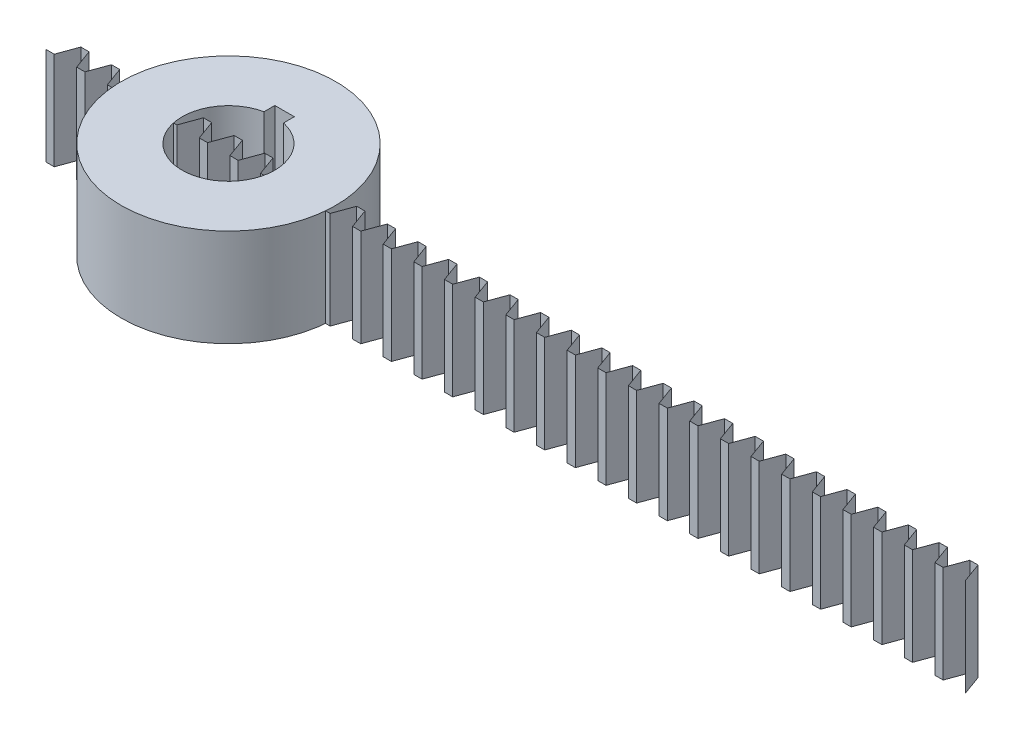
ISO-10303-21;
HEADER;
FILE_DESCRIPTION(('STEP AP214'),'2;1');
FILE_NAME('part.step','',(''),(''),'','','');
FILE_SCHEMA(('AUTOMOTIVE_DESIGN { 1 0 10303 214 1 1 1 1 }'));
ENDSEC;
DATA;
#1=APPLICATION_CONTEXT('core data for automotive mechanical design processes');
#2=APPLICATION_PROTOCOL_DEFINITION('international standard','automotive_design',2000,#1);
#3=PRODUCT_CONTEXT('',#1,'mechanical');
#4=PRODUCT('Part','Part','',(#3));
#5=PRODUCT_RELATED_PRODUCT_CATEGORY('part','',(#4));
#6=PRODUCT_DEFINITION_FORMATION('','',#4);
#7=PRODUCT_DEFINITION_CONTEXT('part definition',#1,'design');
#8=PRODUCT_DEFINITION('design','',#6,#7);
#9=PRODUCT_DEFINITION_SHAPE('','',#8);
#10=(LENGTH_UNIT() NAMED_UNIT(*) SI_UNIT(.MILLI.,.METRE.));
#11=(NAMED_UNIT(*) PLANE_ANGLE_UNIT() SI_UNIT($,.RADIAN.));
#12=(NAMED_UNIT(*) SI_UNIT($,.STERADIAN.) SOLID_ANGLE_UNIT());
#13=UNCERTAINTY_MEASURE_WITH_UNIT(LENGTH_MEASURE(1.E-05),#10,'distance_accuracy_value','');
#14=(GEOMETRIC_REPRESENTATION_CONTEXT(3) GLOBAL_UNCERTAINTY_ASSIGNED_CONTEXT((#13)) GLOBAL_UNIT_ASSIGNED_CONTEXT((#10,
#11,#12)) REPRESENTATION_CONTEXT('',''));
#15=CARTESIAN_POINT('',(0.,0.,0.));
#16=DIRECTION('',(0.,0.,1.));
#17=DIRECTION('',(1.,0.,0.));
#18=AXIS2_PLACEMENT_3D('',#15,#16,#17);
#19=CARTESIAN_POINT('',(-35.4003750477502,0.,2.));
#20=DIRECTION('',(0.,0.,1.));
#21=DIRECTION('',(1.,0.,0.));
#22=AXIS2_PLACEMENT_3D('',#19,#20,#21);
#23=PLANE('',#22);
#24=DIRECTION('',(1.,0.,0.));
#25=VECTOR('',#24,1.);
#26=CARTESIAN_POINT('',(-35.4003750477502,20.,2.));
#27=LINE('',#26,#25);
#28=CARTESIAN_POINT('',(-35.4003750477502,20.,2.));
#29=VERTEX_POINT('',#28);
#30=CARTESIAN_POINT('',(-33.7146633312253,20.,2.));
#31=VERTEX_POINT('',#30);
#32=EDGE_CURVE('E827',#29,#31,#27,.T.);
#33=ORIENTED_EDGE('',*,*,#32,.F.);
#34=DIRECTION('',(0.,1.,0.));
#35=VECTOR('',#34,1.);
#36=CARTESIAN_POINT('',(-35.4003750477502,0.,2.));
#37=LINE('',#36,#35);
#38=CARTESIAN_POINT('',(-35.4003750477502,0.,2.));
#39=VERTEX_POINT('',#38);
#40=EDGE_CURVE('E49',#39,#29,#37,.T.);
#41=ORIENTED_EDGE('',*,*,#40,.F.);
#42=DIRECTION('',(1.,0.,0.));
#43=VECTOR('',#42,1.);
#44=CARTESIAN_POINT('',(-35.4003750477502,0.,2.));
#45=LINE('',#44,#43);
#46=CARTESIAN_POINT('',(-33.7146633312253,0.,2.));
#47=VERTEX_POINT('',#46);
#48=EDGE_CURVE('E12',#39,#47,#45,.T.);
#49=ORIENTED_EDGE('',*,*,#48,.T.);
#50=DIRECTION('',(0.,1.,0.));
#51=VECTOR('',#50,1.);
#52=CARTESIAN_POINT('',(-33.7146633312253,0.,2.));
#53=LINE('',#52,#51);
#54=EDGE_CURVE('E836',#47,#31,#53,.T.);
#55=ORIENTED_EDGE('',*,*,#54,.T.);
#56=EDGE_LOOP('',(#33,#41,#49,#55));
#57=FACE_BOUND('',#56,.T.);
#58=ADVANCED_FACE('F47',(#57),#23,.T.);
#59=CARTESIAN_POINT('',(-33.7146633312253,0.,2.));
#60=DIRECTION('',(0.939692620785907,0.,0.342020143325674));
#61=DIRECTION('',(0.342020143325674,0.,-0.939692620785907));
#62=AXIS2_PLACEMENT_3D('',#59,#60,#61);
#63=PLANE('',#62);
#64=DIRECTION('',(0.342020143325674,0.,-0.939692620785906));
#65=VECTOR('',#64,1.);
#66=CARTESIAN_POINT('',(-33.7146633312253,20.,2.));
#67=LINE('',#66,#65);
#68=CARTESIAN_POINT('',(-32.2587823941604,20.,-2.));
#69=VERTEX_POINT('',#68);
#70=EDGE_CURVE('E832',#31,#69,#67,.T.);
#71=ORIENTED_EDGE('',*,*,#70,.F.);
#72=ORIENTED_EDGE('',*,*,#54,.F.);
#73=DIRECTION('',(0.342020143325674,0.,-0.939692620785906));
#74=VECTOR('',#73,1.);
#75=CARTESIAN_POINT('',(-33.7146633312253,0.,2.));
#76=LINE('',#75,#74);
#77=CARTESIAN_POINT('',(-32.2587823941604,0.,-2.));
#78=VERTEX_POINT('',#77);
#79=EDGE_CURVE('E831',#47,#78,#76,.T.);
#80=ORIENTED_EDGE('',*,*,#79,.T.);
#81=DIRECTION('',(0.,1.,0.));
#82=VECTOR('',#81,1.);
#83=CARTESIAN_POINT('',(-32.2587823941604,0.,-2.));
#84=LINE('',#83,#82);
#85=EDGE_CURVE('E842',#78,#69,#84,.T.);
#86=ORIENTED_EDGE('',*,*,#85,.T.);
#87=EDGE_LOOP('',(#71,#72,#80,#86));
#88=FACE_BOUND('',#87,.T.);
#89=ADVANCED_FACE('F2452',(#88),#63,.T.);
#90=CARTESIAN_POINT('',(-32.2587823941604,0.,-2.));
#91=DIRECTION('',(0.,0.,1.));
#92=DIRECTION('',(1.,0.,0.));
#93=AXIS2_PLACEMENT_3D('',#90,#91,#92);
#94=PLANE('',#93);
#95=DIRECTION('',(1.,0.,0.));
#96=VECTOR('',#95,1.);
#97=CARTESIAN_POINT('',(-32.2587823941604,20.,-2.));
#98=LINE('',#97,#96);
#99=CARTESIAN_POINT('',(-30.5730706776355,20.,-2.));
#100=VERTEX_POINT('',#99);
#101=EDGE_CURVE('E838',#69,#100,#98,.T.);
#102=ORIENTED_EDGE('',*,*,#101,.F.);
#103=ORIENTED_EDGE('',*,*,#85,.F.);
#104=DIRECTION('',(1.,0.,0.));
#105=VECTOR('',#104,1.);
#106=CARTESIAN_POINT('',(-32.2587823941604,0.,-2.));
#107=LINE('',#106,#105);
#108=CARTESIAN_POINT('',(-30.5730706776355,0.,-2.));
#109=VERTEX_POINT('',#108);
#110=EDGE_CURVE('E837',#78,#109,#107,.T.);
#111=ORIENTED_EDGE('',*,*,#110,.T.);
#112=DIRECTION('',(0.,1.,0.));
#113=VECTOR('',#112,1.);
#114=CARTESIAN_POINT('',(-30.5730706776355,0.,-2.));
#115=LINE('',#114,#113);
#116=EDGE_CURVE('E848',#109,#100,#115,.T.);
#117=ORIENTED_EDGE('',*,*,#116,.T.);
#118=EDGE_LOOP('',(#102,#103,#111,#117));
#119=FACE_BOUND('',#118,.T.);
#120=ADVANCED_FACE('F2451',(#119),#94,.T.);
#121=CARTESIAN_POINT('',(-30.5730706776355,0.,-2.));
#122=DIRECTION('',(-0.939692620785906,0.,0.342020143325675));
#123=DIRECTION('',(0.342020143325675,0.,0.939692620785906));
#124=AXIS2_PLACEMENT_3D('',#121,#122,#123);
#125=PLANE('',#124);
#126=DIRECTION('',(0.342020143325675,0.,0.939692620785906));
#127=VECTOR('',#126,1.);
#128=CARTESIAN_POINT('',(-30.5730706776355,20.,-2.));
#129=LINE('',#128,#127);
#130=CARTESIAN_POINT('',(-29.1171897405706,20.,2.));
#131=VERTEX_POINT('',#130);
#132=EDGE_CURVE('E844',#100,#131,#129,.T.);
#133=ORIENTED_EDGE('',*,*,#132,.F.);
#134=ORIENTED_EDGE('',*,*,#116,.F.);
#135=DIRECTION('',(0.342020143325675,0.,0.939692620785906));
#136=VECTOR('',#135,1.);
#137=CARTESIAN_POINT('',(-30.5730706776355,0.,-2.));
#138=LINE('',#137,#136);
#139=CARTESIAN_POINT('',(-29.1171897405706,0.,2.));
#140=VERTEX_POINT('',#139);
#141=EDGE_CURVE('E843',#109,#140,#138,.T.);
#142=ORIENTED_EDGE('',*,*,#141,.T.);
#143=DIRECTION('',(0.,1.,0.));
#144=VECTOR('',#143,1.);
#145=CARTESIAN_POINT('',(-29.1171897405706,0.,2.));
#146=LINE('',#145,#144);
#147=EDGE_CURVE('E854',#140,#131,#146,.T.);
#148=ORIENTED_EDGE('',*,*,#147,.T.);
#149=EDGE_LOOP('',(#133,#134,#142,#148));
#150=FACE_BOUND('',#149,.T.);
#151=ADVANCED_FACE('F2447',(#150),#125,.T.);
#152=CARTESIAN_POINT('',(-29.1171897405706,0.,2.));
#153=DIRECTION('',(0.,0.,1.));
#154=DIRECTION('',(1.,0.,0.));
#155=AXIS2_PLACEMENT_3D('',#152,#153,#154);
#156=PLANE('',#155);
#157=DIRECTION('',(1.,0.,0.));
#158=VECTOR('',#157,1.);
#159=CARTESIAN_POINT('',(-29.1171897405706,20.,2.));
#160=LINE('',#159,#158);
#161=CARTESIAN_POINT('',(-27.4314780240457,20.,2.));
#162=VERTEX_POINT('',#161);
#163=EDGE_CURVE('E850',#131,#162,#160,.T.);
#164=ORIENTED_EDGE('',*,*,#163,.F.);
#165=ORIENTED_EDGE('',*,*,#147,.F.);
#166=DIRECTION('',(1.,0.,0.));
#167=VECTOR('',#166,1.);
#168=CARTESIAN_POINT('',(-29.1171897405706,0.,2.));
#169=LINE('',#168,#167);
#170=CARTESIAN_POINT('',(-27.4314780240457,0.,2.));
#171=VERTEX_POINT('',#170);
#172=EDGE_CURVE('E849',#140,#171,#169,.T.);
#173=ORIENTED_EDGE('',*,*,#172,.T.);
#174=DIRECTION('',(0.,1.,0.));
#175=VECTOR('',#174,1.);
#176=CARTESIAN_POINT('',(-27.4314780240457,0.,2.));
#177=LINE('',#176,#175);
#178=EDGE_CURVE('E860',#171,#162,#177,.T.);
#179=ORIENTED_EDGE('',*,*,#178,.T.);
#180=EDGE_LOOP('',(#164,#165,#173,#179));
#181=FACE_BOUND('',#180,.T.);
#182=ADVANCED_FACE('F2443',(#181),#156,.T.);
#183=CARTESIAN_POINT('',(-27.4314780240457,0.,2.));
#184=DIRECTION('',(0.939692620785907,0.,0.342020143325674));
#185=DIRECTION('',(0.342020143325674,0.,-0.939692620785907));
#186=AXIS2_PLACEMENT_3D('',#183,#184,#185);
#187=PLANE('',#186);
#188=DIRECTION('',(0.342020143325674,0.,-0.939692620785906));
#189=VECTOR('',#188,1.);
#190=CARTESIAN_POINT('',(-27.4314780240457,20.,2.));
#191=LINE('',#190,#189);
#192=CARTESIAN_POINT('',(-25.9755970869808,20.,-2.));
#193=VERTEX_POINT('',#192);
#194=EDGE_CURVE('E856',#162,#193,#191,.T.);
#195=ORIENTED_EDGE('',*,*,#194,.F.);
#196=ORIENTED_EDGE('',*,*,#178,.F.);
#197=DIRECTION('',(0.342020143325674,0.,-0.939692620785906));
#198=VECTOR('',#197,1.);
#199=CARTESIAN_POINT('',(-27.4314780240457,0.,2.));
#200=LINE('',#199,#198);
#201=CARTESIAN_POINT('',(-25.9755970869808,0.,-2.));
#202=VERTEX_POINT('',#201);
#203=EDGE_CURVE('E855',#171,#202,#200,.T.);
#204=ORIENTED_EDGE('',*,*,#203,.T.);
#205=DIRECTION('',(0.,1.,0.));
#206=VECTOR('',#205,1.);
#207=CARTESIAN_POINT('',(-25.9755970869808,0.,-2.));
#208=LINE('',#207,#206);
#209=EDGE_CURVE('E866',#202,#193,#208,.T.);
#210=ORIENTED_EDGE('',*,*,#209,.T.);
#211=EDGE_LOOP('',(#195,#196,#204,#210));
#212=FACE_BOUND('',#211,.T.);
#213=ADVANCED_FACE('F2439',(#212),#187,.T.);
#214=CARTESIAN_POINT('',(-25.9755970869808,0.,-2.));
#215=DIRECTION('',(0.,0.,1.));
#216=DIRECTION('',(1.,0.,0.));
#217=AXIS2_PLACEMENT_3D('',#214,#215,#216);
#218=PLANE('',#217);
#219=DIRECTION('',(1.,0.,0.));
#220=VECTOR('',#219,1.);
#221=CARTESIAN_POINT('',(-25.9755970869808,20.,-2.));
#222=LINE('',#221,#220);
#223=CARTESIAN_POINT('',(-24.2898853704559,20.,-2.));
#224=VERTEX_POINT('',#223);
#225=EDGE_CURVE('E862',#193,#224,#222,.T.);
#226=ORIENTED_EDGE('',*,*,#225,.F.);
#227=ORIENTED_EDGE('',*,*,#209,.F.);
#228=DIRECTION('',(1.,0.,0.));
#229=VECTOR('',#228,1.);
#230=CARTESIAN_POINT('',(-25.9755970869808,0.,-2.));
#231=LINE('',#230,#229);
#232=CARTESIAN_POINT('',(-24.2898853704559,0.,-2.));
#233=VERTEX_POINT('',#232);
#234=EDGE_CURVE('E861',#202,#233,#231,.T.);
#235=ORIENTED_EDGE('',*,*,#234,.T.);
#236=DIRECTION('',(0.,1.,0.));
#237=VECTOR('',#236,1.);
#238=CARTESIAN_POINT('',(-24.2898853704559,0.,-2.));
#239=LINE('',#238,#237);
#240=EDGE_CURVE('E872',#233,#224,#239,.T.);
#241=ORIENTED_EDGE('',*,*,#240,.T.);
#242=EDGE_LOOP('',(#226,#227,#235,#241));
#243=FACE_BOUND('',#242,.T.);
#244=ADVANCED_FACE('F2435',(#243),#218,.T.);
#245=CARTESIAN_POINT('',(-24.2898853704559,0.,-2.));
#246=DIRECTION('',(-0.939692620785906,0.,0.342020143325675));
#247=DIRECTION('',(0.342020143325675,0.,0.939692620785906));
#248=AXIS2_PLACEMENT_3D('',#245,#246,#247);
#249=PLANE('',#248);
#250=DIRECTION('',(0.342020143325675,0.,0.939692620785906));
#251=VECTOR('',#250,1.);
#252=CARTESIAN_POINT('',(-24.2898853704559,20.,-2.));
#253=LINE('',#252,#251);
#254=CARTESIAN_POINT('',(-22.834004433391,20.,2.));
#255=VERTEX_POINT('',#254);
#256=EDGE_CURVE('E868',#224,#255,#253,.T.);
#257=ORIENTED_EDGE('',*,*,#256,.F.);
#258=ORIENTED_EDGE('',*,*,#240,.F.);
#259=DIRECTION('',(0.342020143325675,0.,0.939692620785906));
#260=VECTOR('',#259,1.);
#261=CARTESIAN_POINT('',(-24.2898853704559,0.,-2.));
#262=LINE('',#261,#260);
#263=CARTESIAN_POINT('',(-22.834004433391,0.,2.));
#264=VERTEX_POINT('',#263);
#265=EDGE_CURVE('E867',#233,#264,#262,.T.);
#266=ORIENTED_EDGE('',*,*,#265,.T.);
#267=DIRECTION('',(0.,1.,0.));
#268=VECTOR('',#267,1.);
#269=CARTESIAN_POINT('',(-22.834004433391,0.,2.));
#270=LINE('',#269,#268);
#271=EDGE_CURVE('E878',#264,#255,#270,.T.);
#272=ORIENTED_EDGE('',*,*,#271,.T.);
#273=EDGE_LOOP('',(#257,#258,#266,#272));
#274=FACE_BOUND('',#273,.T.);
#275=ADVANCED_FACE('F2431',(#274),#249,.T.);
#276=CARTESIAN_POINT('',(-22.834004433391,0.,2.));
#277=DIRECTION('',(0.,0.,1.));
#278=DIRECTION('',(1.,0.,0.));
#279=AXIS2_PLACEMENT_3D('',#276,#277,#278);
#280=PLANE('',#279);
#281=DIRECTION('',(1.,0.,0.));
#282=VECTOR('',#281,1.);
#283=CARTESIAN_POINT('',(-22.834004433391,20.,2.));
#284=LINE('',#283,#282);
#285=CARTESIAN_POINT('',(-21.1482927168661,20.,2.));
#286=VERTEX_POINT('',#285);
#287=EDGE_CURVE('E874',#255,#286,#284,.T.);
#288=ORIENTED_EDGE('',*,*,#287,.F.);
#289=ORIENTED_EDGE('',*,*,#271,.F.);
#290=DIRECTION('',(1.,0.,0.));
#291=VECTOR('',#290,1.);
#292=CARTESIAN_POINT('',(-22.834004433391,0.,2.));
#293=LINE('',#292,#291);
#294=CARTESIAN_POINT('',(-21.1482927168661,0.,2.));
#295=VERTEX_POINT('',#294);
#296=EDGE_CURVE('E873',#264,#295,#293,.T.);
#297=ORIENTED_EDGE('',*,*,#296,.T.);
#298=DIRECTION('',(0.,1.,0.));
#299=VECTOR('',#298,1.);
#300=CARTESIAN_POINT('',(-21.1482927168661,0.,2.));
#301=LINE('',#300,#299);
#302=EDGE_CURVE('E884',#295,#286,#301,.T.);
#303=ORIENTED_EDGE('',*,*,#302,.T.);
#304=EDGE_LOOP('',(#288,#289,#297,#303));
#305=FACE_BOUND('',#304,.T.);
#306=ADVANCED_FACE('F2427',(#305),#280,.T.);
#307=CARTESIAN_POINT('',(-21.1482927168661,0.,2.));
#308=DIRECTION('',(0.939692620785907,0.,0.342020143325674));
#309=DIRECTION('',(0.342020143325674,0.,-0.939692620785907));
#310=AXIS2_PLACEMENT_3D('',#307,#308,#309);
#311=PLANE('',#310);
#312=DIRECTION('',(0.342020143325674,0.,-0.939692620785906));
#313=VECTOR('',#312,1.);
#314=CARTESIAN_POINT('',(-21.1482927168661,20.,2.));
#315=LINE('',#314,#313);
#316=CARTESIAN_POINT('',(-19.6924117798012,20.,-2.));
#317=VERTEX_POINT('',#316);
#318=EDGE_CURVE('E880',#286,#317,#315,.T.);
#319=ORIENTED_EDGE('',*,*,#318,.F.);
#320=ORIENTED_EDGE('',*,*,#302,.F.);
#321=DIRECTION('',(0.342020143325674,0.,-0.939692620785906));
#322=VECTOR('',#321,1.);
#323=CARTESIAN_POINT('',(-21.1482927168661,0.,2.));
#324=LINE('',#323,#322);
#325=CARTESIAN_POINT('',(-19.6924117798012,0.,-2.));
#326=VERTEX_POINT('',#325);
#327=EDGE_CURVE('E879',#295,#326,#324,.T.);
#328=ORIENTED_EDGE('',*,*,#327,.T.);
#329=DIRECTION('',(0.,1.,0.));
#330=VECTOR('',#329,1.);
#331=CARTESIAN_POINT('',(-19.6924117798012,0.,-2.));
#332=LINE('',#331,#330);
#333=EDGE_CURVE('E890',#326,#317,#332,.T.);
#334=ORIENTED_EDGE('',*,*,#333,.T.);
#335=EDGE_LOOP('',(#319,#320,#328,#334));
#336=FACE_BOUND('',#335,.T.);
#337=ADVANCED_FACE('F2423',(#336),#311,.T.);
#338=CARTESIAN_POINT('',(-19.6924117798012,0.,-2.));
#339=DIRECTION('',(0.,0.,1.));
#340=DIRECTION('',(1.,0.,0.));
#341=AXIS2_PLACEMENT_3D('',#338,#339,#340);
#342=PLANE('',#341);
#343=DIRECTION('',(1.,0.,0.));
#344=VECTOR('',#343,1.);
#345=CARTESIAN_POINT('',(-19.6924117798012,20.,-2.));
#346=LINE('',#345,#344);
#347=CARTESIAN_POINT('',(-18.0067000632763,20.,-2.));
#348=VERTEX_POINT('',#347);
#349=EDGE_CURVE('E886',#317,#348,#346,.T.);
#350=ORIENTED_EDGE('',*,*,#349,.F.);
#351=ORIENTED_EDGE('',*,*,#333,.F.);
#352=DIRECTION('',(1.,0.,0.));
#353=VECTOR('',#352,1.);
#354=CARTESIAN_POINT('',(-19.6924117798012,0.,-2.));
#355=LINE('',#354,#353);
#356=CARTESIAN_POINT('',(-18.0067000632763,0.,-2.));
#357=VERTEX_POINT('',#356);
#358=EDGE_CURVE('E885',#326,#357,#355,.T.);
#359=ORIENTED_EDGE('',*,*,#358,.T.);
#360=DIRECTION('',(0.,1.,0.));
#361=VECTOR('',#360,1.);
#362=CARTESIAN_POINT('',(-18.0067000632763,0.,-2.));
#363=LINE('',#362,#361);
#364=EDGE_CURVE('E896',#357,#348,#363,.T.);
#365=ORIENTED_EDGE('',*,*,#364,.T.);
#366=EDGE_LOOP('',(#350,#351,#359,#365));
#367=FACE_BOUND('',#366,.T.);
#368=ADVANCED_FACE('F2419',(#367),#342,.T.);
#369=CARTESIAN_POINT('',(-18.0067000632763,0.,-2.));
#370=DIRECTION('',(-0.939692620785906,0.,0.342020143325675));
#371=DIRECTION('',(0.342020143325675,0.,0.939692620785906));
#372=AXIS2_PLACEMENT_3D('',#369,#370,#371);
#373=PLANE('',#372);
#374=DIRECTION('',(0.342020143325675,0.,0.939692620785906));
#375=VECTOR('',#374,1.);
#376=CARTESIAN_POINT('',(-18.0067000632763,20.,-2.));
#377=LINE('',#376,#375);
#378=CARTESIAN_POINT('',(-16.5508191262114,20.,2.));
#379=VERTEX_POINT('',#378);
#380=EDGE_CURVE('E892',#348,#379,#377,.T.);
#381=ORIENTED_EDGE('',*,*,#380,.F.);
#382=ORIENTED_EDGE('',*,*,#364,.F.);
#383=DIRECTION('',(0.342020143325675,0.,0.939692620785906));
#384=VECTOR('',#383,1.);
#385=CARTESIAN_POINT('',(-18.0067000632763,0.,-2.));
#386=LINE('',#385,#384);
#387=CARTESIAN_POINT('',(-16.5508191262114,0.,2.));
#388=VERTEX_POINT('',#387);
#389=EDGE_CURVE('E891',#357,#388,#386,.T.);
#390=ORIENTED_EDGE('',*,*,#389,.T.);
#391=DIRECTION('',(0.,1.,0.));
#392=VECTOR('',#391,1.);
#393=CARTESIAN_POINT('',(-16.5508191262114,0.,2.));
#394=LINE('',#393,#392);
#395=EDGE_CURVE('E902',#388,#379,#394,.T.);
#396=ORIENTED_EDGE('',*,*,#395,.T.);
#397=EDGE_LOOP('',(#381,#382,#390,#396));
#398=FACE_BOUND('',#397,.T.);
#399=ADVANCED_FACE('F2415',(#398),#373,.T.);
#400=CARTESIAN_POINT('',(-16.5508191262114,0.,2.));
#401=DIRECTION('',(0.,0.,1.));
#402=DIRECTION('',(1.,0.,0.));
#403=AXIS2_PLACEMENT_3D('',#400,#401,#402);
#404=PLANE('',#403);
#405=DIRECTION('',(1.,0.,0.));
#406=VECTOR('',#405,1.);
#407=CARTESIAN_POINT('',(-16.5508191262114,20.,2.));
#408=LINE('',#407,#406);
#409=CARTESIAN_POINT('',(-14.8651074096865,20.,2.));
#410=VERTEX_POINT('',#409);
#411=EDGE_CURVE('E898',#379,#410,#408,.T.);
#412=ORIENTED_EDGE('',*,*,#411,.F.);
#413=ORIENTED_EDGE('',*,*,#395,.F.);
#414=DIRECTION('',(1.,0.,0.));
#415=VECTOR('',#414,1.);
#416=CARTESIAN_POINT('',(-16.5508191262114,0.,2.));
#417=LINE('',#416,#415);
#418=CARTESIAN_POINT('',(-14.8651074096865,0.,2.));
#419=VERTEX_POINT('',#418);
#420=EDGE_CURVE('E897',#388,#419,#417,.T.);
#421=ORIENTED_EDGE('',*,*,#420,.T.);
#422=DIRECTION('',(0.,1.,0.));
#423=VECTOR('',#422,1.);
#424=CARTESIAN_POINT('',(-14.8651074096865,0.,2.));
#425=LINE('',#424,#423);
#426=EDGE_CURVE('E908',#419,#410,#425,.T.);
#427=ORIENTED_EDGE('',*,*,#426,.T.);
#428=EDGE_LOOP('',(#412,#413,#421,#427));
#429=FACE_BOUND('',#428,.T.);
#430=ADVANCED_FACE('F2411',(#429),#404,.T.);
#431=CARTESIAN_POINT('',(-14.8651074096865,0.,2.));
#432=DIRECTION('',(0.939692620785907,0.,0.342020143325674));
#433=DIRECTION('',(0.342020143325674,0.,-0.939692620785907));
#434=AXIS2_PLACEMENT_3D('',#431,#432,#433);
#435=PLANE('',#434);
#436=DIRECTION('',(0.342020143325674,0.,-0.939692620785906));
#437=VECTOR('',#436,1.);
#438=CARTESIAN_POINT('',(-14.8651074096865,20.,2.));
#439=LINE('',#438,#437);
#440=CARTESIAN_POINT('',(-13.4092264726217,20.,-2.));
#441=VERTEX_POINT('',#440);
#442=EDGE_CURVE('E904',#410,#441,#439,.T.);
#443=ORIENTED_EDGE('',*,*,#442,.F.);
#444=ORIENTED_EDGE('',*,*,#426,.F.);
#445=DIRECTION('',(0.342020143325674,0.,-0.939692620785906));
#446=VECTOR('',#445,1.);
#447=CARTESIAN_POINT('',(-14.8651074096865,0.,2.));
#448=LINE('',#447,#446);
#449=CARTESIAN_POINT('',(-13.4092264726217,0.,-2.));
#450=VERTEX_POINT('',#449);
#451=EDGE_CURVE('E903',#419,#450,#448,.T.);
#452=ORIENTED_EDGE('',*,*,#451,.T.);
#453=DIRECTION('',(0.,1.,0.));
#454=VECTOR('',#453,1.);
#455=CARTESIAN_POINT('',(-13.4092264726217,0.,-2.));
#456=LINE('',#455,#454);
#457=EDGE_CURVE('E914',#450,#441,#456,.T.);
#458=ORIENTED_EDGE('',*,*,#457,.T.);
#459=EDGE_LOOP('',(#443,#444,#452,#458));
#460=FACE_BOUND('',#459,.T.);
#461=ADVANCED_FACE('F2407',(#460),#435,.T.);
#462=CARTESIAN_POINT('',(-13.4092264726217,0.,-2.));
#463=DIRECTION('',(0.,0.,1.));
#464=DIRECTION('',(1.,0.,0.));
#465=AXIS2_PLACEMENT_3D('',#462,#463,#464);
#466=PLANE('',#465);
#467=DIRECTION('',(1.,0.,0.));
#468=VECTOR('',#467,1.);
#469=CARTESIAN_POINT('',(-13.4092264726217,20.,-2.));
#470=LINE('',#469,#468);
#471=CARTESIAN_POINT('',(-11.7235147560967,20.,-2.));
#472=VERTEX_POINT('',#471);
#473=EDGE_CURVE('E910',#441,#472,#470,.T.);
#474=ORIENTED_EDGE('',*,*,#473,.F.);
#475=ORIENTED_EDGE('',*,*,#457,.F.);
#476=DIRECTION('',(1.,0.,0.));
#477=VECTOR('',#476,1.);
#478=CARTESIAN_POINT('',(-13.4092264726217,0.,-2.));
#479=LINE('',#478,#477);
#480=CARTESIAN_POINT('',(-11.7235147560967,0.,-2.));
#481=VERTEX_POINT('',#480);
#482=EDGE_CURVE('E909',#450,#481,#479,.T.);
#483=ORIENTED_EDGE('',*,*,#482,.T.);
#484=DIRECTION('',(0.,1.,0.));
#485=VECTOR('',#484,1.);
#486=CARTESIAN_POINT('',(-11.7235147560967,0.,-2.));
#487=LINE('',#486,#485);
#488=EDGE_CURVE('E920',#481,#472,#487,.T.);
#489=ORIENTED_EDGE('',*,*,#488,.T.);
#490=EDGE_LOOP('',(#474,#475,#483,#489));
#491=FACE_BOUND('',#490,.T.);
#492=ADVANCED_FACE('F2403',(#491),#466,.T.);
#493=CARTESIAN_POINT('',(-11.7235147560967,0.,-2.));
#494=DIRECTION('',(-0.939692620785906,0.,0.342020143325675));
#495=DIRECTION('',(0.342020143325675,0.,0.939692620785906));
#496=AXIS2_PLACEMENT_3D('',#493,#494,#495);
#497=PLANE('',#496);
#498=DIRECTION('',(0.342020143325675,0.,0.939692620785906));
#499=VECTOR('',#498,1.);
#500=CARTESIAN_POINT('',(-11.7235147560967,20.,-2.));
#501=LINE('',#500,#499);
#502=CARTESIAN_POINT('',(-10.2676338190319,20.,2.));
#503=VERTEX_POINT('',#502);
#504=EDGE_CURVE('E916',#472,#503,#501,.T.);
#505=ORIENTED_EDGE('',*,*,#504,.F.);
#506=ORIENTED_EDGE('',*,*,#488,.F.);
#507=DIRECTION('',(0.342020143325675,0.,0.939692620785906));
#508=VECTOR('',#507,1.);
#509=CARTESIAN_POINT('',(-11.7235147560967,0.,-2.));
#510=LINE('',#509,#508);
#511=CARTESIAN_POINT('',(-10.2676338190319,0.,2.));
#512=VERTEX_POINT('',#511);
#513=EDGE_CURVE('E915',#481,#512,#510,.T.);
#514=ORIENTED_EDGE('',*,*,#513,.T.);
#515=DIRECTION('',(0.,1.,0.));
#516=VECTOR('',#515,1.);
#517=CARTESIAN_POINT('',(-10.2676338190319,0.,2.));
#518=LINE('',#517,#516);
#519=EDGE_CURVE('E926',#512,#503,#518,.T.);
#520=ORIENTED_EDGE('',*,*,#519,.T.);
#521=EDGE_LOOP('',(#505,#506,#514,#520));
#522=FACE_BOUND('',#521,.T.);
#523=ADVANCED_FACE('F2399',(#522),#497,.T.);
#524=CARTESIAN_POINT('',(-10.2676338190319,0.,2.));
#525=DIRECTION('',(0.,0.,1.));
#526=DIRECTION('',(1.,0.,0.));
#527=AXIS2_PLACEMENT_3D('',#524,#525,#526);
#528=PLANE('',#527);
#529=DIRECTION('',(1.,0.,0.));
#530=VECTOR('',#529,1.);
#531=CARTESIAN_POINT('',(-10.2676338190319,20.,2.));
#532=LINE('',#531,#530);
#533=CARTESIAN_POINT('',(-8.5819221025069,20.,2.));
#534=VERTEX_POINT('',#533);
#535=EDGE_CURVE('E922',#503,#534,#532,.T.);
#536=ORIENTED_EDGE('',*,*,#535,.F.);
#537=ORIENTED_EDGE('',*,*,#519,.F.);
#538=DIRECTION('',(1.,0.,0.));
#539=VECTOR('',#538,1.);
#540=CARTESIAN_POINT('',(-10.2676338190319,0.,2.));
#541=LINE('',#540,#539);
#542=CARTESIAN_POINT('',(-8.5819221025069,0.,2.));
#543=VERTEX_POINT('',#542);
#544=EDGE_CURVE('E921',#512,#543,#541,.T.);
#545=ORIENTED_EDGE('',*,*,#544,.T.);
#546=DIRECTION('',(0.,1.,0.));
#547=VECTOR('',#546,1.);
#548=CARTESIAN_POINT('',(-8.5819221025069,0.,2.));
#549=LINE('',#548,#547);
#550=EDGE_CURVE('E932',#543,#534,#549,.T.);
#551=ORIENTED_EDGE('',*,*,#550,.T.);
#552=EDGE_LOOP('',(#536,#537,#545,#551));
#553=FACE_BOUND('',#552,.T.);
#554=ADVANCED_FACE('F2395',(#553),#528,.T.);
#555=CARTESIAN_POINT('',(-8.5819221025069,0.,2.));
#556=DIRECTION('',(0.939692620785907,0.,0.342020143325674));
#557=DIRECTION('',(0.342020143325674,0.,-0.939692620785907));
#558=AXIS2_PLACEMENT_3D('',#555,#556,#557);
#559=PLANE('',#558);
#560=DIRECTION('',(0.342020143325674,0.,-0.939692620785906));
#561=VECTOR('',#560,1.);
#562=CARTESIAN_POINT('',(-8.5819221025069,20.,2.));
#563=LINE('',#562,#561);
#564=CARTESIAN_POINT('',(-7.12604116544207,20.,-2.));
#565=VERTEX_POINT('',#564);
#566=EDGE_CURVE('E928',#534,#565,#563,.T.);
#567=ORIENTED_EDGE('',*,*,#566,.F.);
#568=ORIENTED_EDGE('',*,*,#550,.F.);
#569=DIRECTION('',(0.342020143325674,0.,-0.939692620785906));
#570=VECTOR('',#569,1.);
#571=CARTESIAN_POINT('',(-8.5819221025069,0.,2.));
#572=LINE('',#571,#570);
#573=CARTESIAN_POINT('',(-7.12604116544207,0.,-2.));
#574=VERTEX_POINT('',#573);
#575=EDGE_CURVE('E927',#543,#574,#572,.T.);
#576=ORIENTED_EDGE('',*,*,#575,.T.);
#577=DIRECTION('',(0.,1.,0.));
#578=VECTOR('',#577,1.);
#579=CARTESIAN_POINT('',(-7.12604116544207,0.,-2.));
#580=LINE('',#579,#578);
#581=EDGE_CURVE('E938',#574,#565,#580,.T.);
#582=ORIENTED_EDGE('',*,*,#581,.T.);
#583=EDGE_LOOP('',(#567,#568,#576,#582));
#584=FACE_BOUND('',#583,.T.);
#585=ADVANCED_FACE('F2391',(#584),#559,.T.);
#586=CARTESIAN_POINT('',(-7.12604116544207,0.,-2.));
#587=DIRECTION('',(0.,0.,1.));
#588=DIRECTION('',(1.,0.,0.));
#589=AXIS2_PLACEMENT_3D('',#586,#587,#588);
#590=PLANE('',#589);
#591=DIRECTION('',(1.,0.,0.));
#592=VECTOR('',#591,1.);
#593=CARTESIAN_POINT('',(-7.12604116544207,20.,-2.));
#594=LINE('',#593,#592);
#595=CARTESIAN_POINT('',(-5.44032944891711,20.,-2.));
#596=VERTEX_POINT('',#595);
#597=EDGE_CURVE('E934',#565,#596,#594,.T.);
#598=ORIENTED_EDGE('',*,*,#597,.F.);
#599=ORIENTED_EDGE('',*,*,#581,.F.);
#600=DIRECTION('',(1.,0.,0.));
#601=VECTOR('',#600,1.);
#602=CARTESIAN_POINT('',(-7.12604116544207,0.,-2.));
#603=LINE('',#602,#601);
#604=CARTESIAN_POINT('',(-5.44032944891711,0.,-2.));
#605=VERTEX_POINT('',#604);
#606=EDGE_CURVE('E933',#574,#605,#603,.T.);
#607=ORIENTED_EDGE('',*,*,#606,.T.);
#608=DIRECTION('',(0.,1.,0.));
#609=VECTOR('',#608,1.);
#610=CARTESIAN_POINT('',(-5.44032944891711,0.,-2.));
#611=LINE('',#610,#609);
#612=EDGE_CURVE('E944',#605,#596,#611,.T.);
#613=ORIENTED_EDGE('',*,*,#612,.T.);
#614=EDGE_LOOP('',(#598,#599,#607,#613));
#615=FACE_BOUND('',#614,.T.);
#616=ADVANCED_FACE('F2387',(#615),#590,.T.);
#617=CARTESIAN_POINT('',(-5.44032944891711,0.,-2.));
#618=DIRECTION('',(-0.939692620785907,0.,0.342020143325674));
#619=DIRECTION('',(0.342020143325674,0.,0.939692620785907));
#620=AXIS2_PLACEMENT_3D('',#617,#618,#619);
#621=PLANE('',#620);
#622=DIRECTION('',(0.342020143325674,0.,0.939692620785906));
#623=VECTOR('',#622,1.);
#624=CARTESIAN_POINT('',(-5.44032944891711,20.,-2.));
#625=LINE('',#624,#623);
#626=CARTESIAN_POINT('',(-3.98444851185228,20.,2.));
#627=VERTEX_POINT('',#626);
#628=EDGE_CURVE('E940',#596,#627,#625,.T.);
#629=ORIENTED_EDGE('',*,*,#628,.F.);
#630=ORIENTED_EDGE('',*,*,#612,.F.);
#631=DIRECTION('',(0.342020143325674,0.,0.939692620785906));
#632=VECTOR('',#631,1.);
#633=CARTESIAN_POINT('',(-5.44032944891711,0.,-2.));
#634=LINE('',#633,#632);
#635=CARTESIAN_POINT('',(-3.98444851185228,0.,2.));
#636=VERTEX_POINT('',#635);
#637=EDGE_CURVE('E939',#605,#636,#634,.T.);
#638=ORIENTED_EDGE('',*,*,#637,.T.);
#639=DIRECTION('',(0.,1.,0.));
#640=VECTOR('',#639,1.);
#641=CARTESIAN_POINT('',(-3.98444851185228,0.,2.));
#642=LINE('',#641,#640);
#643=EDGE_CURVE('E950',#636,#627,#642,.T.);
#644=ORIENTED_EDGE('',*,*,#643,.T.);
#645=EDGE_LOOP('',(#629,#630,#638,#644));
#646=FACE_BOUND('',#645,.T.);
#647=ADVANCED_FACE('F2383',(#646),#621,.T.);
#648=CARTESIAN_POINT('',(-3.98444851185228,0.,2.));
#649=DIRECTION('',(0.,0.,1.));
#650=DIRECTION('',(1.,0.,0.));
#651=AXIS2_PLACEMENT_3D('',#648,#649,#650);
#652=PLANE('',#651);
#653=DIRECTION('',(1.,0.,0.));
#654=VECTOR('',#653,1.);
#655=CARTESIAN_POINT('',(-3.98444851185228,20.,2.));
#656=LINE('',#655,#654);
#657=CARTESIAN_POINT('',(-2.29873679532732,20.,2.));
#658=VERTEX_POINT('',#657);
#659=EDGE_CURVE('E946',#627,#658,#656,.T.);
#660=ORIENTED_EDGE('',*,*,#659,.F.);
#661=ORIENTED_EDGE('',*,*,#643,.F.);
#662=DIRECTION('',(1.,0.,0.));
#663=VECTOR('',#662,1.);
#664=CARTESIAN_POINT('',(-3.98444851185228,0.,2.));
#665=LINE('',#664,#663);
#666=CARTESIAN_POINT('',(-2.29873679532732,0.,2.));
#667=VERTEX_POINT('',#666);
#668=EDGE_CURVE('E945',#636,#667,#665,.T.);
#669=ORIENTED_EDGE('',*,*,#668,.T.);
#670=DIRECTION('',(0.,1.,0.));
#671=VECTOR('',#670,1.);
#672=CARTESIAN_POINT('',(-2.29873679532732,0.,2.));
#673=LINE('',#672,#671);
#674=EDGE_CURVE('E956',#667,#658,#673,.T.);
#675=ORIENTED_EDGE('',*,*,#674,.T.);
#676=EDGE_LOOP('',(#660,#661,#669,#675));
#677=FACE_BOUND('',#676,.T.);
#678=ADVANCED_FACE('F2379',(#677),#652,.T.);
#679=CARTESIAN_POINT('',(-2.29873679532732,0.,2.));
#680=DIRECTION('',(0.939692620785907,0.,0.342020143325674));
#681=DIRECTION('',(0.342020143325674,0.,-0.939692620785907));
#682=AXIS2_PLACEMENT_3D('',#679,#680,#681);
#683=PLANE('',#682);
#684=DIRECTION('',(0.342020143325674,0.,-0.939692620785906));
#685=VECTOR('',#684,1.);
#686=CARTESIAN_POINT('',(-2.29873679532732,20.,2.));
#687=LINE('',#686,#685);
#688=CARTESIAN_POINT('',(-0.842855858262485,20.,-2.));
#689=VERTEX_POINT('',#688);
#690=EDGE_CURVE('E952',#658,#689,#687,.T.);
#691=ORIENTED_EDGE('',*,*,#690,.F.);
#692=ORIENTED_EDGE('',*,*,#674,.F.);
#693=DIRECTION('',(0.342020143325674,0.,-0.939692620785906));
#694=VECTOR('',#693,1.);
#695=CARTESIAN_POINT('',(-2.29873679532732,0.,2.));
#696=LINE('',#695,#694);
#697=CARTESIAN_POINT('',(-0.842855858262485,0.,-2.));
#698=VERTEX_POINT('',#697);
#699=EDGE_CURVE('E951',#667,#698,#696,.T.);
#700=ORIENTED_EDGE('',*,*,#699,.T.);
#701=DIRECTION('',(0.,1.,0.));
#702=VECTOR('',#701,1.);
#703=CARTESIAN_POINT('',(-0.842855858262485,0.,-2.));
#704=LINE('',#703,#702);
#705=EDGE_CURVE('E962',#698,#689,#704,.T.);
#706=ORIENTED_EDGE('',*,*,#705,.T.);
#707=EDGE_LOOP('',(#691,#692,#700,#706));
#708=FACE_BOUND('',#707,.T.);
#709=ADVANCED_FACE('F2375',(#708),#683,.T.);
#710=CARTESIAN_POINT('',(-0.842855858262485,0.,-2.));
#711=DIRECTION('',(0.,0.,1.));
#712=DIRECTION('',(1.,0.,0.));
#713=AXIS2_PLACEMENT_3D('',#710,#711,#712);
#714=PLANE('',#713);
#715=DIRECTION('',(1.,0.,0.));
#716=VECTOR('',#715,1.);
#717=CARTESIAN_POINT('',(-0.842855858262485,20.,-2.));
#718=LINE('',#717,#716);
#719=CARTESIAN_POINT('',(0.842855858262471,20.,-2.));
#720=VERTEX_POINT('',#719);
#721=EDGE_CURVE('E958',#689,#720,#718,.T.);
#722=ORIENTED_EDGE('',*,*,#721,.F.);
#723=ORIENTED_EDGE('',*,*,#705,.F.);
#724=DIRECTION('',(1.,0.,0.));
#725=VECTOR('',#724,1.);
#726=CARTESIAN_POINT('',(-0.842855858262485,0.,-2.));
#727=LINE('',#726,#725);
#728=CARTESIAN_POINT('',(0.842855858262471,0.,-2.));
#729=VERTEX_POINT('',#728);
#730=EDGE_CURVE('E957',#698,#729,#727,.T.);
#731=ORIENTED_EDGE('',*,*,#730,.T.);
#732=DIRECTION('',(0.,1.,0.));
#733=VECTOR('',#732,1.);
#734=CARTESIAN_POINT('',(0.842855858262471,0.,-2.));
#735=LINE('',#734,#733);
#736=EDGE_CURVE('E968',#729,#720,#735,.T.);
#737=ORIENTED_EDGE('',*,*,#736,.T.);
#738=EDGE_LOOP('',(#722,#723,#731,#737));
#739=FACE_BOUND('',#738,.T.);
#740=ADVANCED_FACE('F2371',(#739),#714,.T.);
#741=CARTESIAN_POINT('',(0.842855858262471,0.,-2.));
#742=DIRECTION('',(-0.939692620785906,0.,0.342020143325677));
#743=DIRECTION('',(0.342020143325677,0.,0.939692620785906));
#744=AXIS2_PLACEMENT_3D('',#741,#742,#743);
#745=PLANE('',#744);
#746=DIRECTION('',(0.342020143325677,0.,0.939692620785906));
#747=VECTOR('',#746,1.);
#748=CARTESIAN_POINT('',(0.842855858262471,20.,-2.));
#749=LINE('',#748,#747);
#750=CARTESIAN_POINT('',(2.29873679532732,20.,2.));
#751=VERTEX_POINT('',#750);
#752=EDGE_CURVE('E964',#720,#751,#749,.T.);
#753=ORIENTED_EDGE('',*,*,#752,.F.);
#754=ORIENTED_EDGE('',*,*,#736,.F.);
#755=DIRECTION('',(0.342020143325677,0.,0.939692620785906));
#756=VECTOR('',#755,1.);
#757=CARTESIAN_POINT('',(0.842855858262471,0.,-2.));
#758=LINE('',#757,#756);
#759=CARTESIAN_POINT('',(2.29873679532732,0.,2.));
#760=VERTEX_POINT('',#759);
#761=EDGE_CURVE('E963',#729,#760,#758,.T.);
#762=ORIENTED_EDGE('',*,*,#761,.T.);
#763=DIRECTION('',(0.,1.,0.));
#764=VECTOR('',#763,1.);
#765=CARTESIAN_POINT('',(2.29873679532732,0.,2.));
#766=LINE('',#765,#764);
#767=EDGE_CURVE('E974',#760,#751,#766,.T.);
#768=ORIENTED_EDGE('',*,*,#767,.T.);
#769=EDGE_LOOP('',(#753,#754,#762,#768));
#770=FACE_BOUND('',#769,.T.);
#771=ADVANCED_FACE('F2367',(#770),#745,.T.);
#772=CARTESIAN_POINT('',(2.29873679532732,0.,2.));
#773=DIRECTION('',(0.,0.,1.));
#774=DIRECTION('',(1.,0.,0.));
#775=AXIS2_PLACEMENT_3D('',#772,#773,#774);
#776=PLANE('',#775);
#777=DIRECTION('',(1.,0.,0.));
#778=VECTOR('',#777,1.);
#779=CARTESIAN_POINT('',(2.29873679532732,20.,2.));
#780=LINE('',#779,#778);
#781=CARTESIAN_POINT('',(3.98444851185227,20.,2.));
#782=VERTEX_POINT('',#781);
#783=EDGE_CURVE('E970',#751,#782,#780,.T.);
#784=ORIENTED_EDGE('',*,*,#783,.F.);
#785=ORIENTED_EDGE('',*,*,#767,.F.);
#786=DIRECTION('',(1.,0.,0.));
#787=VECTOR('',#786,1.);
#788=CARTESIAN_POINT('',(2.29873679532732,0.,2.));
#789=LINE('',#788,#787);
#790=CARTESIAN_POINT('',(3.98444851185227,0.,2.));
#791=VERTEX_POINT('',#790);
#792=EDGE_CURVE('E969',#760,#791,#789,.T.);
#793=ORIENTED_EDGE('',*,*,#792,.T.);
#794=DIRECTION('',(0.,1.,0.));
#795=VECTOR('',#794,1.);
#796=CARTESIAN_POINT('',(3.98444851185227,0.,2.));
#797=LINE('',#796,#795);
#798=EDGE_CURVE('E980',#791,#782,#797,.T.);
#799=ORIENTED_EDGE('',*,*,#798,.T.);
#800=EDGE_LOOP('',(#784,#785,#793,#799));
#801=FACE_BOUND('',#800,.T.);
#802=ADVANCED_FACE('F2363',(#801),#776,.T.);
#803=CARTESIAN_POINT('',(3.98444851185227,0.,2.));
#804=DIRECTION('',(0.939692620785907,0.,0.342020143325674));
#805=DIRECTION('',(0.342020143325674,0.,-0.939692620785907));
#806=AXIS2_PLACEMENT_3D('',#803,#804,#805);
#807=PLANE('',#806);
#808=DIRECTION('',(0.342020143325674,0.,-0.939692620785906));
#809=VECTOR('',#808,1.);
#810=CARTESIAN_POINT('',(3.98444851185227,20.,2.));
#811=LINE('',#810,#809);
#812=CARTESIAN_POINT('',(5.44032944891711,20.,-2.));
#813=VERTEX_POINT('',#812);
#814=EDGE_CURVE('E976',#782,#813,#811,.T.);
#815=ORIENTED_EDGE('',*,*,#814,.F.);
#816=ORIENTED_EDGE('',*,*,#798,.F.);
#817=DIRECTION('',(0.342020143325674,0.,-0.939692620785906));
#818=VECTOR('',#817,1.);
#819=CARTESIAN_POINT('',(3.98444851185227,0.,2.));
#820=LINE('',#819,#818);
#821=CARTESIAN_POINT('',(5.44032944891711,0.,-2.));
#822=VERTEX_POINT('',#821);
#823=EDGE_CURVE('E975',#791,#822,#820,.T.);
#824=ORIENTED_EDGE('',*,*,#823,.T.);
#825=DIRECTION('',(0.,1.,0.));
#826=VECTOR('',#825,1.);
#827=CARTESIAN_POINT('',(5.44032944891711,0.,-2.));
#828=LINE('',#827,#826);
#829=EDGE_CURVE('E986',#822,#813,#828,.T.);
#830=ORIENTED_EDGE('',*,*,#829,.T.);
#831=EDGE_LOOP('',(#815,#816,#824,#830));
#832=FACE_BOUND('',#831,.T.);
#833=ADVANCED_FACE('F2359',(#832),#807,.T.);
#834=CARTESIAN_POINT('',(5.44032944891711,0.,-2.));
#835=DIRECTION('',(0.,0.,1.));
#836=DIRECTION('',(1.,0.,0.));
#837=AXIS2_PLACEMENT_3D('',#834,#835,#836);
#838=PLANE('',#837);
#839=DIRECTION('',(1.,0.,0.));
#840=VECTOR('',#839,1.);
#841=CARTESIAN_POINT('',(5.44032944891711,20.,-2.));
#842=LINE('',#841,#840);
#843=CARTESIAN_POINT('',(7.12604116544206,20.,-2.));
#844=VERTEX_POINT('',#843);
#845=EDGE_CURVE('E982',#813,#844,#842,.T.);
#846=ORIENTED_EDGE('',*,*,#845,.F.);
#847=ORIENTED_EDGE('',*,*,#829,.F.);
#848=DIRECTION('',(1.,0.,0.));
#849=VECTOR('',#848,1.);
#850=CARTESIAN_POINT('',(5.44032944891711,0.,-2.));
#851=LINE('',#850,#849);
#852=CARTESIAN_POINT('',(7.12604116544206,0.,-2.));
#853=VERTEX_POINT('',#852);
#854=EDGE_CURVE('E981',#822,#853,#851,.T.);
#855=ORIENTED_EDGE('',*,*,#854,.T.);
#856=DIRECTION('',(0.,1.,0.));
#857=VECTOR('',#856,1.);
#858=CARTESIAN_POINT('',(7.12604116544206,0.,-2.));
#859=LINE('',#858,#857);
#860=EDGE_CURVE('E992',#853,#844,#859,.T.);
#861=ORIENTED_EDGE('',*,*,#860,.T.);
#862=EDGE_LOOP('',(#846,#847,#855,#861));
#863=FACE_BOUND('',#862,.T.);
#864=ADVANCED_FACE('F2355',(#863),#838,.T.);
#865=CARTESIAN_POINT('',(7.12604116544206,0.,-2.));
#866=DIRECTION('',(-0.939692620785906,0.,0.342020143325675));
#867=DIRECTION('',(0.342020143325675,0.,0.939692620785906));
#868=AXIS2_PLACEMENT_3D('',#865,#866,#867);
#869=PLANE('',#868);
#870=DIRECTION('',(0.342020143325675,0.,0.939692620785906));
#871=VECTOR('',#870,1.);
#872=CARTESIAN_POINT('',(7.12604116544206,20.,-2.));
#873=LINE('',#872,#871);
#874=CARTESIAN_POINT('',(8.5819221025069,20.,2.));
#875=VERTEX_POINT('',#874);
#876=EDGE_CURVE('E988',#844,#875,#873,.T.);
#877=ORIENTED_EDGE('',*,*,#876,.F.);
#878=ORIENTED_EDGE('',*,*,#860,.F.);
#879=DIRECTION('',(0.342020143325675,0.,0.939692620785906));
#880=VECTOR('',#879,1.);
#881=CARTESIAN_POINT('',(7.12604116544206,0.,-2.));
#882=LINE('',#881,#880);
#883=CARTESIAN_POINT('',(8.5819221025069,0.,2.));
#884=VERTEX_POINT('',#883);
#885=EDGE_CURVE('E987',#853,#884,#882,.T.);
#886=ORIENTED_EDGE('',*,*,#885,.T.);
#887=DIRECTION('',(0.,1.,0.));
#888=VECTOR('',#887,1.);
#889=CARTESIAN_POINT('',(8.5819221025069,0.,2.));
#890=LINE('',#889,#888);
#891=EDGE_CURVE('E998',#884,#875,#890,.T.);
#892=ORIENTED_EDGE('',*,*,#891,.T.);
#893=EDGE_LOOP('',(#877,#878,#886,#892));
#894=FACE_BOUND('',#893,.T.);
#895=ADVANCED_FACE('F2351',(#894),#869,.T.);
#896=CARTESIAN_POINT('',(8.5819221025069,0.,2.));
#897=DIRECTION('',(0.,0.,1.));
#898=DIRECTION('',(1.,0.,0.));
#899=AXIS2_PLACEMENT_3D('',#896,#897,#898);
#900=PLANE('',#899);
#901=DIRECTION('',(1.,0.,0.));
#902=VECTOR('',#901,1.);
#903=CARTESIAN_POINT('',(8.5819221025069,20.,2.));
#904=LINE('',#903,#902);
#905=CARTESIAN_POINT('',(10.2676338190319,20.,2.));
#906=VERTEX_POINT('',#905);
#907=EDGE_CURVE('E994',#875,#906,#904,.T.);
#908=ORIENTED_EDGE('',*,*,#907,.F.);
#909=ORIENTED_EDGE('',*,*,#891,.F.);
#910=DIRECTION('',(1.,0.,0.));
#911=VECTOR('',#910,1.);
#912=CARTESIAN_POINT('',(8.5819221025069,0.,2.));
#913=LINE('',#912,#911);
#914=CARTESIAN_POINT('',(10.2676338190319,0.,2.));
#915=VERTEX_POINT('',#914);
#916=EDGE_CURVE('E993',#884,#915,#913,.T.);
#917=ORIENTED_EDGE('',*,*,#916,.T.);
#918=DIRECTION('',(0.,1.,0.));
#919=VECTOR('',#918,1.);
#920=CARTESIAN_POINT('',(10.2676338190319,0.,2.));
#921=LINE('',#920,#919);
#922=EDGE_CURVE('E1004',#915,#906,#921,.T.);
#923=ORIENTED_EDGE('',*,*,#922,.T.);
#924=EDGE_LOOP('',(#908,#909,#917,#923));
#925=FACE_BOUND('',#924,.T.);
#926=ADVANCED_FACE('F2347',(#925),#900,.T.);
#927=CARTESIAN_POINT('',(10.2676338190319,0.,2.));
#928=DIRECTION('',(0.939692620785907,0.,0.342020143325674));
#929=DIRECTION('',(0.342020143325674,0.,-0.939692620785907));
#930=AXIS2_PLACEMENT_3D('',#927,#928,#929);
#931=PLANE('',#930);
#932=DIRECTION('',(0.342020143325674,0.,-0.939692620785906));
#933=VECTOR('',#932,1.);
#934=CARTESIAN_POINT('',(10.2676338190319,20.,2.));
#935=LINE('',#934,#933);
#936=CARTESIAN_POINT('',(11.7235147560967,20.,-2.));
#937=VERTEX_POINT('',#936);
#938=EDGE_CURVE('E1000',#906,#937,#935,.T.);
#939=ORIENTED_EDGE('',*,*,#938,.F.);
#940=ORIENTED_EDGE('',*,*,#922,.F.);
#941=DIRECTION('',(0.342020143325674,0.,-0.939692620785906));
#942=VECTOR('',#941,1.);
#943=CARTESIAN_POINT('',(10.2676338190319,0.,2.));
#944=LINE('',#943,#942);
#945=CARTESIAN_POINT('',(11.7235147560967,0.,-2.));
#946=VERTEX_POINT('',#945);
#947=EDGE_CURVE('E999',#915,#946,#944,.T.);
#948=ORIENTED_EDGE('',*,*,#947,.T.);
#949=DIRECTION('',(0.,1.,0.));
#950=VECTOR('',#949,1.);
#951=CARTESIAN_POINT('',(11.7235147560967,0.,-2.));
#952=LINE('',#951,#950);
#953=EDGE_CURVE('E1010',#946,#937,#952,.T.);
#954=ORIENTED_EDGE('',*,*,#953,.T.);
#955=EDGE_LOOP('',(#939,#940,#948,#954));
#956=FACE_BOUND('',#955,.T.);
#957=ADVANCED_FACE('F2343',(#956),#931,.T.);
#958=CARTESIAN_POINT('',(11.7235147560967,0.,-2.));
#959=DIRECTION('',(0.,0.,1.));
#960=DIRECTION('',(1.,0.,0.));
#961=AXIS2_PLACEMENT_3D('',#958,#959,#960);
#962=PLANE('',#961);
#963=DIRECTION('',(1.,0.,0.));
#964=VECTOR('',#963,1.);
#965=CARTESIAN_POINT('',(11.7235147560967,20.,-2.));
#966=LINE('',#965,#964);
#967=CARTESIAN_POINT('',(13.4092264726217,20.,-2.));
#968=VERTEX_POINT('',#967);
#969=EDGE_CURVE('E1006',#937,#968,#966,.T.);
#970=ORIENTED_EDGE('',*,*,#969,.F.);
#971=ORIENTED_EDGE('',*,*,#953,.F.);
#972=DIRECTION('',(1.,0.,0.));
#973=VECTOR('',#972,1.);
#974=CARTESIAN_POINT('',(11.7235147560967,0.,-2.));
#975=LINE('',#974,#973);
#976=CARTESIAN_POINT('',(13.4092264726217,0.,-2.));
#977=VERTEX_POINT('',#976);
#978=EDGE_CURVE('E1005',#946,#977,#975,.T.);
#979=ORIENTED_EDGE('',*,*,#978,.T.);
#980=DIRECTION('',(0.,1.,0.));
#981=VECTOR('',#980,1.);
#982=CARTESIAN_POINT('',(13.4092264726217,0.,-2.));
#983=LINE('',#982,#981);
#984=EDGE_CURVE('E1016',#977,#968,#983,.T.);
#985=ORIENTED_EDGE('',*,*,#984,.T.);
#986=EDGE_LOOP('',(#970,#971,#979,#985));
#987=FACE_BOUND('',#986,.T.);
#988=ADVANCED_FACE('F2339',(#987),#962,.T.);
#989=CARTESIAN_POINT('',(13.4092264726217,0.,-2.));
#990=DIRECTION('',(-0.939692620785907,0.,0.342020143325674));
#991=DIRECTION('',(0.342020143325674,0.,0.939692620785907));
#992=AXIS2_PLACEMENT_3D('',#989,#990,#991);
#993=PLANE('',#992);
#994=DIRECTION('',(0.342020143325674,0.,0.939692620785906));
#995=VECTOR('',#994,1.);
#996=CARTESIAN_POINT('',(13.4092264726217,20.,-2.));
#997=LINE('',#996,#995);
#998=CARTESIAN_POINT('',(14.8651074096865,20.,2.));
#999=VERTEX_POINT('',#998);
#1000=EDGE_CURVE('E1012',#968,#999,#997,.T.);
#1001=ORIENTED_EDGE('',*,*,#1000,.F.);
#1002=ORIENTED_EDGE('',*,*,#984,.F.);
#1003=DIRECTION('',(0.342020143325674,0.,0.939692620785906));
#1004=VECTOR('',#1003,1.);
#1005=CARTESIAN_POINT('',(13.4092264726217,0.,-2.));
#1006=LINE('',#1005,#1004);
#1007=CARTESIAN_POINT('',(14.8651074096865,0.,2.));
#1008=VERTEX_POINT('',#1007);
#1009=EDGE_CURVE('E1011',#977,#1008,#1006,.T.);
#1010=ORIENTED_EDGE('',*,*,#1009,.T.);
#1011=DIRECTION('',(0.,1.,0.));
#1012=VECTOR('',#1011,1.);
#1013=CARTESIAN_POINT('',(14.8651074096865,0.,2.));
#1014=LINE('',#1013,#1012);
#1015=EDGE_CURVE('E1022',#1008,#999,#1014,.T.);
#1016=ORIENTED_EDGE('',*,*,#1015,.T.);
#1017=EDGE_LOOP('',(#1001,#1002,#1010,#1016));
#1018=FACE_BOUND('',#1017,.T.);
#1019=ADVANCED_FACE('F2335',(#1018),#993,.T.);
#1020=CARTESIAN_POINT('',(14.8651074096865,0.,2.));
#1021=DIRECTION('',(0.,0.,1.));
#1022=DIRECTION('',(1.,0.,0.));
#1023=AXIS2_PLACEMENT_3D('',#1020,#1021,#1022);
#1024=PLANE('',#1023);
#1025=DIRECTION('',(1.,0.,0.));
#1026=VECTOR('',#1025,1.);
#1027=CARTESIAN_POINT('',(14.8651074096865,20.,2.));
#1028=LINE('',#1027,#1026);
#1029=CARTESIAN_POINT('',(16.5508191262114,20.,2.));
#1030=VERTEX_POINT('',#1029);
#1031=EDGE_CURVE('E1018',#999,#1030,#1028,.T.);
#1032=ORIENTED_EDGE('',*,*,#1031,.F.);
#1033=ORIENTED_EDGE('',*,*,#1015,.F.);
#1034=DIRECTION('',(1.,0.,0.));
#1035=VECTOR('',#1034,1.);
#1036=CARTESIAN_POINT('',(14.8651074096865,0.,2.));
#1037=LINE('',#1036,#1035);
#1038=CARTESIAN_POINT('',(16.5508191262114,0.,2.));
#1039=VERTEX_POINT('',#1038);
#1040=EDGE_CURVE('E1017',#1008,#1039,#1037,.T.);
#1041=ORIENTED_EDGE('',*,*,#1040,.T.);
#1042=DIRECTION('',(0.,1.,0.));
#1043=VECTOR('',#1042,1.);
#1044=CARTESIAN_POINT('',(16.5508191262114,0.,2.));
#1045=LINE('',#1044,#1043);
#1046=EDGE_CURVE('E1028',#1039,#1030,#1045,.T.);
#1047=ORIENTED_EDGE('',*,*,#1046,.T.);
#1048=EDGE_LOOP('',(#1032,#1033,#1041,#1047));
#1049=FACE_BOUND('',#1048,.T.);
#1050=ADVANCED_FACE('F2331',(#1049),#1024,.T.);
#1051=CARTESIAN_POINT('',(16.5508191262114,0.,2.));
#1052=DIRECTION('',(0.939692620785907,0.,0.342020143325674));
#1053=DIRECTION('',(0.342020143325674,0.,-0.939692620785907));
#1054=AXIS2_PLACEMENT_3D('',#1051,#1052,#1053);
#1055=PLANE('',#1054);
#1056=DIRECTION('',(0.342020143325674,0.,-0.939692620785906));
#1057=VECTOR('',#1056,1.);
#1058=CARTESIAN_POINT('',(16.5508191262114,20.,2.));
#1059=LINE('',#1058,#1057);
#1060=CARTESIAN_POINT('',(18.0067000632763,20.,-2.));
#1061=VERTEX_POINT('',#1060);
#1062=EDGE_CURVE('E1024',#1030,#1061,#1059,.T.);
#1063=ORIENTED_EDGE('',*,*,#1062,.F.);
#1064=ORIENTED_EDGE('',*,*,#1046,.F.);
#1065=DIRECTION('',(0.342020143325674,0.,-0.939692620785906));
#1066=VECTOR('',#1065,1.);
#1067=CARTESIAN_POINT('',(16.5508191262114,0.,2.));
#1068=LINE('',#1067,#1066);
#1069=CARTESIAN_POINT('',(18.0067000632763,0.,-2.));
#1070=VERTEX_POINT('',#1069);
#1071=EDGE_CURVE('E1023',#1039,#1070,#1068,.T.);
#1072=ORIENTED_EDGE('',*,*,#1071,.T.);
#1073=DIRECTION('',(0.,1.,0.));
#1074=VECTOR('',#1073,1.);
#1075=CARTESIAN_POINT('',(18.0067000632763,0.,-2.));
#1076=LINE('',#1075,#1074);
#1077=EDGE_CURVE('E1034',#1070,#1061,#1076,.T.);
#1078=ORIENTED_EDGE('',*,*,#1077,.T.);
#1079=EDGE_LOOP('',(#1063,#1064,#1072,#1078));
#1080=FACE_BOUND('',#1079,.T.);
#1081=ADVANCED_FACE('F2327',(#1080),#1055,.T.);
#1082=CARTESIAN_POINT('',(18.0067000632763,0.,-2.));
#1083=DIRECTION('',(0.,0.,1.));
#1084=DIRECTION('',(1.,0.,0.));
#1085=AXIS2_PLACEMENT_3D('',#1082,#1083,#1084);
#1086=PLANE('',#1085);
#1087=DIRECTION('',(1.,0.,0.));
#1088=VECTOR('',#1087,1.);
#1089=CARTESIAN_POINT('',(18.0067000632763,20.,-2.));
#1090=LINE('',#1089,#1088);
#1091=CARTESIAN_POINT('',(19.6924117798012,20.,-2.));
#1092=VERTEX_POINT('',#1091);
#1093=EDGE_CURVE('E1030',#1061,#1092,#1090,.T.);
#1094=ORIENTED_EDGE('',*,*,#1093,.F.);
#1095=ORIENTED_EDGE('',*,*,#1077,.F.);
#1096=DIRECTION('',(1.,0.,0.));
#1097=VECTOR('',#1096,1.);
#1098=CARTESIAN_POINT('',(18.0067000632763,0.,-2.));
#1099=LINE('',#1098,#1097);
#1100=CARTESIAN_POINT('',(19.6924117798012,0.,-2.));
#1101=VERTEX_POINT('',#1100);
#1102=EDGE_CURVE('E1029',#1070,#1101,#1099,.T.);
#1103=ORIENTED_EDGE('',*,*,#1102,.T.);
#1104=DIRECTION('',(0.,1.,0.));
#1105=VECTOR('',#1104,1.);
#1106=CARTESIAN_POINT('',(19.6924117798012,0.,-2.));
#1107=LINE('',#1106,#1105);
#1108=EDGE_CURVE('E1040',#1101,#1092,#1107,.T.);
#1109=ORIENTED_EDGE('',*,*,#1108,.T.);
#1110=EDGE_LOOP('',(#1094,#1095,#1103,#1109));
#1111=FACE_BOUND('',#1110,.T.);
#1112=ADVANCED_FACE('F2323',(#1111),#1086,.T.);
#1113=CARTESIAN_POINT('',(19.6924117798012,0.,-2.));
#1114=DIRECTION('',(-0.939692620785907,0.,0.342020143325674));
#1115=DIRECTION('',(0.342020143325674,0.,0.939692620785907));
#1116=AXIS2_PLACEMENT_3D('',#1113,#1114,#1115);
#1117=PLANE('',#1116);
#1118=DIRECTION('',(0.342020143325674,0.,0.939692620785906));
#1119=VECTOR('',#1118,1.);
#1120=CARTESIAN_POINT('',(19.6924117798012,20.,-2.));
#1121=LINE('',#1120,#1119);
#1122=CARTESIAN_POINT('',(21.1482927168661,20.,2.));
#1123=VERTEX_POINT('',#1122);
#1124=EDGE_CURVE('E1036',#1092,#1123,#1121,.T.);
#1125=ORIENTED_EDGE('',*,*,#1124,.F.);
#1126=ORIENTED_EDGE('',*,*,#1108,.F.);
#1127=DIRECTION('',(0.342020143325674,0.,0.939692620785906));
#1128=VECTOR('',#1127,1.);
#1129=CARTESIAN_POINT('',(19.6924117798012,0.,-2.));
#1130=LINE('',#1129,#1128);
#1131=CARTESIAN_POINT('',(21.1482927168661,0.,2.));
#1132=VERTEX_POINT('',#1131);
#1133=EDGE_CURVE('E1035',#1101,#1132,#1130,.T.);
#1134=ORIENTED_EDGE('',*,*,#1133,.T.);
#1135=DIRECTION('',(0.,1.,0.));
#1136=VECTOR('',#1135,1.);
#1137=CARTESIAN_POINT('',(21.1482927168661,0.,2.));
#1138=LINE('',#1137,#1136);
#1139=EDGE_CURVE('E1046',#1132,#1123,#1138,.T.);
#1140=ORIENTED_EDGE('',*,*,#1139,.T.);
#1141=EDGE_LOOP('',(#1125,#1126,#1134,#1140));
#1142=FACE_BOUND('',#1141,.T.);
#1143=ADVANCED_FACE('F2319',(#1142),#1117,.T.);
#1144=CARTESIAN_POINT('',(21.1482927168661,0.,2.));
#1145=DIRECTION('',(0.,0.,1.));
#1146=DIRECTION('',(1.,0.,0.));
#1147=AXIS2_PLACEMENT_3D('',#1144,#1145,#1146);
#1148=PLANE('',#1147);
#1149=DIRECTION('',(1.,0.,0.));
#1150=VECTOR('',#1149,1.);
#1151=CARTESIAN_POINT('',(21.1482927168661,20.,2.));
#1152=LINE('',#1151,#1150);
#1153=CARTESIAN_POINT('',(22.834004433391,20.,2.));
#1154=VERTEX_POINT('',#1153);
#1155=EDGE_CURVE('E1042',#1123,#1154,#1152,.T.);
#1156=ORIENTED_EDGE('',*,*,#1155,.F.);
#1157=ORIENTED_EDGE('',*,*,#1139,.F.);
#1158=DIRECTION('',(1.,0.,0.));
#1159=VECTOR('',#1158,1.);
#1160=CARTESIAN_POINT('',(21.1482927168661,0.,2.));
#1161=LINE('',#1160,#1159);
#1162=CARTESIAN_POINT('',(22.834004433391,0.,2.));
#1163=VERTEX_POINT('',#1162);
#1164=EDGE_CURVE('E1041',#1132,#1163,#1161,.T.);
#1165=ORIENTED_EDGE('',*,*,#1164,.T.);
#1166=DIRECTION('',(0.,1.,0.));
#1167=VECTOR('',#1166,1.);
#1168=CARTESIAN_POINT('',(22.834004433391,0.,2.));
#1169=LINE('',#1168,#1167);
#1170=EDGE_CURVE('E1052',#1163,#1154,#1169,.T.);
#1171=ORIENTED_EDGE('',*,*,#1170,.T.);
#1172=EDGE_LOOP('',(#1156,#1157,#1165,#1171));
#1173=FACE_BOUND('',#1172,.T.);
#1174=ADVANCED_FACE('F2315',(#1173),#1148,.T.);
#1175=CARTESIAN_POINT('',(22.834004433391,0.,2.));
#1176=DIRECTION('',(0.939692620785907,0.,0.342020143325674));
#1177=DIRECTION('',(0.342020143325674,0.,-0.939692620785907));
#1178=AXIS2_PLACEMENT_3D('',#1175,#1176,#1177);
#1179=PLANE('',#1178);
#1180=DIRECTION('',(0.342020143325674,0.,-0.939692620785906));
#1181=VECTOR('',#1180,1.);
#1182=CARTESIAN_POINT('',(22.834004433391,20.,2.));
#1183=LINE('',#1182,#1181);
#1184=CARTESIAN_POINT('',(24.2898853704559,20.,-2.));
#1185=VERTEX_POINT('',#1184);
#1186=EDGE_CURVE('E1048',#1154,#1185,#1183,.T.);
#1187=ORIENTED_EDGE('',*,*,#1186,.F.);
#1188=ORIENTED_EDGE('',*,*,#1170,.F.);
#1189=DIRECTION('',(0.342020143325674,0.,-0.939692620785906));
#1190=VECTOR('',#1189,1.);
#1191=CARTESIAN_POINT('',(22.834004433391,0.,2.));
#1192=LINE('',#1191,#1190);
#1193=CARTESIAN_POINT('',(24.2898853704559,0.,-2.));
#1194=VERTEX_POINT('',#1193);
#1195=EDGE_CURVE('E1047',#1163,#1194,#1192,.T.);
#1196=ORIENTED_EDGE('',*,*,#1195,.T.);
#1197=DIRECTION('',(0.,1.,0.));
#1198=VECTOR('',#1197,1.);
#1199=CARTESIAN_POINT('',(24.2898853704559,0.,-2.));
#1200=LINE('',#1199,#1198);
#1201=EDGE_CURVE('E1058',#1194,#1185,#1200,.T.);
#1202=ORIENTED_EDGE('',*,*,#1201,.T.);
#1203=EDGE_LOOP('',(#1187,#1188,#1196,#1202));
#1204=FACE_BOUND('',#1203,.T.);
#1205=ADVANCED_FACE('F2311',(#1204),#1179,.T.);
#1206=CARTESIAN_POINT('',(24.2898853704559,0.,-2.));
#1207=DIRECTION('',(0.,0.,1.));
#1208=DIRECTION('',(1.,0.,0.));
#1209=AXIS2_PLACEMENT_3D('',#1206,#1207,#1208);
#1210=PLANE('',#1209);
#1211=DIRECTION('',(1.,0.,0.));
#1212=VECTOR('',#1211,1.);
#1213=CARTESIAN_POINT('',(24.2898853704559,20.,-2.));
#1214=LINE('',#1213,#1212);
#1215=CARTESIAN_POINT('',(25.9755970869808,20.,-2.));
#1216=VERTEX_POINT('',#1215);
#1217=EDGE_CURVE('E1054',#1185,#1216,#1214,.T.);
#1218=ORIENTED_EDGE('',*,*,#1217,.F.);
#1219=ORIENTED_EDGE('',*,*,#1201,.F.);
#1220=DIRECTION('',(1.,0.,0.));
#1221=VECTOR('',#1220,1.);
#1222=CARTESIAN_POINT('',(24.2898853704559,0.,-2.));
#1223=LINE('',#1222,#1221);
#1224=CARTESIAN_POINT('',(25.9755970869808,0.,-2.));
#1225=VERTEX_POINT('',#1224);
#1226=EDGE_CURVE('E1053',#1194,#1225,#1223,.T.);
#1227=ORIENTED_EDGE('',*,*,#1226,.T.);
#1228=DIRECTION('',(0.,1.,0.));
#1229=VECTOR('',#1228,1.);
#1230=CARTESIAN_POINT('',(25.9755970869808,0.,-2.));
#1231=LINE('',#1230,#1229);
#1232=EDGE_CURVE('E1064',#1225,#1216,#1231,.T.);
#1233=ORIENTED_EDGE('',*,*,#1232,.T.);
#1234=EDGE_LOOP('',(#1218,#1219,#1227,#1233));
#1235=FACE_BOUND('',#1234,.T.);
#1236=ADVANCED_FACE('F2307',(#1235),#1210,.T.);
#1237=CARTESIAN_POINT('',(25.9755970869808,0.,-2.));
#1238=DIRECTION('',(-0.939692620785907,0.,0.342020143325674));
#1239=DIRECTION('',(0.342020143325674,0.,0.939692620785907));
#1240=AXIS2_PLACEMENT_3D('',#1237,#1238,#1239);
#1241=PLANE('',#1240);
#1242=DIRECTION('',(0.342020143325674,0.,0.939692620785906));
#1243=VECTOR('',#1242,1.);
#1244=CARTESIAN_POINT('',(25.9755970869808,20.,-2.));
#1245=LINE('',#1244,#1243);
#1246=CARTESIAN_POINT('',(27.4314780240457,20.,2.));
#1247=VERTEX_POINT('',#1246);
#1248=EDGE_CURVE('E1060',#1216,#1247,#1245,.T.);
#1249=ORIENTED_EDGE('',*,*,#1248,.F.);
#1250=ORIENTED_EDGE('',*,*,#1232,.F.);
#1251=DIRECTION('',(0.342020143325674,0.,0.939692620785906));
#1252=VECTOR('',#1251,1.);
#1253=CARTESIAN_POINT('',(25.9755970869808,0.,-2.));
#1254=LINE('',#1253,#1252);
#1255=CARTESIAN_POINT('',(27.4314780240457,0.,2.));
#1256=VERTEX_POINT('',#1255);
#1257=EDGE_CURVE('E1059',#1225,#1256,#1254,.T.);
#1258=ORIENTED_EDGE('',*,*,#1257,.T.);
#1259=DIRECTION('',(0.,1.,0.));
#1260=VECTOR('',#1259,1.);
#1261=CARTESIAN_POINT('',(27.4314780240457,0.,2.));
#1262=LINE('',#1261,#1260);
#1263=EDGE_CURVE('E1070',#1256,#1247,#1262,.T.);
#1264=ORIENTED_EDGE('',*,*,#1263,.T.);
#1265=EDGE_LOOP('',(#1249,#1250,#1258,#1264));
#1266=FACE_BOUND('',#1265,.T.);
#1267=ADVANCED_FACE('F2303',(#1266),#1241,.T.);
#1268=CARTESIAN_POINT('',(27.4314780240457,0.,2.));
#1269=DIRECTION('',(0.,0.,1.));
#1270=DIRECTION('',(1.,0.,0.));
#1271=AXIS2_PLACEMENT_3D('',#1268,#1269,#1270);
#1272=PLANE('',#1271);
#1273=DIRECTION('',(1.,0.,0.));
#1274=VECTOR('',#1273,1.);
#1275=CARTESIAN_POINT('',(27.4314780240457,20.,2.));
#1276=LINE('',#1275,#1274);
#1277=CARTESIAN_POINT('',(29.1171897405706,20.,2.));
#1278=VERTEX_POINT('',#1277);
#1279=EDGE_CURVE('E1066',#1247,#1278,#1276,.T.);
#1280=ORIENTED_EDGE('',*,*,#1279,.F.);
#1281=ORIENTED_EDGE('',*,*,#1263,.F.);
#1282=DIRECTION('',(1.,0.,0.));
#1283=VECTOR('',#1282,1.);
#1284=CARTESIAN_POINT('',(27.4314780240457,0.,2.));
#1285=LINE('',#1284,#1283);
#1286=CARTESIAN_POINT('',(29.1171897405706,0.,2.));
#1287=VERTEX_POINT('',#1286);
#1288=EDGE_CURVE('E1065',#1256,#1287,#1285,.T.);
#1289=ORIENTED_EDGE('',*,*,#1288,.T.);
#1290=DIRECTION('',(0.,1.,0.));
#1291=VECTOR('',#1290,1.);
#1292=CARTESIAN_POINT('',(29.1171897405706,0.,2.));
#1293=LINE('',#1292,#1291);
#1294=EDGE_CURVE('E1076',#1287,#1278,#1293,.T.);
#1295=ORIENTED_EDGE('',*,*,#1294,.T.);
#1296=EDGE_LOOP('',(#1280,#1281,#1289,#1295));
#1297=FACE_BOUND('',#1296,.T.);
#1298=ADVANCED_FACE('F2299',(#1297),#1272,.T.);
#1299=CARTESIAN_POINT('',(29.1171897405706,0.,2.));
#1300=DIRECTION('',(0.939692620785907,0.,0.342020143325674));
#1301=DIRECTION('',(0.342020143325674,0.,-0.939692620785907));
#1302=AXIS2_PLACEMENT_3D('',#1299,#1300,#1301);
#1303=PLANE('',#1302);
#1304=DIRECTION('',(0.342020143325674,0.,-0.939692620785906));
#1305=VECTOR('',#1304,1.);
#1306=CARTESIAN_POINT('',(29.1171897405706,20.,2.));
#1307=LINE('',#1306,#1305);
#1308=CARTESIAN_POINT('',(30.5730706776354,20.,-2.));
#1309=VERTEX_POINT('',#1308);
#1310=EDGE_CURVE('E1072',#1278,#1309,#1307,.T.);
#1311=ORIENTED_EDGE('',*,*,#1310,.F.);
#1312=ORIENTED_EDGE('',*,*,#1294,.F.);
#1313=DIRECTION('',(0.342020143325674,0.,-0.939692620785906));
#1314=VECTOR('',#1313,1.);
#1315=CARTESIAN_POINT('',(29.1171897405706,0.,2.));
#1316=LINE('',#1315,#1314);
#1317=CARTESIAN_POINT('',(30.5730706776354,0.,-2.));
#1318=VERTEX_POINT('',#1317);
#1319=EDGE_CURVE('E1071',#1287,#1318,#1316,.T.);
#1320=ORIENTED_EDGE('',*,*,#1319,.T.);
#1321=DIRECTION('',(0.,1.,0.));
#1322=VECTOR('',#1321,1.);
#1323=CARTESIAN_POINT('',(30.5730706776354,0.,-2.));
#1324=LINE('',#1323,#1322);
#1325=EDGE_CURVE('E1082',#1318,#1309,#1324,.T.);
#1326=ORIENTED_EDGE('',*,*,#1325,.T.);
#1327=EDGE_LOOP('',(#1311,#1312,#1320,#1326));
#1328=FACE_BOUND('',#1327,.T.);
#1329=ADVANCED_FACE('F2295',(#1328),#1303,.T.);
#1330=CARTESIAN_POINT('',(30.5730706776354,0.,-2.));
#1331=DIRECTION('',(0.,0.,1.));
#1332=DIRECTION('',(1.,0.,0.));
#1333=AXIS2_PLACEMENT_3D('',#1330,#1331,#1332);
#1334=PLANE('',#1333);
#1335=DIRECTION('',(1.,0.,0.));
#1336=VECTOR('',#1335,1.);
#1337=CARTESIAN_POINT('',(30.5730706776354,20.,-2.));
#1338=LINE('',#1337,#1336);
#1339=CARTESIAN_POINT('',(32.2587823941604,20.,-2.));
#1340=VERTEX_POINT('',#1339);
#1341=EDGE_CURVE('E1078',#1309,#1340,#1338,.T.);
#1342=ORIENTED_EDGE('',*,*,#1341,.F.);
#1343=ORIENTED_EDGE('',*,*,#1325,.F.);
#1344=DIRECTION('',(1.,0.,0.));
#1345=VECTOR('',#1344,1.);
#1346=CARTESIAN_POINT('',(30.5730706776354,0.,-2.));
#1347=LINE('',#1346,#1345);
#1348=CARTESIAN_POINT('',(32.2587823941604,0.,-2.));
#1349=VERTEX_POINT('',#1348);
#1350=EDGE_CURVE('E1077',#1318,#1349,#1347,.T.);
#1351=ORIENTED_EDGE('',*,*,#1350,.T.);
#1352=DIRECTION('',(0.,1.,0.));
#1353=VECTOR('',#1352,1.);
#1354=CARTESIAN_POINT('',(32.2587823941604,0.,-2.));
#1355=LINE('',#1354,#1353);
#1356=EDGE_CURVE('E1088',#1349,#1340,#1355,.T.);
#1357=ORIENTED_EDGE('',*,*,#1356,.T.);
#1358=EDGE_LOOP('',(#1342,#1343,#1351,#1357));
#1359=FACE_BOUND('',#1358,.T.);
#1360=ADVANCED_FACE('F2291',(#1359),#1334,.T.);
#1361=CARTESIAN_POINT('',(32.2587823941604,0.,-2.));
#1362=DIRECTION('',(-0.939692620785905,0.,0.342020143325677));
#1363=DIRECTION('',(0.342020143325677,0.,0.939692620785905));
#1364=AXIS2_PLACEMENT_3D('',#1361,#1362,#1363);
#1365=PLANE('',#1364);
#1366=DIRECTION('',(0.342020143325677,0.,0.939692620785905));
#1367=VECTOR('',#1366,1.);
#1368=CARTESIAN_POINT('',(32.2587823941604,20.,-2.));
#1369=LINE('',#1368,#1367);
#1370=CARTESIAN_POINT('',(33.7146633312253,20.,2.));
#1371=VERTEX_POINT('',#1370);
#1372=EDGE_CURVE('E1084',#1340,#1371,#1369,.T.);
#1373=ORIENTED_EDGE('',*,*,#1372,.F.);
#1374=ORIENTED_EDGE('',*,*,#1356,.F.);
#1375=DIRECTION('',(0.342020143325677,0.,0.939692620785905));
#1376=VECTOR('',#1375,1.);
#1377=CARTESIAN_POINT('',(32.2587823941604,0.,-2.));
#1378=LINE('',#1377,#1376);
#1379=CARTESIAN_POINT('',(33.7146633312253,0.,2.));
#1380=VERTEX_POINT('',#1379);
#1381=EDGE_CURVE('E1083',#1349,#1380,#1378,.T.);
#1382=ORIENTED_EDGE('',*,*,#1381,.T.);
#1383=DIRECTION('',(0.,1.,0.));
#1384=VECTOR('',#1383,1.);
#1385=CARTESIAN_POINT('',(33.7146633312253,0.,2.));
#1386=LINE('',#1385,#1384);
#1387=EDGE_CURVE('E1094',#1380,#1371,#1386,.T.);
#1388=ORIENTED_EDGE('',*,*,#1387,.T.);
#1389=EDGE_LOOP('',(#1373,#1374,#1382,#1388));
#1390=FACE_BOUND('',#1389,.T.);
#1391=ADVANCED_FACE('F2287',(#1390),#1365,.T.);
#1392=CARTESIAN_POINT('',(33.7146633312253,0.,2.));
#1393=DIRECTION('',(0.,0.,1.));
#1394=DIRECTION('',(1.,0.,0.));
#1395=AXIS2_PLACEMENT_3D('',#1392,#1393,#1394);
#1396=PLANE('',#1395);
#1397=DIRECTION('',(1.,0.,0.));
#1398=VECTOR('',#1397,1.);
#1399=CARTESIAN_POINT('',(33.7146633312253,20.,2.));
#1400=LINE('',#1399,#1398);
#1401=CARTESIAN_POINT('',(35.4003750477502,20.,2.));
#1402=VERTEX_POINT('',#1401);
#1403=EDGE_CURVE('E1090',#1371,#1402,#1400,.T.);
#1404=ORIENTED_EDGE('',*,*,#1403,.F.);
#1405=ORIENTED_EDGE('',*,*,#1387,.F.);
#1406=DIRECTION('',(1.,0.,0.));
#1407=VECTOR('',#1406,1.);
#1408=CARTESIAN_POINT('',(33.7146633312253,0.,2.));
#1409=LINE('',#1408,#1407);
#1410=CARTESIAN_POINT('',(35.4003750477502,0.,2.));
#1411=VERTEX_POINT('',#1410);
#1412=EDGE_CURVE('E1089',#1380,#1411,#1409,.T.);
#1413=ORIENTED_EDGE('',*,*,#1412,.T.);
#1414=DIRECTION('',(0.,1.,0.));
#1415=VECTOR('',#1414,1.);
#1416=CARTESIAN_POINT('',(35.4003750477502,0.,2.));
#1417=LINE('',#1416,#1415);
#1418=EDGE_CURVE('E1100',#1411,#1402,#1417,.T.);
#1419=ORIENTED_EDGE('',*,*,#1418,.T.);
#1420=EDGE_LOOP('',(#1404,#1405,#1413,#1419));
#1421=FACE_BOUND('',#1420,.T.);
#1422=ADVANCED_FACE('F2283',(#1421),#1396,.T.);
#1423=CARTESIAN_POINT('',(35.4003750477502,0.,2.));
#1424=DIRECTION('',(0.939692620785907,0.,0.342020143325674));
#1425=DIRECTION('',(0.342020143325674,0.,-0.939692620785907));
#1426=AXIS2_PLACEMENT_3D('',#1423,#1424,#1425);
#1427=PLANE('',#1426);
#1428=DIRECTION('',(0.342020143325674,0.,-0.939692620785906));
#1429=VECTOR('',#1428,1.);
#1430=CARTESIAN_POINT('',(35.4003750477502,20.,2.));
#1431=LINE('',#1430,#1429);
#1432=CARTESIAN_POINT('',(36.856255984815,20.,-2.));
#1433=VERTEX_POINT('',#1432);
#1434=EDGE_CURVE('E1096',#1402,#1433,#1431,.T.);
#1435=ORIENTED_EDGE('',*,*,#1434,.F.);
#1436=ORIENTED_EDGE('',*,*,#1418,.F.);
#1437=DIRECTION('',(0.342020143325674,0.,-0.939692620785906));
#1438=VECTOR('',#1437,1.);
#1439=CARTESIAN_POINT('',(35.4003750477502,0.,2.));
#1440=LINE('',#1439,#1438);
#1441=CARTESIAN_POINT('',(36.856255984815,0.,-2.));
#1442=VERTEX_POINT('',#1441);
#1443=EDGE_CURVE('E1095',#1411,#1442,#1440,.T.);
#1444=ORIENTED_EDGE('',*,*,#1443,.T.);
#1445=DIRECTION('',(0.,1.,0.));
#1446=VECTOR('',#1445,1.);
#1447=CARTESIAN_POINT('',(36.856255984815,0.,-2.));
#1448=LINE('',#1447,#1446);
#1449=EDGE_CURVE('E1106',#1442,#1433,#1448,.T.);
#1450=ORIENTED_EDGE('',*,*,#1449,.T.);
#1451=EDGE_LOOP('',(#1435,#1436,#1444,#1450));
#1452=FACE_BOUND('',#1451,.T.);
#1453=ADVANCED_FACE('F2279',(#1452),#1427,.T.);
#1454=CARTESIAN_POINT('',(36.856255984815,0.,-2.));
#1455=DIRECTION('',(0.,0.,1.));
#1456=DIRECTION('',(1.,0.,0.));
#1457=AXIS2_PLACEMENT_3D('',#1454,#1455,#1456);
#1458=PLANE('',#1457);
#1459=DIRECTION('',(1.,0.,0.));
#1460=VECTOR('',#1459,1.);
#1461=CARTESIAN_POINT('',(36.856255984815,20.,-2.));
#1462=LINE('',#1461,#1460);
#1463=CARTESIAN_POINT('',(38.54196770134,20.,-2.));
#1464=VERTEX_POINT('',#1463);
#1465=EDGE_CURVE('E1102',#1433,#1464,#1462,.T.);
#1466=ORIENTED_EDGE('',*,*,#1465,.F.);
#1467=ORIENTED_EDGE('',*,*,#1449,.F.);
#1468=DIRECTION('',(1.,0.,0.));
#1469=VECTOR('',#1468,1.);
#1470=CARTESIAN_POINT('',(36.856255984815,0.,-2.));
#1471=LINE('',#1470,#1469);
#1472=CARTESIAN_POINT('',(38.54196770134,0.,-2.));
#1473=VERTEX_POINT('',#1472);
#1474=EDGE_CURVE('E1101',#1442,#1473,#1471,.T.);
#1475=ORIENTED_EDGE('',*,*,#1474,.T.);
#1476=DIRECTION('',(0.,1.,0.));
#1477=VECTOR('',#1476,1.);
#1478=CARTESIAN_POINT('',(38.54196770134,0.,-2.));
#1479=LINE('',#1478,#1477);
#1480=EDGE_CURVE('E1112',#1473,#1464,#1479,.T.);
#1481=ORIENTED_EDGE('',*,*,#1480,.T.);
#1482=EDGE_LOOP('',(#1466,#1467,#1475,#1481));
#1483=FACE_BOUND('',#1482,.T.);
#1484=ADVANCED_FACE('F2275',(#1483),#1458,.T.);
#1485=CARTESIAN_POINT('',(38.54196770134,0.,-2.));
#1486=DIRECTION('',(-0.939692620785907,0.,0.342020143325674));
#1487=DIRECTION('',(0.342020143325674,0.,0.939692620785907));
#1488=AXIS2_PLACEMENT_3D('',#1485,#1486,#1487);
#1489=PLANE('',#1488);
#1490=DIRECTION('',(0.342020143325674,0.,0.939692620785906));
#1491=VECTOR('',#1490,1.);
#1492=CARTESIAN_POINT('',(38.54196770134,20.,-2.));
#1493=LINE('',#1492,#1491);
#1494=CARTESIAN_POINT('',(39.9978486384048,20.,2.));
#1495=VERTEX_POINT('',#1494);
#1496=EDGE_CURVE('E1108',#1464,#1495,#1493,.T.);
#1497=ORIENTED_EDGE('',*,*,#1496,.F.);
#1498=ORIENTED_EDGE('',*,*,#1480,.F.);
#1499=DIRECTION('',(0.342020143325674,0.,0.939692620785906));
#1500=VECTOR('',#1499,1.);
#1501=CARTESIAN_POINT('',(38.54196770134,0.,-2.));
#1502=LINE('',#1501,#1500);
#1503=CARTESIAN_POINT('',(39.9978486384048,0.,2.));
#1504=VERTEX_POINT('',#1503);
#1505=EDGE_CURVE('E1107',#1473,#1504,#1502,.T.);
#1506=ORIENTED_EDGE('',*,*,#1505,.T.);
#1507=DIRECTION('',(0.,1.,0.));
#1508=VECTOR('',#1507,1.);
#1509=CARTESIAN_POINT('',(39.9978486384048,0.,2.));
#1510=LINE('',#1509,#1508);
#1511=EDGE_CURVE('E1118',#1504,#1495,#1510,.T.);
#1512=ORIENTED_EDGE('',*,*,#1511,.T.);
#1513=EDGE_LOOP('',(#1497,#1498,#1506,#1512));
#1514=FACE_BOUND('',#1513,.T.);
#1515=ADVANCED_FACE('F2271',(#1514),#1489,.T.);
#1516=CARTESIAN_POINT('',(39.9978486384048,0.,2.));
#1517=DIRECTION('',(0.,0.,1.));
#1518=DIRECTION('',(1.,0.,0.));
#1519=AXIS2_PLACEMENT_3D('',#1516,#1517,#1518);
#1520=PLANE('',#1519);
#1521=DIRECTION('',(1.,0.,0.));
#1522=VECTOR('',#1521,1.);
#1523=CARTESIAN_POINT('',(39.9978486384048,20.,2.));
#1524=LINE('',#1523,#1522);
#1525=CARTESIAN_POINT('',(41.6835603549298,20.,2.));
#1526=VERTEX_POINT('',#1525);
#1527=EDGE_CURVE('E1114',#1495,#1526,#1524,.T.);
#1528=ORIENTED_EDGE('',*,*,#1527,.F.);
#1529=ORIENTED_EDGE('',*,*,#1511,.F.);
#1530=DIRECTION('',(1.,0.,0.));
#1531=VECTOR('',#1530,1.);
#1532=CARTESIAN_POINT('',(39.9978486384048,0.,2.));
#1533=LINE('',#1532,#1531);
#1534=CARTESIAN_POINT('',(41.6835603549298,0.,2.));
#1535=VERTEX_POINT('',#1534);
#1536=EDGE_CURVE('E1113',#1504,#1535,#1533,.T.);
#1537=ORIENTED_EDGE('',*,*,#1536,.T.);
#1538=DIRECTION('',(0.,1.,0.));
#1539=VECTOR('',#1538,1.);
#1540=CARTESIAN_POINT('',(41.6835603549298,0.,2.));
#1541=LINE('',#1540,#1539);
#1542=EDGE_CURVE('E1124',#1535,#1526,#1541,.T.);
#1543=ORIENTED_EDGE('',*,*,#1542,.T.);
#1544=EDGE_LOOP('',(#1528,#1529,#1537,#1543));
#1545=FACE_BOUND('',#1544,.T.);
#1546=ADVANCED_FACE('F2267',(#1545),#1520,.T.);
#1547=CARTESIAN_POINT('',(41.6835603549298,0.,2.));
#1548=DIRECTION('',(0.939692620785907,0.,0.342020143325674));
#1549=DIRECTION('',(0.342020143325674,0.,-0.939692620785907));
#1550=AXIS2_PLACEMENT_3D('',#1547,#1548,#1549);
#1551=PLANE('',#1550);
#1552=DIRECTION('',(0.342020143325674,0.,-0.939692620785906));
#1553=VECTOR('',#1552,1.);
#1554=CARTESIAN_POINT('',(41.6835603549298,20.,2.));
#1555=LINE('',#1554,#1553);
#1556=CARTESIAN_POINT('',(43.1394412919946,20.,-2.));
#1557=VERTEX_POINT('',#1556);
#1558=EDGE_CURVE('E1120',#1526,#1557,#1555,.T.);
#1559=ORIENTED_EDGE('',*,*,#1558,.F.);
#1560=ORIENTED_EDGE('',*,*,#1542,.F.);
#1561=DIRECTION('',(0.342020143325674,0.,-0.939692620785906));
#1562=VECTOR('',#1561,1.);
#1563=CARTESIAN_POINT('',(41.6835603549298,0.,2.));
#1564=LINE('',#1563,#1562);
#1565=CARTESIAN_POINT('',(43.1394412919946,0.,-2.));
#1566=VERTEX_POINT('',#1565);
#1567=EDGE_CURVE('E1119',#1535,#1566,#1564,.T.);
#1568=ORIENTED_EDGE('',*,*,#1567,.T.);
#1569=DIRECTION('',(0.,1.,0.));
#1570=VECTOR('',#1569,1.);
#1571=CARTESIAN_POINT('',(43.1394412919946,0.,-2.));
#1572=LINE('',#1571,#1570);
#1573=EDGE_CURVE('E1130',#1566,#1557,#1572,.T.);
#1574=ORIENTED_EDGE('',*,*,#1573,.T.);
#1575=EDGE_LOOP('',(#1559,#1560,#1568,#1574));
#1576=FACE_BOUND('',#1575,.T.);
#1577=ADVANCED_FACE('F2263',(#1576),#1551,.T.);
#1578=CARTESIAN_POINT('',(43.1394412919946,0.,-2.));
#1579=DIRECTION('',(0.,0.,1.));
#1580=DIRECTION('',(1.,0.,0.));
#1581=AXIS2_PLACEMENT_3D('',#1578,#1579,#1580);
#1582=PLANE('',#1581);
#1583=DIRECTION('',(1.,0.,0.));
#1584=VECTOR('',#1583,1.);
#1585=CARTESIAN_POINT('',(43.1394412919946,20.,-2.));
#1586=LINE('',#1585,#1584);
#1587=CARTESIAN_POINT('',(44.8251530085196,20.,-2.));
#1588=VERTEX_POINT('',#1587);
#1589=EDGE_CURVE('E1126',#1557,#1588,#1586,.T.);
#1590=ORIENTED_EDGE('',*,*,#1589,.F.);
#1591=ORIENTED_EDGE('',*,*,#1573,.F.);
#1592=DIRECTION('',(1.,0.,0.));
#1593=VECTOR('',#1592,1.);
#1594=CARTESIAN_POINT('',(43.1394412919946,0.,-2.));
#1595=LINE('',#1594,#1593);
#1596=CARTESIAN_POINT('',(44.8251530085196,0.,-2.));
#1597=VERTEX_POINT('',#1596);
#1598=EDGE_CURVE('E1125',#1566,#1597,#1595,.T.);
#1599=ORIENTED_EDGE('',*,*,#1598,.T.);
#1600=DIRECTION('',(0.,1.,0.));
#1601=VECTOR('',#1600,1.);
#1602=CARTESIAN_POINT('',(44.8251530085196,0.,-2.));
#1603=LINE('',#1602,#1601);
#1604=EDGE_CURVE('E1136',#1597,#1588,#1603,.T.);
#1605=ORIENTED_EDGE('',*,*,#1604,.T.);
#1606=EDGE_LOOP('',(#1590,#1591,#1599,#1605));
#1607=FACE_BOUND('',#1606,.T.);
#1608=ADVANCED_FACE('F2259',(#1607),#1582,.T.);
#1609=CARTESIAN_POINT('',(44.8251530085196,0.,-2.));
#1610=DIRECTION('',(-0.939692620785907,0.,0.342020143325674));
#1611=DIRECTION('',(0.342020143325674,0.,0.939692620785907));
#1612=AXIS2_PLACEMENT_3D('',#1609,#1610,#1611);
#1613=PLANE('',#1612);
#1614=DIRECTION('',(0.342020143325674,0.,0.939692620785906));
#1615=VECTOR('',#1614,1.);
#1616=CARTESIAN_POINT('',(44.8251530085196,20.,-2.));
#1617=LINE('',#1616,#1615);
#1618=CARTESIAN_POINT('',(46.2810339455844,20.,2.));
#1619=VERTEX_POINT('',#1618);
#1620=EDGE_CURVE('E1132',#1588,#1619,#1617,.T.);
#1621=ORIENTED_EDGE('',*,*,#1620,.F.);
#1622=ORIENTED_EDGE('',*,*,#1604,.F.);
#1623=DIRECTION('',(0.342020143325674,0.,0.939692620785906));
#1624=VECTOR('',#1623,1.);
#1625=CARTESIAN_POINT('',(44.8251530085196,0.,-2.));
#1626=LINE('',#1625,#1624);
#1627=CARTESIAN_POINT('',(46.2810339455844,0.,2.));
#1628=VERTEX_POINT('',#1627);
#1629=EDGE_CURVE('E1131',#1597,#1628,#1626,.T.);
#1630=ORIENTED_EDGE('',*,*,#1629,.T.);
#1631=DIRECTION('',(0.,1.,0.));
#1632=VECTOR('',#1631,1.);
#1633=CARTESIAN_POINT('',(46.2810339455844,0.,2.));
#1634=LINE('',#1633,#1632);
#1635=EDGE_CURVE('E1142',#1628,#1619,#1634,.T.);
#1636=ORIENTED_EDGE('',*,*,#1635,.T.);
#1637=EDGE_LOOP('',(#1621,#1622,#1630,#1636));
#1638=FACE_BOUND('',#1637,.T.);
#1639=ADVANCED_FACE('F2255',(#1638),#1613,.T.);
#1640=CARTESIAN_POINT('',(46.2810339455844,0.,2.));
#1641=DIRECTION('',(0.,0.,1.));
#1642=DIRECTION('',(1.,0.,0.));
#1643=AXIS2_PLACEMENT_3D('',#1640,#1641,#1642);
#1644=PLANE('',#1643);
#1645=DIRECTION('',(1.,0.,0.));
#1646=VECTOR('',#1645,1.);
#1647=CARTESIAN_POINT('',(46.2810339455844,20.,2.));
#1648=LINE('',#1647,#1646);
#1649=CARTESIAN_POINT('',(47.9667456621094,20.,2.));
#1650=VERTEX_POINT('',#1649);
#1651=EDGE_CURVE('E1138',#1619,#1650,#1648,.T.);
#1652=ORIENTED_EDGE('',*,*,#1651,.F.);
#1653=ORIENTED_EDGE('',*,*,#1635,.F.);
#1654=DIRECTION('',(1.,0.,0.));
#1655=VECTOR('',#1654,1.);
#1656=CARTESIAN_POINT('',(46.2810339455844,0.,2.));
#1657=LINE('',#1656,#1655);
#1658=CARTESIAN_POINT('',(47.9667456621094,0.,2.));
#1659=VERTEX_POINT('',#1658);
#1660=EDGE_CURVE('E1137',#1628,#1659,#1657,.T.);
#1661=ORIENTED_EDGE('',*,*,#1660,.T.);
#1662=DIRECTION('',(0.,1.,0.));
#1663=VECTOR('',#1662,1.);
#1664=CARTESIAN_POINT('',(47.9667456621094,0.,2.));
#1665=LINE('',#1664,#1663);
#1666=EDGE_CURVE('E1148',#1659,#1650,#1665,.T.);
#1667=ORIENTED_EDGE('',*,*,#1666,.T.);
#1668=EDGE_LOOP('',(#1652,#1653,#1661,#1667));
#1669=FACE_BOUND('',#1668,.T.);
#1670=ADVANCED_FACE('F2251',(#1669),#1644,.T.);
#1671=CARTESIAN_POINT('',(47.9667456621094,0.,2.));
#1672=DIRECTION('',(0.939692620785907,0.,0.342020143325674));
#1673=DIRECTION('',(0.342020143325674,0.,-0.939692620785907));
#1674=AXIS2_PLACEMENT_3D('',#1671,#1672,#1673);
#1675=PLANE('',#1674);
#1676=DIRECTION('',(0.342020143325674,0.,-0.939692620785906));
#1677=VECTOR('',#1676,1.);
#1678=CARTESIAN_POINT('',(47.9667456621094,20.,2.));
#1679=LINE('',#1678,#1677);
#1680=CARTESIAN_POINT('',(49.4226265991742,20.,-2.));
#1681=VERTEX_POINT('',#1680);
#1682=EDGE_CURVE('E1144',#1650,#1681,#1679,.T.);
#1683=ORIENTED_EDGE('',*,*,#1682,.F.);
#1684=ORIENTED_EDGE('',*,*,#1666,.F.);
#1685=DIRECTION('',(0.342020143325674,0.,-0.939692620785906));
#1686=VECTOR('',#1685,1.);
#1687=CARTESIAN_POINT('',(47.9667456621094,0.,2.));
#1688=LINE('',#1687,#1686);
#1689=CARTESIAN_POINT('',(49.4226265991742,0.,-2.));
#1690=VERTEX_POINT('',#1689);
#1691=EDGE_CURVE('E1143',#1659,#1690,#1688,.T.);
#1692=ORIENTED_EDGE('',*,*,#1691,.T.);
#1693=DIRECTION('',(0.,1.,0.));
#1694=VECTOR('',#1693,1.);
#1695=CARTESIAN_POINT('',(49.4226265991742,0.,-2.));
#1696=LINE('',#1695,#1694);
#1697=EDGE_CURVE('E1154',#1690,#1681,#1696,.T.);
#1698=ORIENTED_EDGE('',*,*,#1697,.T.);
#1699=EDGE_LOOP('',(#1683,#1684,#1692,#1698));
#1700=FACE_BOUND('',#1699,.T.);
#1701=ADVANCED_FACE('F2247',(#1700),#1675,.T.);
#1702=CARTESIAN_POINT('',(49.4226265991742,0.,-2.));
#1703=DIRECTION('',(0.,0.,1.));
#1704=DIRECTION('',(1.,0.,0.));
#1705=AXIS2_PLACEMENT_3D('',#1702,#1703,#1704);
#1706=PLANE('',#1705);
#1707=DIRECTION('',(1.,0.,0.));
#1708=VECTOR('',#1707,1.);
#1709=CARTESIAN_POINT('',(49.4226265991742,20.,-2.));
#1710=LINE('',#1709,#1708);
#1711=CARTESIAN_POINT('',(51.1083383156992,20.,-2.));
#1712=VERTEX_POINT('',#1711);
#1713=EDGE_CURVE('E1150',#1681,#1712,#1710,.T.);
#1714=ORIENTED_EDGE('',*,*,#1713,.F.);
#1715=ORIENTED_EDGE('',*,*,#1697,.F.);
#1716=DIRECTION('',(1.,0.,0.));
#1717=VECTOR('',#1716,1.);
#1718=CARTESIAN_POINT('',(49.4226265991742,0.,-2.));
#1719=LINE('',#1718,#1717);
#1720=CARTESIAN_POINT('',(51.1083383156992,0.,-2.));
#1721=VERTEX_POINT('',#1720);
#1722=EDGE_CURVE('E1149',#1690,#1721,#1719,.T.);
#1723=ORIENTED_EDGE('',*,*,#1722,.T.);
#1724=DIRECTION('',(0.,1.,0.));
#1725=VECTOR('',#1724,1.);
#1726=CARTESIAN_POINT('',(51.1083383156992,0.,-2.));
#1727=LINE('',#1726,#1725);
#1728=EDGE_CURVE('E1160',#1721,#1712,#1727,.T.);
#1729=ORIENTED_EDGE('',*,*,#1728,.T.);
#1730=EDGE_LOOP('',(#1714,#1715,#1723,#1729));
#1731=FACE_BOUND('',#1730,.T.);
#1732=ADVANCED_FACE('F2243',(#1731),#1706,.T.);
#1733=CARTESIAN_POINT('',(51.1083383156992,0.,-2.));
#1734=DIRECTION('',(-0.939692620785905,0.,0.342020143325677));
#1735=DIRECTION('',(0.342020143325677,0.,0.939692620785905));
#1736=AXIS2_PLACEMENT_3D('',#1733,#1734,#1735);
#1737=PLANE('',#1736);
#1738=DIRECTION('',(0.342020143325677,0.,0.939692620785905));
#1739=VECTOR('',#1738,1.);
#1740=CARTESIAN_POINT('',(51.1083383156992,20.,-2.));
#1741=LINE('',#1740,#1739);
#1742=CARTESIAN_POINT('',(52.564219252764,20.,2.));
#1743=VERTEX_POINT('',#1742);
#1744=EDGE_CURVE('E1156',#1712,#1743,#1741,.T.);
#1745=ORIENTED_EDGE('',*,*,#1744,.F.);
#1746=ORIENTED_EDGE('',*,*,#1728,.F.);
#1747=DIRECTION('',(0.342020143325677,0.,0.939692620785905));
#1748=VECTOR('',#1747,1.);
#1749=CARTESIAN_POINT('',(51.1083383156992,0.,-2.));
#1750=LINE('',#1749,#1748);
#1751=CARTESIAN_POINT('',(52.564219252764,0.,2.));
#1752=VERTEX_POINT('',#1751);
#1753=EDGE_CURVE('E1155',#1721,#1752,#1750,.T.);
#1754=ORIENTED_EDGE('',*,*,#1753,.T.);
#1755=DIRECTION('',(0.,1.,0.));
#1756=VECTOR('',#1755,1.);
#1757=CARTESIAN_POINT('',(52.564219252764,0.,2.));
#1758=LINE('',#1757,#1756);
#1759=EDGE_CURVE('E1166',#1752,#1743,#1758,.T.);
#1760=ORIENTED_EDGE('',*,*,#1759,.T.);
#1761=EDGE_LOOP('',(#1745,#1746,#1754,#1760));
#1762=FACE_BOUND('',#1761,.T.);
#1763=ADVANCED_FACE('F2239',(#1762),#1737,.T.);
#1764=CARTESIAN_POINT('',(52.564219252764,0.,2.));
#1765=DIRECTION('',(0.,0.,1.));
#1766=DIRECTION('',(1.,0.,0.));
#1767=AXIS2_PLACEMENT_3D('',#1764,#1765,#1766);
#1768=PLANE('',#1767);
#1769=DIRECTION('',(1.,0.,0.));
#1770=VECTOR('',#1769,1.);
#1771=CARTESIAN_POINT('',(52.564219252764,20.,2.));
#1772=LINE('',#1771,#1770);
#1773=CARTESIAN_POINT('',(54.249930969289,20.,2.));
#1774=VERTEX_POINT('',#1773);
#1775=EDGE_CURVE('E1162',#1743,#1774,#1772,.T.);
#1776=ORIENTED_EDGE('',*,*,#1775,.F.);
#1777=ORIENTED_EDGE('',*,*,#1759,.F.);
#1778=DIRECTION('',(1.,0.,0.));
#1779=VECTOR('',#1778,1.);
#1780=CARTESIAN_POINT('',(52.564219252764,0.,2.));
#1781=LINE('',#1780,#1779);
#1782=CARTESIAN_POINT('',(54.249930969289,0.,2.));
#1783=VERTEX_POINT('',#1782);
#1784=EDGE_CURVE('E1161',#1752,#1783,#1781,.T.);
#1785=ORIENTED_EDGE('',*,*,#1784,.T.);
#1786=DIRECTION('',(0.,1.,0.));
#1787=VECTOR('',#1786,1.);
#1788=CARTESIAN_POINT('',(54.249930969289,0.,2.));
#1789=LINE('',#1788,#1787);
#1790=EDGE_CURVE('E1172',#1783,#1774,#1789,.T.);
#1791=ORIENTED_EDGE('',*,*,#1790,.T.);
#1792=EDGE_LOOP('',(#1776,#1777,#1785,#1791));
#1793=FACE_BOUND('',#1792,.T.);
#1794=ADVANCED_FACE('F2235',(#1793),#1768,.T.);
#1795=CARTESIAN_POINT('',(54.249930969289,0.,2.));
#1796=DIRECTION('',(0.939692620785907,0.,0.342020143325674));
#1797=DIRECTION('',(0.342020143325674,0.,-0.939692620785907));
#1798=AXIS2_PLACEMENT_3D('',#1795,#1796,#1797);
#1799=PLANE('',#1798);
#1800=DIRECTION('',(0.342020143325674,0.,-0.939692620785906));
#1801=VECTOR('',#1800,1.);
#1802=CARTESIAN_POINT('',(54.249930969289,20.,2.));
#1803=LINE('',#1802,#1801);
#1804=CARTESIAN_POINT('',(55.7058119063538,20.,-2.));
#1805=VERTEX_POINT('',#1804);
#1806=EDGE_CURVE('E1168',#1774,#1805,#1803,.T.);
#1807=ORIENTED_EDGE('',*,*,#1806,.F.);
#1808=ORIENTED_EDGE('',*,*,#1790,.F.);
#1809=DIRECTION('',(0.342020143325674,0.,-0.939692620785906));
#1810=VECTOR('',#1809,1.);
#1811=CARTESIAN_POINT('',(54.249930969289,0.,2.));
#1812=LINE('',#1811,#1810);
#1813=CARTESIAN_POINT('',(55.7058119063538,0.,-2.));
#1814=VERTEX_POINT('',#1813);
#1815=EDGE_CURVE('E1167',#1783,#1814,#1812,.T.);
#1816=ORIENTED_EDGE('',*,*,#1815,.T.);
#1817=DIRECTION('',(0.,1.,0.));
#1818=VECTOR('',#1817,1.);
#1819=CARTESIAN_POINT('',(55.7058119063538,0.,-2.));
#1820=LINE('',#1819,#1818);
#1821=EDGE_CURVE('E1178',#1814,#1805,#1820,.T.);
#1822=ORIENTED_EDGE('',*,*,#1821,.T.);
#1823=EDGE_LOOP('',(#1807,#1808,#1816,#1822));
#1824=FACE_BOUND('',#1823,.T.);
#1825=ADVANCED_FACE('F2231',(#1824),#1799,.T.);
#1826=CARTESIAN_POINT('',(55.7058119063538,0.,-2.));
#1827=DIRECTION('',(0.,0.,1.));
#1828=DIRECTION('',(1.,0.,0.));
#1829=AXIS2_PLACEMENT_3D('',#1826,#1827,#1828);
#1830=PLANE('',#1829);
#1831=DIRECTION('',(1.,0.,0.));
#1832=VECTOR('',#1831,1.);
#1833=CARTESIAN_POINT('',(55.7058119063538,20.,-2.));
#1834=LINE('',#1833,#1832);
#1835=CARTESIAN_POINT('',(57.3915236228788,20.,-2.));
#1836=VERTEX_POINT('',#1835);
#1837=EDGE_CURVE('E1174',#1805,#1836,#1834,.T.);
#1838=ORIENTED_EDGE('',*,*,#1837,.F.);
#1839=ORIENTED_EDGE('',*,*,#1821,.F.);
#1840=DIRECTION('',(1.,0.,0.));
#1841=VECTOR('',#1840,1.);
#1842=CARTESIAN_POINT('',(55.7058119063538,0.,-2.));
#1843=LINE('',#1842,#1841);
#1844=CARTESIAN_POINT('',(57.3915236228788,0.,-2.));
#1845=VERTEX_POINT('',#1844);
#1846=EDGE_CURVE('E1173',#1814,#1845,#1843,.T.);
#1847=ORIENTED_EDGE('',*,*,#1846,.T.);
#1848=DIRECTION('',(0.,1.,0.));
#1849=VECTOR('',#1848,1.);
#1850=CARTESIAN_POINT('',(57.3915236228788,0.,-2.));
#1851=LINE('',#1850,#1849);
#1852=EDGE_CURVE('E1184',#1845,#1836,#1851,.T.);
#1853=ORIENTED_EDGE('',*,*,#1852,.T.);
#1854=EDGE_LOOP('',(#1838,#1839,#1847,#1853));
#1855=FACE_BOUND('',#1854,.T.);
#1856=ADVANCED_FACE('F2227',(#1855),#1830,.T.);
#1857=CARTESIAN_POINT('',(57.3915236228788,0.,-2.));
#1858=DIRECTION('',(-0.939692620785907,0.,0.342020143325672));
#1859=DIRECTION('',(0.342020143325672,0.,0.939692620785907));
#1860=AXIS2_PLACEMENT_3D('',#1857,#1858,#1859);
#1861=PLANE('',#1860);
#1862=DIRECTION('',(0.342020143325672,0.,0.939692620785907));
#1863=VECTOR('',#1862,1.);
#1864=CARTESIAN_POINT('',(57.3915236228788,20.,-2.));
#1865=LINE('',#1864,#1863);
#1866=CARTESIAN_POINT('',(58.8474045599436,20.,1.99999999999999));
#1867=VERTEX_POINT('',#1866);
#1868=EDGE_CURVE('E1180',#1836,#1867,#1865,.T.);
#1869=ORIENTED_EDGE('',*,*,#1868,.F.);
#1870=ORIENTED_EDGE('',*,*,#1852,.F.);
#1871=DIRECTION('',(0.342020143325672,0.,0.939692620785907));
#1872=VECTOR('',#1871,1.);
#1873=CARTESIAN_POINT('',(57.3915236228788,0.,-2.));
#1874=LINE('',#1873,#1872);
#1875=CARTESIAN_POINT('',(58.8474045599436,0.,1.99999999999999));
#1876=VERTEX_POINT('',#1875);
#1877=EDGE_CURVE('E1179',#1845,#1876,#1874,.T.);
#1878=ORIENTED_EDGE('',*,*,#1877,.T.);
#1879=DIRECTION('',(0.,1.,0.));
#1880=VECTOR('',#1879,1.);
#1881=CARTESIAN_POINT('',(58.8474045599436,0.,1.99999999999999));
#1882=LINE('',#1881,#1880);
#1883=EDGE_CURVE('E1190',#1876,#1867,#1882,.T.);
#1884=ORIENTED_EDGE('',*,*,#1883,.T.);
#1885=EDGE_LOOP('',(#1869,#1870,#1878,#1884));
#1886=FACE_BOUND('',#1885,.T.);
#1887=ADVANCED_FACE('F2223',(#1886),#1861,.T.);
#1888=CARTESIAN_POINT('',(58.8474045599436,0.,1.99999999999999));
#1889=DIRECTION('',(0.,0.,1.));
#1890=DIRECTION('',(1.,0.,0.));
#1891=AXIS2_PLACEMENT_3D('',#1888,#1889,#1890);
#1892=PLANE('',#1891);
#1893=DIRECTION('',(1.,0.,0.));
#1894=VECTOR('',#1893,1.);
#1895=CARTESIAN_POINT('',(58.8474045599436,20.,1.99999999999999));
#1896=LINE('',#1895,#1894);
#1897=CARTESIAN_POINT('',(60.5331162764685,20.,1.99999999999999));
#1898=VERTEX_POINT('',#1897);
#1899=EDGE_CURVE('E1186',#1867,#1898,#1896,.T.);
#1900=ORIENTED_EDGE('',*,*,#1899,.F.);
#1901=ORIENTED_EDGE('',*,*,#1883,.F.);
#1902=DIRECTION('',(1.,0.,0.));
#1903=VECTOR('',#1902,1.);
#1904=CARTESIAN_POINT('',(58.8474045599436,0.,1.99999999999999));
#1905=LINE('',#1904,#1903);
#1906=CARTESIAN_POINT('',(60.5331162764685,0.,1.99999999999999));
#1907=VERTEX_POINT('',#1906);
#1908=EDGE_CURVE('E1185',#1876,#1907,#1905,.T.);
#1909=ORIENTED_EDGE('',*,*,#1908,.T.);
#1910=DIRECTION('',(0.,1.,0.));
#1911=VECTOR('',#1910,1.);
#1912=CARTESIAN_POINT('',(60.5331162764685,0.,1.99999999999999));
#1913=LINE('',#1912,#1911);
#1914=EDGE_CURVE('E1196',#1907,#1898,#1913,.T.);
#1915=ORIENTED_EDGE('',*,*,#1914,.T.);
#1916=EDGE_LOOP('',(#1900,#1901,#1909,#1915));
#1917=FACE_BOUND('',#1916,.T.);
#1918=ADVANCED_FACE('F2219',(#1917),#1892,.T.);
#1919=CARTESIAN_POINT('',(60.5331162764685,0.,1.99999999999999));
#1920=DIRECTION('',(0.939692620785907,0.,0.342020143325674));
#1921=DIRECTION('',(0.342020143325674,0.,-0.939692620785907));
#1922=AXIS2_PLACEMENT_3D('',#1919,#1920,#1921);
#1923=PLANE('',#1922);
#1924=DIRECTION('',(0.342020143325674,0.,-0.939692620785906));
#1925=VECTOR('',#1924,1.);
#1926=CARTESIAN_POINT('',(60.5331162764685,20.,1.99999999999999));
#1927=LINE('',#1926,#1925);
#1928=CARTESIAN_POINT('',(61.9889972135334,20.,-2.00000000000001));
#1929=VERTEX_POINT('',#1928);
#1930=EDGE_CURVE('E1192',#1898,#1929,#1927,.T.);
#1931=ORIENTED_EDGE('',*,*,#1930,.F.);
#1932=ORIENTED_EDGE('',*,*,#1914,.F.);
#1933=DIRECTION('',(0.342020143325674,0.,-0.939692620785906));
#1934=VECTOR('',#1933,1.);
#1935=CARTESIAN_POINT('',(60.5331162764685,0.,1.99999999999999));
#1936=LINE('',#1935,#1934);
#1937=CARTESIAN_POINT('',(61.9889972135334,0.,-2.00000000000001));
#1938=VERTEX_POINT('',#1937);
#1939=EDGE_CURVE('E1191',#1907,#1938,#1936,.T.);
#1940=ORIENTED_EDGE('',*,*,#1939,.T.);
#1941=DIRECTION('',(0.,1.,0.));
#1942=VECTOR('',#1941,1.);
#1943=CARTESIAN_POINT('',(61.9889972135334,0.,-2.00000000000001));
#1944=LINE('',#1943,#1942);
#1945=EDGE_CURVE('E1202',#1938,#1929,#1944,.T.);
#1946=ORIENTED_EDGE('',*,*,#1945,.T.);
#1947=EDGE_LOOP('',(#1931,#1932,#1940,#1946));
#1948=FACE_BOUND('',#1947,.T.);
#1949=ADVANCED_FACE('F2215',(#1948),#1923,.T.);
#1950=CARTESIAN_POINT('',(61.9889972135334,0.,-2.00000000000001));
#1951=DIRECTION('',(0.,0.,1.));
#1952=DIRECTION('',(1.,0.,0.));
#1953=AXIS2_PLACEMENT_3D('',#1950,#1951,#1952);
#1954=PLANE('',#1953);
#1955=DIRECTION('',(1.,0.,0.));
#1956=VECTOR('',#1955,1.);
#1957=CARTESIAN_POINT('',(61.9889972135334,20.,-2.00000000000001));
#1958=LINE('',#1957,#1956);
#1959=CARTESIAN_POINT('',(63.6747089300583,20.,-2.00000000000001));
#1960=VERTEX_POINT('',#1959);
#1961=EDGE_CURVE('E1198',#1929,#1960,#1958,.T.);
#1962=ORIENTED_EDGE('',*,*,#1961,.F.);
#1963=ORIENTED_EDGE('',*,*,#1945,.F.);
#1964=DIRECTION('',(1.,0.,0.));
#1965=VECTOR('',#1964,1.);
#1966=CARTESIAN_POINT('',(61.9889972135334,0.,-2.00000000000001));
#1967=LINE('',#1966,#1965);
#1968=CARTESIAN_POINT('',(63.6747089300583,0.,-2.00000000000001));
#1969=VERTEX_POINT('',#1968);
#1970=EDGE_CURVE('E1197',#1938,#1969,#1967,.T.);
#1971=ORIENTED_EDGE('',*,*,#1970,.T.);
#1972=DIRECTION('',(0.,1.,0.));
#1973=VECTOR('',#1972,1.);
#1974=CARTESIAN_POINT('',(63.6747089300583,0.,-2.00000000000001));
#1975=LINE('',#1974,#1973);
#1976=EDGE_CURVE('E1208',#1969,#1960,#1975,.T.);
#1977=ORIENTED_EDGE('',*,*,#1976,.T.);
#1978=EDGE_LOOP('',(#1962,#1963,#1971,#1977));
#1979=FACE_BOUND('',#1978,.T.);
#1980=ADVANCED_FACE('F2211',(#1979),#1954,.T.);
#1981=CARTESIAN_POINT('',(63.6747089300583,0.,-2.00000000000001));
#1982=DIRECTION('',(-0.939692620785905,0.,0.342020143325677));
#1983=DIRECTION('',(0.342020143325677,0.,0.939692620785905));
#1984=AXIS2_PLACEMENT_3D('',#1981,#1982,#1983);
#1985=PLANE('',#1984);
#1986=DIRECTION('',(0.342020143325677,0.,0.939692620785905));
#1987=VECTOR('',#1986,1.);
#1988=CARTESIAN_POINT('',(63.6747089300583,20.,-2.00000000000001));
#1989=LINE('',#1988,#1987);
#1990=CARTESIAN_POINT('',(65.1305898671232,20.,1.99999999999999));
#1991=VERTEX_POINT('',#1990);
#1992=EDGE_CURVE('E1204',#1960,#1991,#1989,.T.);
#1993=ORIENTED_EDGE('',*,*,#1992,.F.);
#1994=ORIENTED_EDGE('',*,*,#1976,.F.);
#1995=DIRECTION('',(0.342020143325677,0.,0.939692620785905));
#1996=VECTOR('',#1995,1.);
#1997=CARTESIAN_POINT('',(63.6747089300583,0.,-2.00000000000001));
#1998=LINE('',#1997,#1996);
#1999=CARTESIAN_POINT('',(65.1305898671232,0.,1.99999999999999));
#2000=VERTEX_POINT('',#1999);
#2001=EDGE_CURVE('E1203',#1969,#2000,#1998,.T.);
#2002=ORIENTED_EDGE('',*,*,#2001,.T.);
#2003=DIRECTION('',(0.,1.,0.));
#2004=VECTOR('',#2003,1.);
#2005=CARTESIAN_POINT('',(65.1305898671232,0.,1.99999999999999));
#2006=LINE('',#2005,#2004);
#2007=EDGE_CURVE('E1214',#2000,#1991,#2006,.T.);
#2008=ORIENTED_EDGE('',*,*,#2007,.T.);
#2009=EDGE_LOOP('',(#1993,#1994,#2002,#2008));
#2010=FACE_BOUND('',#2009,.T.);
#2011=ADVANCED_FACE('F2207',(#2010),#1985,.T.);
#2012=CARTESIAN_POINT('',(65.1305898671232,0.,1.99999999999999));
#2013=DIRECTION('',(0.,0.,1.));
#2014=DIRECTION('',(1.,0.,0.));
#2015=AXIS2_PLACEMENT_3D('',#2012,#2013,#2014);
#2016=PLANE('',#2015);
#2017=DIRECTION('',(1.,0.,0.));
#2018=VECTOR('',#2017,1.);
#2019=CARTESIAN_POINT('',(65.1305898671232,20.,1.99999999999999));
#2020=LINE('',#2019,#2018);
#2021=CARTESIAN_POINT('',(66.8163015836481,20.,1.99999999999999));
#2022=VERTEX_POINT('',#2021);
#2023=EDGE_CURVE('E1210',#1991,#2022,#2020,.T.);
#2024=ORIENTED_EDGE('',*,*,#2023,.F.);
#2025=ORIENTED_EDGE('',*,*,#2007,.F.);
#2026=DIRECTION('',(1.,0.,0.));
#2027=VECTOR('',#2026,1.);
#2028=CARTESIAN_POINT('',(65.1305898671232,0.,1.99999999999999));
#2029=LINE('',#2028,#2027);
#2030=CARTESIAN_POINT('',(66.8163015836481,0.,1.99999999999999));
#2031=VERTEX_POINT('',#2030);
#2032=EDGE_CURVE('E1209',#2000,#2031,#2029,.T.);
#2033=ORIENTED_EDGE('',*,*,#2032,.T.);
#2034=DIRECTION('',(0.,1.,0.));
#2035=VECTOR('',#2034,1.);
#2036=CARTESIAN_POINT('',(66.8163015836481,0.,1.99999999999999));
#2037=LINE('',#2036,#2035);
#2038=EDGE_CURVE('E1220',#2031,#2022,#2037,.T.);
#2039=ORIENTED_EDGE('',*,*,#2038,.T.);
#2040=EDGE_LOOP('',(#2024,#2025,#2033,#2039));
#2041=FACE_BOUND('',#2040,.T.);
#2042=ADVANCED_FACE('F2203',(#2041),#2016,.T.);
#2043=CARTESIAN_POINT('',(66.8163015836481,0.,1.99999999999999));
#2044=DIRECTION('',(0.939692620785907,0.,0.342020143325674));
#2045=DIRECTION('',(0.342020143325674,0.,-0.939692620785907));
#2046=AXIS2_PLACEMENT_3D('',#2043,#2044,#2045);
#2047=PLANE('',#2046);
#2048=DIRECTION('',(0.342020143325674,0.,-0.939692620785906));
#2049=VECTOR('',#2048,1.);
#2050=CARTESIAN_POINT('',(66.8163015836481,20.,1.99999999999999));
#2051=LINE('',#2050,#2049);
#2052=CARTESIAN_POINT('',(68.272182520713,20.,-2.00000000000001));
#2053=VERTEX_POINT('',#2052);
#2054=EDGE_CURVE('E1216',#2022,#2053,#2051,.T.);
#2055=ORIENTED_EDGE('',*,*,#2054,.F.);
#2056=ORIENTED_EDGE('',*,*,#2038,.F.);
#2057=DIRECTION('',(0.342020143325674,0.,-0.939692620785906));
#2058=VECTOR('',#2057,1.);
#2059=CARTESIAN_POINT('',(66.8163015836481,0.,1.99999999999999));
#2060=LINE('',#2059,#2058);
#2061=CARTESIAN_POINT('',(68.272182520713,0.,-2.00000000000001));
#2062=VERTEX_POINT('',#2061);
#2063=EDGE_CURVE('E1215',#2031,#2062,#2060,.T.);
#2064=ORIENTED_EDGE('',*,*,#2063,.T.);
#2065=DIRECTION('',(0.,1.,0.));
#2066=VECTOR('',#2065,1.);
#2067=CARTESIAN_POINT('',(68.272182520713,0.,-2.00000000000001));
#2068=LINE('',#2067,#2066);
#2069=EDGE_CURVE('E1226',#2062,#2053,#2068,.T.);
#2070=ORIENTED_EDGE('',*,*,#2069,.T.);
#2071=EDGE_LOOP('',(#2055,#2056,#2064,#2070));
#2072=FACE_BOUND('',#2071,.T.);
#2073=ADVANCED_FACE('F2199',(#2072),#2047,.T.);
#2074=CARTESIAN_POINT('',(68.272182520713,0.,-2.00000000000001));
#2075=DIRECTION('',(0.,0.,1.));
#2076=DIRECTION('',(1.,0.,0.));
#2077=AXIS2_PLACEMENT_3D('',#2074,#2075,#2076);
#2078=PLANE('',#2077);
#2079=DIRECTION('',(1.,0.,0.));
#2080=VECTOR('',#2079,1.);
#2081=CARTESIAN_POINT('',(68.272182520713,20.,-2.00000000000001));
#2082=LINE('',#2081,#2080);
#2083=CARTESIAN_POINT('',(69.9578942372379,20.,-2.00000000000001));
#2084=VERTEX_POINT('',#2083);
#2085=EDGE_CURVE('E1222',#2053,#2084,#2082,.T.);
#2086=ORIENTED_EDGE('',*,*,#2085,.F.);
#2087=ORIENTED_EDGE('',*,*,#2069,.F.);
#2088=DIRECTION('',(1.,0.,0.));
#2089=VECTOR('',#2088,1.);
#2090=CARTESIAN_POINT('',(68.272182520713,0.,-2.00000000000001));
#2091=LINE('',#2090,#2089);
#2092=CARTESIAN_POINT('',(69.9578942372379,0.,-2.00000000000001));
#2093=VERTEX_POINT('',#2092);
#2094=EDGE_CURVE('E1221',#2062,#2093,#2091,.T.);
#2095=ORIENTED_EDGE('',*,*,#2094,.T.);
#2096=DIRECTION('',(0.,1.,0.));
#2097=VECTOR('',#2096,1.);
#2098=CARTESIAN_POINT('',(69.9578942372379,0.,-2.00000000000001));
#2099=LINE('',#2098,#2097);
#2100=EDGE_CURVE('E1232',#2093,#2084,#2099,.T.);
#2101=ORIENTED_EDGE('',*,*,#2100,.T.);
#2102=EDGE_LOOP('',(#2086,#2087,#2095,#2101));
#2103=FACE_BOUND('',#2102,.T.);
#2104=ADVANCED_FACE('F2195',(#2103),#2078,.T.);
#2105=CARTESIAN_POINT('',(69.9578942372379,0.,-2.00000000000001));
#2106=DIRECTION('',(-0.939692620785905,0.,0.342020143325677));
#2107=DIRECTION('',(0.342020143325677,0.,0.939692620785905));
#2108=AXIS2_PLACEMENT_3D('',#2105,#2106,#2107);
#2109=PLANE('',#2108);
#2110=DIRECTION('',(0.342020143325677,0.,0.939692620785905));
#2111=VECTOR('',#2110,1.);
#2112=CARTESIAN_POINT('',(69.9578942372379,20.,-2.00000000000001));
#2113=LINE('',#2112,#2111);
#2114=CARTESIAN_POINT('',(71.4137751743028,20.,1.99999999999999));
#2115=VERTEX_POINT('',#2114);
#2116=EDGE_CURVE('E1228',#2084,#2115,#2113,.T.);
#2117=ORIENTED_EDGE('',*,*,#2116,.F.);
#2118=ORIENTED_EDGE('',*,*,#2100,.F.);
#2119=DIRECTION('',(0.342020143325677,0.,0.939692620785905));
#2120=VECTOR('',#2119,1.);
#2121=CARTESIAN_POINT('',(69.9578942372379,0.,-2.00000000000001));
#2122=LINE('',#2121,#2120);
#2123=CARTESIAN_POINT('',(71.4137751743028,0.,1.99999999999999));
#2124=VERTEX_POINT('',#2123);
#2125=EDGE_CURVE('E1227',#2093,#2124,#2122,.T.);
#2126=ORIENTED_EDGE('',*,*,#2125,.T.);
#2127=DIRECTION('',(0.,1.,0.));
#2128=VECTOR('',#2127,1.);
#2129=CARTESIAN_POINT('',(71.4137751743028,0.,1.99999999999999));
#2130=LINE('',#2129,#2128);
#2131=EDGE_CURVE('E1238',#2124,#2115,#2130,.T.);
#2132=ORIENTED_EDGE('',*,*,#2131,.T.);
#2133=EDGE_LOOP('',(#2117,#2118,#2126,#2132));
#2134=FACE_BOUND('',#2133,.T.);
#2135=ADVANCED_FACE('F2191',(#2134),#2109,.T.);
#2136=CARTESIAN_POINT('',(71.4137751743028,0.,1.99999999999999));
#2137=DIRECTION('',(0.,0.,1.));
#2138=DIRECTION('',(1.,0.,0.));
#2139=AXIS2_PLACEMENT_3D('',#2136,#2137,#2138);
#2140=PLANE('',#2139);
#2141=DIRECTION('',(1.,0.,0.));
#2142=VECTOR('',#2141,1.);
#2143=CARTESIAN_POINT('',(71.4137751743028,20.,1.99999999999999));
#2144=LINE('',#2143,#2142);
#2145=CARTESIAN_POINT('',(73.0994868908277,20.,1.99999999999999));
#2146=VERTEX_POINT('',#2145);
#2147=EDGE_CURVE('E1234',#2115,#2146,#2144,.T.);
#2148=ORIENTED_EDGE('',*,*,#2147,.F.);
#2149=ORIENTED_EDGE('',*,*,#2131,.F.);
#2150=DIRECTION('',(1.,0.,0.));
#2151=VECTOR('',#2150,1.);
#2152=CARTESIAN_POINT('',(71.4137751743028,0.,1.99999999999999));
#2153=LINE('',#2152,#2151);
#2154=CARTESIAN_POINT('',(73.0994868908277,0.,1.99999999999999));
#2155=VERTEX_POINT('',#2154);
#2156=EDGE_CURVE('E1233',#2124,#2155,#2153,.T.);
#2157=ORIENTED_EDGE('',*,*,#2156,.T.);
#2158=DIRECTION('',(0.,1.,0.));
#2159=VECTOR('',#2158,1.);
#2160=CARTESIAN_POINT('',(73.0994868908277,0.,1.99999999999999));
#2161=LINE('',#2160,#2159);
#2162=EDGE_CURVE('E1244',#2155,#2146,#2161,.T.);
#2163=ORIENTED_EDGE('',*,*,#2162,.T.);
#2164=EDGE_LOOP('',(#2148,#2149,#2157,#2163));
#2165=FACE_BOUND('',#2164,.T.);
#2166=ADVANCED_FACE('F2187',(#2165),#2140,.T.);
#2167=CARTESIAN_POINT('',(73.0994868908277,0.,1.99999999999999));
#2168=DIRECTION('',(0.939692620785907,0.,0.342020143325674));
#2169=DIRECTION('',(0.342020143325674,0.,-0.939692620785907));
#2170=AXIS2_PLACEMENT_3D('',#2167,#2168,#2169);
#2171=PLANE('',#2170);
#2172=DIRECTION('',(0.342020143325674,0.,-0.939692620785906));
#2173=VECTOR('',#2172,1.);
#2174=CARTESIAN_POINT('',(73.0994868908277,20.,1.99999999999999));
#2175=LINE('',#2174,#2173);
#2176=CARTESIAN_POINT('',(74.5553678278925,20.,-2.00000000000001));
#2177=VERTEX_POINT('',#2176);
#2178=EDGE_CURVE('E1240',#2146,#2177,#2175,.T.);
#2179=ORIENTED_EDGE('',*,*,#2178,.F.);
#2180=ORIENTED_EDGE('',*,*,#2162,.F.);
#2181=DIRECTION('',(0.342020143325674,0.,-0.939692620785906));
#2182=VECTOR('',#2181,1.);
#2183=CARTESIAN_POINT('',(73.0994868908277,0.,1.99999999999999));
#2184=LINE('',#2183,#2182);
#2185=CARTESIAN_POINT('',(74.5553678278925,0.,-2.00000000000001));
#2186=VERTEX_POINT('',#2185);
#2187=EDGE_CURVE('E1239',#2155,#2186,#2184,.T.);
#2188=ORIENTED_EDGE('',*,*,#2187,.T.);
#2189=DIRECTION('',(0.,1.,0.));
#2190=VECTOR('',#2189,1.);
#2191=CARTESIAN_POINT('',(74.5553678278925,0.,-2.00000000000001));
#2192=LINE('',#2191,#2190);
#2193=EDGE_CURVE('E1250',#2186,#2177,#2192,.T.);
#2194=ORIENTED_EDGE('',*,*,#2193,.T.);
#2195=EDGE_LOOP('',(#2179,#2180,#2188,#2194));
#2196=FACE_BOUND('',#2195,.T.);
#2197=ADVANCED_FACE('F2183',(#2196),#2171,.T.);
#2198=CARTESIAN_POINT('',(74.5553678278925,0.,-2.00000000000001));
#2199=DIRECTION('',(0.,0.,1.));
#2200=DIRECTION('',(1.,0.,0.));
#2201=AXIS2_PLACEMENT_3D('',#2198,#2199,#2200);
#2202=PLANE('',#2201);
#2203=DIRECTION('',(1.,0.,0.));
#2204=VECTOR('',#2203,1.);
#2205=CARTESIAN_POINT('',(74.5553678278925,20.,-2.00000000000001));
#2206=LINE('',#2205,#2204);
#2207=CARTESIAN_POINT('',(76.2410795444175,20.,-2.00000000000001));
#2208=VERTEX_POINT('',#2207);
#2209=EDGE_CURVE('E1246',#2177,#2208,#2206,.T.);
#2210=ORIENTED_EDGE('',*,*,#2209,.F.);
#2211=ORIENTED_EDGE('',*,*,#2193,.F.);
#2212=DIRECTION('',(1.,0.,0.));
#2213=VECTOR('',#2212,1.);
#2214=CARTESIAN_POINT('',(74.5553678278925,0.,-2.00000000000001));
#2215=LINE('',#2214,#2213);
#2216=CARTESIAN_POINT('',(76.2410795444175,0.,-2.00000000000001));
#2217=VERTEX_POINT('',#2216);
#2218=EDGE_CURVE('E1245',#2186,#2217,#2215,.T.);
#2219=ORIENTED_EDGE('',*,*,#2218,.T.);
#2220=DIRECTION('',(0.,1.,0.));
#2221=VECTOR('',#2220,1.);
#2222=CARTESIAN_POINT('',(76.2410795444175,0.,-2.00000000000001));
#2223=LINE('',#2222,#2221);
#2224=EDGE_CURVE('E1256',#2217,#2208,#2223,.T.);
#2225=ORIENTED_EDGE('',*,*,#2224,.T.);
#2226=EDGE_LOOP('',(#2210,#2211,#2219,#2225));
#2227=FACE_BOUND('',#2226,.T.);
#2228=ADVANCED_FACE('F2179',(#2227),#2202,.T.);
#2229=CARTESIAN_POINT('',(76.2410795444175,0.,-2.00000000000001));
#2230=DIRECTION('',(-0.939692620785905,0.,0.342020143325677));
#2231=DIRECTION('',(0.342020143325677,0.,0.939692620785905));
#2232=AXIS2_PLACEMENT_3D('',#2229,#2230,#2231);
#2233=PLANE('',#2232);
#2234=DIRECTION('',(0.342020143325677,0.,0.939692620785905));
#2235=VECTOR('',#2234,1.);
#2236=CARTESIAN_POINT('',(76.2410795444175,20.,-2.00000000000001));
#2237=LINE('',#2236,#2235);
#2238=CARTESIAN_POINT('',(77.6969604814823,20.,1.99999999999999));
#2239=VERTEX_POINT('',#2238);
#2240=EDGE_CURVE('E1252',#2208,#2239,#2237,.T.);
#2241=ORIENTED_EDGE('',*,*,#2240,.F.);
#2242=ORIENTED_EDGE('',*,*,#2224,.F.);
#2243=DIRECTION('',(0.342020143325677,0.,0.939692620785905));
#2244=VECTOR('',#2243,1.);
#2245=CARTESIAN_POINT('',(76.2410795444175,0.,-2.00000000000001));
#2246=LINE('',#2245,#2244);
#2247=CARTESIAN_POINT('',(77.6969604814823,0.,1.99999999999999));
#2248=VERTEX_POINT('',#2247);
#2249=EDGE_CURVE('E1251',#2217,#2248,#2246,.T.);
#2250=ORIENTED_EDGE('',*,*,#2249,.T.);
#2251=DIRECTION('',(0.,1.,0.));
#2252=VECTOR('',#2251,1.);
#2253=CARTESIAN_POINT('',(77.6969604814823,0.,1.99999999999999));
#2254=LINE('',#2253,#2252);
#2255=EDGE_CURVE('E1262',#2248,#2239,#2254,.T.);
#2256=ORIENTED_EDGE('',*,*,#2255,.T.);
#2257=EDGE_LOOP('',(#2241,#2242,#2250,#2256));
#2258=FACE_BOUND('',#2257,.T.);
#2259=ADVANCED_FACE('F2175',(#2258),#2233,.T.);
#2260=CARTESIAN_POINT('',(77.6969604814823,0.,1.99999999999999));
#2261=DIRECTION('',(0.,0.,1.));
#2262=DIRECTION('',(1.,0.,0.));
#2263=AXIS2_PLACEMENT_3D('',#2260,#2261,#2262);
#2264=PLANE('',#2263);
#2265=DIRECTION('',(1.,0.,0.));
#2266=VECTOR('',#2265,1.);
#2267=CARTESIAN_POINT('',(77.6969604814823,20.,1.99999999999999));
#2268=LINE('',#2267,#2266);
#2269=CARTESIAN_POINT('',(79.3826721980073,20.,1.99999999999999));
#2270=VERTEX_POINT('',#2269);
#2271=EDGE_CURVE('E1258',#2239,#2270,#2268,.T.);
#2272=ORIENTED_EDGE('',*,*,#2271,.F.);
#2273=ORIENTED_EDGE('',*,*,#2255,.F.);
#2274=DIRECTION('',(1.,0.,0.));
#2275=VECTOR('',#2274,1.);
#2276=CARTESIAN_POINT('',(77.6969604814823,0.,1.99999999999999));
#2277=LINE('',#2276,#2275);
#2278=CARTESIAN_POINT('',(79.3826721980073,0.,1.99999999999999));
#2279=VERTEX_POINT('',#2278);
#2280=EDGE_CURVE('E1257',#2248,#2279,#2277,.T.);
#2281=ORIENTED_EDGE('',*,*,#2280,.T.);
#2282=DIRECTION('',(0.,1.,0.));
#2283=VECTOR('',#2282,1.);
#2284=CARTESIAN_POINT('',(79.3826721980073,0.,1.99999999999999));
#2285=LINE('',#2284,#2283);
#2286=EDGE_CURVE('E1268',#2279,#2270,#2285,.T.);
#2287=ORIENTED_EDGE('',*,*,#2286,.T.);
#2288=EDGE_LOOP('',(#2272,#2273,#2281,#2287));
#2289=FACE_BOUND('',#2288,.T.);
#2290=ADVANCED_FACE('F2171',(#2289),#2264,.T.);
#2291=CARTESIAN_POINT('',(79.3826721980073,0.,1.99999999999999));
#2292=DIRECTION('',(0.939692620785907,0.,0.342020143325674));
#2293=DIRECTION('',(0.342020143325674,0.,-0.939692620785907));
#2294=AXIS2_PLACEMENT_3D('',#2291,#2292,#2293);
#2295=PLANE('',#2294);
#2296=DIRECTION('',(0.342020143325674,0.,-0.939692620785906));
#2297=VECTOR('',#2296,1.);
#2298=CARTESIAN_POINT('',(79.3826721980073,20.,1.99999999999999));
#2299=LINE('',#2298,#2297);
#2300=CARTESIAN_POINT('',(80.8385531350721,20.,-2.00000000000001));
#2301=VERTEX_POINT('',#2300);
#2302=EDGE_CURVE('E1264',#2270,#2301,#2299,.T.);
#2303=ORIENTED_EDGE('',*,*,#2302,.F.);
#2304=ORIENTED_EDGE('',*,*,#2286,.F.);
#2305=DIRECTION('',(0.342020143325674,0.,-0.939692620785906));
#2306=VECTOR('',#2305,1.);
#2307=CARTESIAN_POINT('',(79.3826721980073,0.,1.99999999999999));
#2308=LINE('',#2307,#2306);
#2309=CARTESIAN_POINT('',(80.8385531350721,0.,-2.00000000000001));
#2310=VERTEX_POINT('',#2309);
#2311=EDGE_CURVE('E1263',#2279,#2310,#2308,.T.);
#2312=ORIENTED_EDGE('',*,*,#2311,.T.);
#2313=DIRECTION('',(0.,1.,0.));
#2314=VECTOR('',#2313,1.);
#2315=CARTESIAN_POINT('',(80.8385531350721,0.,-2.00000000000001));
#2316=LINE('',#2315,#2314);
#2317=EDGE_CURVE('E1274',#2310,#2301,#2316,.T.);
#2318=ORIENTED_EDGE('',*,*,#2317,.T.);
#2319=EDGE_LOOP('',(#2303,#2304,#2312,#2318));
#2320=FACE_BOUND('',#2319,.T.);
#2321=ADVANCED_FACE('F2167',(#2320),#2295,.T.);
#2322=CARTESIAN_POINT('',(80.8385531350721,0.,-2.00000000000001));
#2323=DIRECTION('',(0.,0.,1.));
#2324=DIRECTION('',(1.,0.,0.));
#2325=AXIS2_PLACEMENT_3D('',#2322,#2323,#2324);
#2326=PLANE('',#2325);
#2327=DIRECTION('',(1.,0.,0.));
#2328=VECTOR('',#2327,1.);
#2329=CARTESIAN_POINT('',(80.8385531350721,20.,-2.00000000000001));
#2330=LINE('',#2329,#2328);
#2331=CARTESIAN_POINT('',(82.5242648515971,20.,-2.00000000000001));
#2332=VERTEX_POINT('',#2331);
#2333=EDGE_CURVE('E1270',#2301,#2332,#2330,.T.);
#2334=ORIENTED_EDGE('',*,*,#2333,.F.);
#2335=ORIENTED_EDGE('',*,*,#2317,.F.);
#2336=DIRECTION('',(1.,0.,0.));
#2337=VECTOR('',#2336,1.);
#2338=CARTESIAN_POINT('',(80.8385531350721,0.,-2.00000000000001));
#2339=LINE('',#2338,#2337);
#2340=CARTESIAN_POINT('',(82.5242648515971,0.,-2.00000000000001));
#2341=VERTEX_POINT('',#2340);
#2342=EDGE_CURVE('E1269',#2310,#2341,#2339,.T.);
#2343=ORIENTED_EDGE('',*,*,#2342,.T.);
#2344=DIRECTION('',(0.,1.,0.));
#2345=VECTOR('',#2344,1.);
#2346=CARTESIAN_POINT('',(82.5242648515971,0.,-2.00000000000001));
#2347=LINE('',#2346,#2345);
#2348=EDGE_CURVE('E1280',#2341,#2332,#2347,.T.);
#2349=ORIENTED_EDGE('',*,*,#2348,.T.);
#2350=EDGE_LOOP('',(#2334,#2335,#2343,#2349));
#2351=FACE_BOUND('',#2350,.T.);
#2352=ADVANCED_FACE('F2163',(#2351),#2326,.T.);
#2353=CARTESIAN_POINT('',(82.5242648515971,0.,-2.00000000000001));
#2354=DIRECTION('',(-0.939692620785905,0.,0.342020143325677));
#2355=DIRECTION('',(0.342020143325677,0.,0.939692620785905));
#2356=AXIS2_PLACEMENT_3D('',#2353,#2354,#2355);
#2357=PLANE('',#2356);
#2358=DIRECTION('',(0.342020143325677,0.,0.939692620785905));
#2359=VECTOR('',#2358,1.);
#2360=CARTESIAN_POINT('',(82.5242648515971,20.,-2.00000000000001));
#2361=LINE('',#2360,#2359);
#2362=CARTESIAN_POINT('',(83.9801457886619,20.,1.99999999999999));
#2363=VERTEX_POINT('',#2362);
#2364=EDGE_CURVE('E1276',#2332,#2363,#2361,.T.);
#2365=ORIENTED_EDGE('',*,*,#2364,.F.);
#2366=ORIENTED_EDGE('',*,*,#2348,.F.);
#2367=DIRECTION('',(0.342020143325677,0.,0.939692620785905));
#2368=VECTOR('',#2367,1.);
#2369=CARTESIAN_POINT('',(82.5242648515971,0.,-2.00000000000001));
#2370=LINE('',#2369,#2368);
#2371=CARTESIAN_POINT('',(83.9801457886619,0.,1.99999999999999));
#2372=VERTEX_POINT('',#2371);
#2373=EDGE_CURVE('E1275',#2341,#2372,#2370,.T.);
#2374=ORIENTED_EDGE('',*,*,#2373,.T.);
#2375=DIRECTION('',(0.,1.,0.));
#2376=VECTOR('',#2375,1.);
#2377=CARTESIAN_POINT('',(83.9801457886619,0.,1.99999999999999));
#2378=LINE('',#2377,#2376);
#2379=EDGE_CURVE('E1286',#2372,#2363,#2378,.T.);
#2380=ORIENTED_EDGE('',*,*,#2379,.T.);
#2381=EDGE_LOOP('',(#2365,#2366,#2374,#2380));
#2382=FACE_BOUND('',#2381,.T.);
#2383=ADVANCED_FACE('F2159',(#2382),#2357,.T.);
#2384=CARTESIAN_POINT('',(83.9801457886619,0.,1.99999999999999));
#2385=DIRECTION('',(0.,0.,1.));
#2386=DIRECTION('',(1.,0.,0.));
#2387=AXIS2_PLACEMENT_3D('',#2384,#2385,#2386);
#2388=PLANE('',#2387);
#2389=DIRECTION('',(1.,0.,0.));
#2390=VECTOR('',#2389,1.);
#2391=CARTESIAN_POINT('',(83.9801457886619,20.,1.99999999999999));
#2392=LINE('',#2391,#2390);
#2393=CARTESIAN_POINT('',(85.6658575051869,20.,1.99999999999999));
#2394=VERTEX_POINT('',#2393);
#2395=EDGE_CURVE('E1282',#2363,#2394,#2392,.T.);
#2396=ORIENTED_EDGE('',*,*,#2395,.F.);
#2397=ORIENTED_EDGE('',*,*,#2379,.F.);
#2398=DIRECTION('',(1.,0.,0.));
#2399=VECTOR('',#2398,1.);
#2400=CARTESIAN_POINT('',(83.9801457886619,0.,1.99999999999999));
#2401=LINE('',#2400,#2399);
#2402=CARTESIAN_POINT('',(85.6658575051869,0.,1.99999999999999));
#2403=VERTEX_POINT('',#2402);
#2404=EDGE_CURVE('E1281',#2372,#2403,#2401,.T.);
#2405=ORIENTED_EDGE('',*,*,#2404,.T.);
#2406=DIRECTION('',(0.,1.,0.));
#2407=VECTOR('',#2406,1.);
#2408=CARTESIAN_POINT('',(85.6658575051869,0.,1.99999999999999));
#2409=LINE('',#2408,#2407);
#2410=EDGE_CURVE('E1292',#2403,#2394,#2409,.T.);
#2411=ORIENTED_EDGE('',*,*,#2410,.T.);
#2412=EDGE_LOOP('',(#2396,#2397,#2405,#2411));
#2413=FACE_BOUND('',#2412,.T.);
#2414=ADVANCED_FACE('F2155',(#2413),#2388,.T.);
#2415=CARTESIAN_POINT('',(85.6658575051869,0.,1.99999999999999));
#2416=DIRECTION('',(0.939692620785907,0.,0.342020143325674));
#2417=DIRECTION('',(0.342020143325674,0.,-0.939692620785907));
#2418=AXIS2_PLACEMENT_3D('',#2415,#2416,#2417);
#2419=PLANE('',#2418);
#2420=DIRECTION('',(0.342020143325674,0.,-0.939692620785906));
#2421=VECTOR('',#2420,1.);
#2422=CARTESIAN_POINT('',(85.6658575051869,20.,1.99999999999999));
#2423=LINE('',#2422,#2421);
#2424=CARTESIAN_POINT('',(87.1217384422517,20.,-2.00000000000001));
#2425=VERTEX_POINT('',#2424);
#2426=EDGE_CURVE('E1288',#2394,#2425,#2423,.T.);
#2427=ORIENTED_EDGE('',*,*,#2426,.F.);
#2428=ORIENTED_EDGE('',*,*,#2410,.F.);
#2429=DIRECTION('',(0.342020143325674,0.,-0.939692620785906));
#2430=VECTOR('',#2429,1.);
#2431=CARTESIAN_POINT('',(85.6658575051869,0.,1.99999999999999));
#2432=LINE('',#2431,#2430);
#2433=CARTESIAN_POINT('',(87.1217384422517,0.,-2.00000000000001));
#2434=VERTEX_POINT('',#2433);
#2435=EDGE_CURVE('E1287',#2403,#2434,#2432,.T.);
#2436=ORIENTED_EDGE('',*,*,#2435,.T.);
#2437=DIRECTION('',(0.,1.,0.));
#2438=VECTOR('',#2437,1.);
#2439=CARTESIAN_POINT('',(87.1217384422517,0.,-2.00000000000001));
#2440=LINE('',#2439,#2438);
#2441=EDGE_CURVE('E1298',#2434,#2425,#2440,.T.);
#2442=ORIENTED_EDGE('',*,*,#2441,.T.);
#2443=EDGE_LOOP('',(#2427,#2428,#2436,#2442));
#2444=FACE_BOUND('',#2443,.T.);
#2445=ADVANCED_FACE('F2151',(#2444),#2419,.T.);
#2446=CARTESIAN_POINT('',(87.1217384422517,0.,-2.00000000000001));
#2447=DIRECTION('',(0.,0.,1.));
#2448=DIRECTION('',(1.,0.,0.));
#2449=AXIS2_PLACEMENT_3D('',#2446,#2447,#2448);
#2450=PLANE('',#2449);
#2451=DIRECTION('',(1.,0.,0.));
#2452=VECTOR('',#2451,1.);
#2453=CARTESIAN_POINT('',(87.1217384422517,20.,-2.00000000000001));
#2454=LINE('',#2453,#2452);
#2455=CARTESIAN_POINT('',(88.8074501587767,20.,-2.00000000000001));
#2456=VERTEX_POINT('',#2455);
#2457=EDGE_CURVE('E1294',#2425,#2456,#2454,.T.);
#2458=ORIENTED_EDGE('',*,*,#2457,.F.);
#2459=ORIENTED_EDGE('',*,*,#2441,.F.);
#2460=DIRECTION('',(1.,0.,0.));
#2461=VECTOR('',#2460,1.);
#2462=CARTESIAN_POINT('',(87.1217384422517,0.,-2.00000000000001));
#2463=LINE('',#2462,#2461);
#2464=CARTESIAN_POINT('',(88.8074501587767,0.,-2.00000000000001));
#2465=VERTEX_POINT('',#2464);
#2466=EDGE_CURVE('E1293',#2434,#2465,#2463,.T.);
#2467=ORIENTED_EDGE('',*,*,#2466,.T.);
#2468=DIRECTION('',(0.,1.,0.));
#2469=VECTOR('',#2468,1.);
#2470=CARTESIAN_POINT('',(88.8074501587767,0.,-2.00000000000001));
#2471=LINE('',#2470,#2469);
#2472=EDGE_CURVE('E1304',#2465,#2456,#2471,.T.);
#2473=ORIENTED_EDGE('',*,*,#2472,.T.);
#2474=EDGE_LOOP('',(#2458,#2459,#2467,#2473));
#2475=FACE_BOUND('',#2474,.T.);
#2476=ADVANCED_FACE('F2147',(#2475),#2450,.T.);
#2477=CARTESIAN_POINT('',(88.8074501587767,0.,-2.00000000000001));
#2478=DIRECTION('',(-0.939692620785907,0.,0.342020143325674));
#2479=DIRECTION('',(0.342020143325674,0.,0.939692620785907));
#2480=AXIS2_PLACEMENT_3D('',#2477,#2478,#2479);
#2481=PLANE('',#2480);
#2482=DIRECTION('',(0.342020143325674,0.,0.939692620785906));
#2483=VECTOR('',#2482,1.);
#2484=CARTESIAN_POINT('',(88.8074501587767,20.,-2.00000000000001));
#2485=LINE('',#2484,#2483);
#2486=CARTESIAN_POINT('',(90.2633310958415,20.,1.99999999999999));
#2487=VERTEX_POINT('',#2486);
#2488=EDGE_CURVE('E1300',#2456,#2487,#2485,.T.);
#2489=ORIENTED_EDGE('',*,*,#2488,.F.);
#2490=ORIENTED_EDGE('',*,*,#2472,.F.);
#2491=DIRECTION('',(0.342020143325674,0.,0.939692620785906));
#2492=VECTOR('',#2491,1.);
#2493=CARTESIAN_POINT('',(88.8074501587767,0.,-2.00000000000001));
#2494=LINE('',#2493,#2492);
#2495=CARTESIAN_POINT('',(90.2633310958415,0.,1.99999999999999));
#2496=VERTEX_POINT('',#2495);
#2497=EDGE_CURVE('E1299',#2465,#2496,#2494,.T.);
#2498=ORIENTED_EDGE('',*,*,#2497,.T.);
#2499=DIRECTION('',(0.,1.,0.));
#2500=VECTOR('',#2499,1.);
#2501=CARTESIAN_POINT('',(90.2633310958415,0.,1.99999999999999));
#2502=LINE('',#2501,#2500);
#2503=EDGE_CURVE('E1310',#2496,#2487,#2502,.T.);
#2504=ORIENTED_EDGE('',*,*,#2503,.T.);
#2505=EDGE_LOOP('',(#2489,#2490,#2498,#2504));
#2506=FACE_BOUND('',#2505,.T.);
#2507=ADVANCED_FACE('F2143',(#2506),#2481,.T.);
#2508=CARTESIAN_POINT('',(90.2633310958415,0.,1.99999999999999));
#2509=DIRECTION('',(0.,0.,1.));
#2510=DIRECTION('',(1.,0.,0.));
#2511=AXIS2_PLACEMENT_3D('',#2508,#2509,#2510);
#2512=PLANE('',#2511);
#2513=DIRECTION('',(1.,0.,0.));
#2514=VECTOR('',#2513,1.);
#2515=CARTESIAN_POINT('',(90.2633310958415,20.,1.99999999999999));
#2516=LINE('',#2515,#2514);
#2517=CARTESIAN_POINT('',(91.9490428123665,20.,1.99999999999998));
#2518=VERTEX_POINT('',#2517);
#2519=EDGE_CURVE('E1306',#2487,#2518,#2516,.T.);
#2520=ORIENTED_EDGE('',*,*,#2519,.F.);
#2521=ORIENTED_EDGE('',*,*,#2503,.F.);
#2522=DIRECTION('',(1.,0.,0.));
#2523=VECTOR('',#2522,1.);
#2524=CARTESIAN_POINT('',(90.2633310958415,0.,1.99999999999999));
#2525=LINE('',#2524,#2523);
#2526=CARTESIAN_POINT('',(91.9490428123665,0.,1.99999999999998));
#2527=VERTEX_POINT('',#2526);
#2528=EDGE_CURVE('E1305',#2496,#2527,#2525,.T.);
#2529=ORIENTED_EDGE('',*,*,#2528,.T.);
#2530=DIRECTION('',(0.,1.,0.));
#2531=VECTOR('',#2530,1.);
#2532=CARTESIAN_POINT('',(91.9490428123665,0.,1.99999999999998));
#2533=LINE('',#2532,#2531);
#2534=EDGE_CURVE('E1316',#2527,#2518,#2533,.T.);
#2535=ORIENTED_EDGE('',*,*,#2534,.T.);
#2536=EDGE_LOOP('',(#2520,#2521,#2529,#2535));
#2537=FACE_BOUND('',#2536,.T.);
#2538=ADVANCED_FACE('F2139',(#2537),#2512,.T.);
#2539=CARTESIAN_POINT('',(91.9490428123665,0.,1.99999999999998));
#2540=DIRECTION('',(0.939692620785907,0.,0.342020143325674));
#2541=DIRECTION('',(0.342020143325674,0.,-0.939692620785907));
#2542=AXIS2_PLACEMENT_3D('',#2539,#2540,#2541);
#2543=PLANE('',#2542);
#2544=DIRECTION('',(0.342020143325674,0.,-0.939692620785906));
#2545=VECTOR('',#2544,1.);
#2546=CARTESIAN_POINT('',(91.9490428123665,20.,1.99999999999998));
#2547=LINE('',#2546,#2545);
#2548=CARTESIAN_POINT('',(93.4049237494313,20.,-2.00000000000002));
#2549=VERTEX_POINT('',#2548);
#2550=EDGE_CURVE('E1312',#2518,#2549,#2547,.T.);
#2551=ORIENTED_EDGE('',*,*,#2550,.F.);
#2552=ORIENTED_EDGE('',*,*,#2534,.F.);
#2553=DIRECTION('',(0.342020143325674,0.,-0.939692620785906));
#2554=VECTOR('',#2553,1.);
#2555=CARTESIAN_POINT('',(91.9490428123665,0.,1.99999999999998));
#2556=LINE('',#2555,#2554);
#2557=CARTESIAN_POINT('',(93.4049237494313,0.,-2.00000000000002));
#2558=VERTEX_POINT('',#2557);
#2559=EDGE_CURVE('E1311',#2527,#2558,#2556,.T.);
#2560=ORIENTED_EDGE('',*,*,#2559,.T.);
#2561=DIRECTION('',(0.,1.,0.));
#2562=VECTOR('',#2561,1.);
#2563=CARTESIAN_POINT('',(93.4049237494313,0.,-2.00000000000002));
#2564=LINE('',#2563,#2562);
#2565=EDGE_CURVE('E1322',#2558,#2549,#2564,.T.);
#2566=ORIENTED_EDGE('',*,*,#2565,.T.);
#2567=EDGE_LOOP('',(#2551,#2552,#2560,#2566));
#2568=FACE_BOUND('',#2567,.T.);
#2569=ADVANCED_FACE('F2135',(#2568),#2543,.T.);
#2570=CARTESIAN_POINT('',(93.4049237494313,0.,-2.00000000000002));
#2571=DIRECTION('',(0.,0.,1.));
#2572=DIRECTION('',(1.,0.,0.));
#2573=AXIS2_PLACEMENT_3D('',#2570,#2571,#2572);
#2574=PLANE('',#2573);
#2575=DIRECTION('',(1.,0.,0.));
#2576=VECTOR('',#2575,1.);
#2577=CARTESIAN_POINT('',(93.4049237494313,20.,-2.00000000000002));
#2578=LINE('',#2577,#2576);
#2579=CARTESIAN_POINT('',(95.0906354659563,20.,-2.00000000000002));
#2580=VERTEX_POINT('',#2579);
#2581=EDGE_CURVE('E1318',#2549,#2580,#2578,.T.);
#2582=ORIENTED_EDGE('',*,*,#2581,.F.);
#2583=ORIENTED_EDGE('',*,*,#2565,.F.);
#2584=DIRECTION('',(1.,0.,0.));
#2585=VECTOR('',#2584,1.);
#2586=CARTESIAN_POINT('',(93.4049237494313,0.,-2.00000000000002));
#2587=LINE('',#2586,#2585);
#2588=CARTESIAN_POINT('',(95.0906354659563,0.,-2.00000000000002));
#2589=VERTEX_POINT('',#2588);
#2590=EDGE_CURVE('E1317',#2558,#2589,#2587,.T.);
#2591=ORIENTED_EDGE('',*,*,#2590,.T.);
#2592=DIRECTION('',(0.,1.,0.));
#2593=VECTOR('',#2592,1.);
#2594=CARTESIAN_POINT('',(95.0906354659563,0.,-2.00000000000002));
#2595=LINE('',#2594,#2593);
#2596=EDGE_CURVE('E1328',#2589,#2580,#2595,.T.);
#2597=ORIENTED_EDGE('',*,*,#2596,.T.);
#2598=EDGE_LOOP('',(#2582,#2583,#2591,#2597));
#2599=FACE_BOUND('',#2598,.T.);
#2600=ADVANCED_FACE('F2131',(#2599),#2574,.T.);
#2601=CARTESIAN_POINT('',(95.0906354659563,0.,-2.00000000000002));
#2602=DIRECTION('',(-0.939692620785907,0.,0.342020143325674));
#2603=DIRECTION('',(0.342020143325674,0.,0.939692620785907));
#2604=AXIS2_PLACEMENT_3D('',#2601,#2602,#2603);
#2605=PLANE('',#2604);
#2606=DIRECTION('',(0.342020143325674,0.,0.939692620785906));
#2607=VECTOR('',#2606,1.);
#2608=CARTESIAN_POINT('',(95.0906354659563,20.,-2.00000000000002));
#2609=LINE('',#2608,#2607);
#2610=CARTESIAN_POINT('',(96.5465164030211,20.,1.99999999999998));
#2611=VERTEX_POINT('',#2610);
#2612=EDGE_CURVE('E1324',#2580,#2611,#2609,.T.);
#2613=ORIENTED_EDGE('',*,*,#2612,.F.);
#2614=ORIENTED_EDGE('',*,*,#2596,.F.);
#2615=DIRECTION('',(0.342020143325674,0.,0.939692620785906));
#2616=VECTOR('',#2615,1.);
#2617=CARTESIAN_POINT('',(95.0906354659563,0.,-2.00000000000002));
#2618=LINE('',#2617,#2616);
#2619=CARTESIAN_POINT('',(96.5465164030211,0.,1.99999999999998));
#2620=VERTEX_POINT('',#2619);
#2621=EDGE_CURVE('E1323',#2589,#2620,#2618,.T.);
#2622=ORIENTED_EDGE('',*,*,#2621,.T.);
#2623=DIRECTION('',(0.,1.,0.));
#2624=VECTOR('',#2623,1.);
#2625=CARTESIAN_POINT('',(96.5465164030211,0.,1.99999999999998));
#2626=LINE('',#2625,#2624);
#2627=EDGE_CURVE('E1334',#2620,#2611,#2626,.T.);
#2628=ORIENTED_EDGE('',*,*,#2627,.T.);
#2629=EDGE_LOOP('',(#2613,#2614,#2622,#2628));
#2630=FACE_BOUND('',#2629,.T.);
#2631=ADVANCED_FACE('F2127',(#2630),#2605,.T.);
#2632=CARTESIAN_POINT('',(96.5465164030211,0.,1.99999999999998));
#2633=DIRECTION('',(0.,0.,1.));
#2634=DIRECTION('',(1.,0.,0.));
#2635=AXIS2_PLACEMENT_3D('',#2632,#2633,#2634);
#2636=PLANE('',#2635);
#2637=DIRECTION('',(1.,0.,0.));
#2638=VECTOR('',#2637,1.);
#2639=CARTESIAN_POINT('',(96.5465164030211,20.,1.99999999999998));
#2640=LINE('',#2639,#2638);
#2641=CARTESIAN_POINT('',(98.2322281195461,20.,1.99999999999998));
#2642=VERTEX_POINT('',#2641);
#2643=EDGE_CURVE('E1330',#2611,#2642,#2640,.T.);
#2644=ORIENTED_EDGE('',*,*,#2643,.F.);
#2645=ORIENTED_EDGE('',*,*,#2627,.F.);
#2646=DIRECTION('',(1.,0.,0.));
#2647=VECTOR('',#2646,1.);
#2648=CARTESIAN_POINT('',(96.5465164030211,0.,1.99999999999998));
#2649=LINE('',#2648,#2647);
#2650=CARTESIAN_POINT('',(98.2322281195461,0.,1.99999999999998));
#2651=VERTEX_POINT('',#2650);
#2652=EDGE_CURVE('E1329',#2620,#2651,#2649,.T.);
#2653=ORIENTED_EDGE('',*,*,#2652,.T.);
#2654=DIRECTION('',(0.,1.,0.));
#2655=VECTOR('',#2654,1.);
#2656=CARTESIAN_POINT('',(98.2322281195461,0.,1.99999999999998));
#2657=LINE('',#2656,#2655);
#2658=EDGE_CURVE('E1340',#2651,#2642,#2657,.T.);
#2659=ORIENTED_EDGE('',*,*,#2658,.T.);
#2660=EDGE_LOOP('',(#2644,#2645,#2653,#2659));
#2661=FACE_BOUND('',#2660,.T.);
#2662=ADVANCED_FACE('F2123',(#2661),#2636,.T.);
#2663=CARTESIAN_POINT('',(98.2322281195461,0.,1.99999999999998));
#2664=DIRECTION('',(0.939692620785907,0.,0.342020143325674));
#2665=DIRECTION('',(0.342020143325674,0.,-0.939692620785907));
#2666=AXIS2_PLACEMENT_3D('',#2663,#2664,#2665);
#2667=PLANE('',#2666);
#2668=DIRECTION('',(0.342020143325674,0.,-0.939692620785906));
#2669=VECTOR('',#2668,1.);
#2670=CARTESIAN_POINT('',(98.2322281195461,20.,1.99999999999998));
#2671=LINE('',#2670,#2669);
#2672=CARTESIAN_POINT('',(99.6881090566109,20.,-2.00000000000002));
#2673=VERTEX_POINT('',#2672);
#2674=EDGE_CURVE('E1336',#2642,#2673,#2671,.T.);
#2675=ORIENTED_EDGE('',*,*,#2674,.F.);
#2676=ORIENTED_EDGE('',*,*,#2658,.F.);
#2677=DIRECTION('',(0.342020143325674,0.,-0.939692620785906));
#2678=VECTOR('',#2677,1.);
#2679=CARTESIAN_POINT('',(98.2322281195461,0.,1.99999999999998));
#2680=LINE('',#2679,#2678);
#2681=CARTESIAN_POINT('',(99.6881090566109,0.,-2.00000000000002));
#2682=VERTEX_POINT('',#2681);
#2683=EDGE_CURVE('E1335',#2651,#2682,#2680,.T.);
#2684=ORIENTED_EDGE('',*,*,#2683,.T.);
#2685=DIRECTION('',(0.,1.,0.));
#2686=VECTOR('',#2685,1.);
#2687=CARTESIAN_POINT('',(99.6881090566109,0.,-2.00000000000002));
#2688=LINE('',#2687,#2686);
#2689=EDGE_CURVE('E1346',#2682,#2673,#2688,.T.);
#2690=ORIENTED_EDGE('',*,*,#2689,.T.);
#2691=EDGE_LOOP('',(#2675,#2676,#2684,#2690));
#2692=FACE_BOUND('',#2691,.T.);
#2693=ADVANCED_FACE('F2119',(#2692),#2667,.T.);
#2694=CARTESIAN_POINT('',(99.6881090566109,0.,-2.00000000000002));
#2695=DIRECTION('',(0.,0.,1.));
#2696=DIRECTION('',(1.,0.,0.));
#2697=AXIS2_PLACEMENT_3D('',#2694,#2695,#2696);
#2698=PLANE('',#2697);
#2699=DIRECTION('',(1.,0.,0.));
#2700=VECTOR('',#2699,1.);
#2701=CARTESIAN_POINT('',(99.6881090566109,20.,-2.00000000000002));
#2702=LINE('',#2701,#2700);
#2703=CARTESIAN_POINT('',(101.373820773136,20.,-2.00000000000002));
#2704=VERTEX_POINT('',#2703);
#2705=EDGE_CURVE('E1342',#2673,#2704,#2702,.T.);
#2706=ORIENTED_EDGE('',*,*,#2705,.F.);
#2707=ORIENTED_EDGE('',*,*,#2689,.F.);
#2708=DIRECTION('',(1.,0.,0.));
#2709=VECTOR('',#2708,1.);
#2710=CARTESIAN_POINT('',(99.6881090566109,0.,-2.00000000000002));
#2711=LINE('',#2710,#2709);
#2712=CARTESIAN_POINT('',(101.373820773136,0.,-2.00000000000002));
#2713=VERTEX_POINT('',#2712);
#2714=EDGE_CURVE('E1341',#2682,#2713,#2711,.T.);
#2715=ORIENTED_EDGE('',*,*,#2714,.T.);
#2716=DIRECTION('',(0.,1.,0.));
#2717=VECTOR('',#2716,1.);
#2718=CARTESIAN_POINT('',(101.373820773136,0.,-2.00000000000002));
#2719=LINE('',#2718,#2717);
#2720=EDGE_CURVE('E1352',#2713,#2704,#2719,.T.);
#2721=ORIENTED_EDGE('',*,*,#2720,.T.);
#2722=EDGE_LOOP('',(#2706,#2707,#2715,#2721));
#2723=FACE_BOUND('',#2722,.T.);
#2724=ADVANCED_FACE('F2115',(#2723),#2698,.T.);
#2725=CARTESIAN_POINT('',(101.373820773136,0.,-2.00000000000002));
#2726=DIRECTION('',(-0.939692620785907,0.,0.342020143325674));
#2727=DIRECTION('',(0.342020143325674,0.,0.939692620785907));
#2728=AXIS2_PLACEMENT_3D('',#2725,#2726,#2727);
#2729=PLANE('',#2728);
#2730=DIRECTION('',(0.342020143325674,0.,0.939692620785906));
#2731=VECTOR('',#2730,1.);
#2732=CARTESIAN_POINT('',(101.373820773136,20.,-2.00000000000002));
#2733=LINE('',#2732,#2731);
#2734=CARTESIAN_POINT('',(102.829701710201,20.,1.99999999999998));
#2735=VERTEX_POINT('',#2734);
#2736=EDGE_CURVE('E1348',#2704,#2735,#2733,.T.);
#2737=ORIENTED_EDGE('',*,*,#2736,.F.);
#2738=ORIENTED_EDGE('',*,*,#2720,.F.);
#2739=DIRECTION('',(0.342020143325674,0.,0.939692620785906));
#2740=VECTOR('',#2739,1.);
#2741=CARTESIAN_POINT('',(101.373820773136,0.,-2.00000000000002));
#2742=LINE('',#2741,#2740);
#2743=CARTESIAN_POINT('',(102.829701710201,0.,1.99999999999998));
#2744=VERTEX_POINT('',#2743);
#2745=EDGE_CURVE('E1347',#2713,#2744,#2742,.T.);
#2746=ORIENTED_EDGE('',*,*,#2745,.T.);
#2747=DIRECTION('',(0.,1.,0.));
#2748=VECTOR('',#2747,1.);
#2749=CARTESIAN_POINT('',(102.829701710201,0.,1.99999999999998));
#2750=LINE('',#2749,#2748);
#2751=EDGE_CURVE('E1358',#2744,#2735,#2750,.T.);
#2752=ORIENTED_EDGE('',*,*,#2751,.T.);
#2753=EDGE_LOOP('',(#2737,#2738,#2746,#2752));
#2754=FACE_BOUND('',#2753,.T.);
#2755=ADVANCED_FACE('F2111',(#2754),#2729,.T.);
#2756=CARTESIAN_POINT('',(102.829701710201,0.,1.99999999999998));
#2757=DIRECTION('',(0.,0.,1.));
#2758=DIRECTION('',(1.,0.,0.));
#2759=AXIS2_PLACEMENT_3D('',#2756,#2757,#2758);
#2760=PLANE('',#2759);
#2761=DIRECTION('',(1.,0.,0.));
#2762=VECTOR('',#2761,1.);
#2763=CARTESIAN_POINT('',(102.829701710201,20.,1.99999999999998));
#2764=LINE('',#2763,#2762);
#2765=CARTESIAN_POINT('',(104.515413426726,20.,1.99999999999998));
#2766=VERTEX_POINT('',#2765);
#2767=EDGE_CURVE('E1354',#2735,#2766,#2764,.T.);
#2768=ORIENTED_EDGE('',*,*,#2767,.F.);
#2769=ORIENTED_EDGE('',*,*,#2751,.F.);
#2770=DIRECTION('',(1.,0.,0.));
#2771=VECTOR('',#2770,1.);
#2772=CARTESIAN_POINT('',(102.829701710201,0.,1.99999999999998));
#2773=LINE('',#2772,#2771);
#2774=CARTESIAN_POINT('',(104.515413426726,0.,1.99999999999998));
#2775=VERTEX_POINT('',#2774);
#2776=EDGE_CURVE('E1353',#2744,#2775,#2773,.T.);
#2777=ORIENTED_EDGE('',*,*,#2776,.T.);
#2778=DIRECTION('',(0.,1.,0.));
#2779=VECTOR('',#2778,1.);
#2780=CARTESIAN_POINT('',(104.515413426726,0.,1.99999999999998));
#2781=LINE('',#2780,#2779);
#2782=EDGE_CURVE('E1364',#2775,#2766,#2781,.T.);
#2783=ORIENTED_EDGE('',*,*,#2782,.T.);
#2784=EDGE_LOOP('',(#2768,#2769,#2777,#2783));
#2785=FACE_BOUND('',#2784,.T.);
#2786=ADVANCED_FACE('F2107',(#2785),#2760,.T.);
#2787=CARTESIAN_POINT('',(104.515413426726,0.,1.99999999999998));
#2788=DIRECTION('',(0.939692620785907,0.,0.342020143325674));
#2789=DIRECTION('',(0.342020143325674,0.,-0.939692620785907));
#2790=AXIS2_PLACEMENT_3D('',#2787,#2788,#2789);
#2791=PLANE('',#2790);
#2792=DIRECTION('',(0.342020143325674,0.,-0.939692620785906));
#2793=VECTOR('',#2792,1.);
#2794=CARTESIAN_POINT('',(104.515413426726,20.,1.99999999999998));
#2795=LINE('',#2794,#2793);
#2796=CARTESIAN_POINT('',(105.97129436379,20.,-2.00000000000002));
#2797=VERTEX_POINT('',#2796);
#2798=EDGE_CURVE('E1360',#2766,#2797,#2795,.T.);
#2799=ORIENTED_EDGE('',*,*,#2798,.F.);
#2800=ORIENTED_EDGE('',*,*,#2782,.F.);
#2801=DIRECTION('',(0.342020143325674,0.,-0.939692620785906));
#2802=VECTOR('',#2801,1.);
#2803=CARTESIAN_POINT('',(104.515413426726,0.,1.99999999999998));
#2804=LINE('',#2803,#2802);
#2805=CARTESIAN_POINT('',(105.97129436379,0.,-2.00000000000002));
#2806=VERTEX_POINT('',#2805);
#2807=EDGE_CURVE('E1359',#2775,#2806,#2804,.T.);
#2808=ORIENTED_EDGE('',*,*,#2807,.T.);
#2809=DIRECTION('',(0.,1.,0.));
#2810=VECTOR('',#2809,1.);
#2811=CARTESIAN_POINT('',(105.97129436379,0.,-2.00000000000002));
#2812=LINE('',#2811,#2810);
#2813=EDGE_CURVE('E1370',#2806,#2797,#2812,.T.);
#2814=ORIENTED_EDGE('',*,*,#2813,.T.);
#2815=EDGE_LOOP('',(#2799,#2800,#2808,#2814));
#2816=FACE_BOUND('',#2815,.T.);
#2817=ADVANCED_FACE('F2103',(#2816),#2791,.T.);
#2818=CARTESIAN_POINT('',(105.97129436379,0.,-2.00000000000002));
#2819=DIRECTION('',(0.,0.,1.));
#2820=DIRECTION('',(1.,0.,0.));
#2821=AXIS2_PLACEMENT_3D('',#2818,#2819,#2820);
#2822=PLANE('',#2821);
#2823=DIRECTION('',(1.,0.,0.));
#2824=VECTOR('',#2823,1.);
#2825=CARTESIAN_POINT('',(105.97129436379,20.,-2.00000000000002));
#2826=LINE('',#2825,#2824);
#2827=CARTESIAN_POINT('',(107.657006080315,20.,-2.00000000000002));
#2828=VERTEX_POINT('',#2827);
#2829=EDGE_CURVE('E1366',#2797,#2828,#2826,.T.);
#2830=ORIENTED_EDGE('',*,*,#2829,.F.);
#2831=ORIENTED_EDGE('',*,*,#2813,.F.);
#2832=DIRECTION('',(1.,0.,0.));
#2833=VECTOR('',#2832,1.);
#2834=CARTESIAN_POINT('',(105.97129436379,0.,-2.00000000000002));
#2835=LINE('',#2834,#2833);
#2836=CARTESIAN_POINT('',(107.657006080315,0.,-2.00000000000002));
#2837=VERTEX_POINT('',#2836);
#2838=EDGE_CURVE('E1365',#2806,#2837,#2835,.T.);
#2839=ORIENTED_EDGE('',*,*,#2838,.T.);
#2840=DIRECTION('',(0.,1.,0.));
#2841=VECTOR('',#2840,1.);
#2842=CARTESIAN_POINT('',(107.657006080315,0.,-2.00000000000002));
#2843=LINE('',#2842,#2841);
#2844=EDGE_CURVE('E1376',#2837,#2828,#2843,.T.);
#2845=ORIENTED_EDGE('',*,*,#2844,.T.);
#2846=EDGE_LOOP('',(#2830,#2831,#2839,#2845));
#2847=FACE_BOUND('',#2846,.T.);
#2848=ADVANCED_FACE('F2099',(#2847),#2822,.T.);
#2849=CARTESIAN_POINT('',(107.657006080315,0.,-2.00000000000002));
#2850=DIRECTION('',(-0.939692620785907,0.,0.342020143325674));
#2851=DIRECTION('',(0.342020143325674,0.,0.939692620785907));
#2852=AXIS2_PLACEMENT_3D('',#2849,#2850,#2851);
#2853=PLANE('',#2852);
#2854=DIRECTION('',(0.342020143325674,0.,0.939692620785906));
#2855=VECTOR('',#2854,1.);
#2856=CARTESIAN_POINT('',(107.657006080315,20.,-2.00000000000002));
#2857=LINE('',#2856,#2855);
#2858=CARTESIAN_POINT('',(109.11288701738,20.,1.99999999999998));
#2859=VERTEX_POINT('',#2858);
#2860=EDGE_CURVE('E1372',#2828,#2859,#2857,.T.);
#2861=ORIENTED_EDGE('',*,*,#2860,.F.);
#2862=ORIENTED_EDGE('',*,*,#2844,.F.);
#2863=DIRECTION('',(0.342020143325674,0.,0.939692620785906));
#2864=VECTOR('',#2863,1.);
#2865=CARTESIAN_POINT('',(107.657006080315,0.,-2.00000000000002));
#2866=LINE('',#2865,#2864);
#2867=CARTESIAN_POINT('',(109.11288701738,0.,1.99999999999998));
#2868=VERTEX_POINT('',#2867);
#2869=EDGE_CURVE('E1371',#2837,#2868,#2866,.T.);
#2870=ORIENTED_EDGE('',*,*,#2869,.T.);
#2871=DIRECTION('',(0.,1.,0.));
#2872=VECTOR('',#2871,1.);
#2873=CARTESIAN_POINT('',(109.11288701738,0.,1.99999999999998));
#2874=LINE('',#2873,#2872);
#2875=EDGE_CURVE('E1382',#2868,#2859,#2874,.T.);
#2876=ORIENTED_EDGE('',*,*,#2875,.T.);
#2877=EDGE_LOOP('',(#2861,#2862,#2870,#2876));
#2878=FACE_BOUND('',#2877,.T.);
#2879=ADVANCED_FACE('F2095',(#2878),#2853,.T.);
#2880=CARTESIAN_POINT('',(109.11288701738,0.,1.99999999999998));
#2881=DIRECTION('',(0.,0.,1.));
#2882=DIRECTION('',(1.,0.,0.));
#2883=AXIS2_PLACEMENT_3D('',#2880,#2881,#2882);
#2884=PLANE('',#2883);
#2885=DIRECTION('',(1.,0.,0.));
#2886=VECTOR('',#2885,1.);
#2887=CARTESIAN_POINT('',(109.11288701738,20.,1.99999999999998));
#2888=LINE('',#2887,#2886);
#2889=CARTESIAN_POINT('',(110.798598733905,20.,1.99999999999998));
#2890=VERTEX_POINT('',#2889);
#2891=EDGE_CURVE('E1378',#2859,#2890,#2888,.T.);
#2892=ORIENTED_EDGE('',*,*,#2891,.F.);
#2893=ORIENTED_EDGE('',*,*,#2875,.F.);
#2894=DIRECTION('',(1.,0.,0.));
#2895=VECTOR('',#2894,1.);
#2896=CARTESIAN_POINT('',(109.11288701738,0.,1.99999999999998));
#2897=LINE('',#2896,#2895);
#2898=CARTESIAN_POINT('',(110.798598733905,0.,1.99999999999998));
#2899=VERTEX_POINT('',#2898);
#2900=EDGE_CURVE('E1377',#2868,#2899,#2897,.T.);
#2901=ORIENTED_EDGE('',*,*,#2900,.T.);
#2902=DIRECTION('',(0.,1.,0.));
#2903=VECTOR('',#2902,1.);
#2904=CARTESIAN_POINT('',(110.798598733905,0.,1.99999999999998));
#2905=LINE('',#2904,#2903);
#2906=EDGE_CURVE('E1388',#2899,#2890,#2905,.T.);
#2907=ORIENTED_EDGE('',*,*,#2906,.T.);
#2908=EDGE_LOOP('',(#2892,#2893,#2901,#2907));
#2909=FACE_BOUND('',#2908,.T.);
#2910=ADVANCED_FACE('F2091',(#2909),#2884,.T.);
#2911=CARTESIAN_POINT('',(110.798598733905,0.,1.99999999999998));
#2912=DIRECTION('',(0.939692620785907,0.,0.342020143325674));
#2913=DIRECTION('',(0.342020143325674,0.,-0.939692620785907));
#2914=AXIS2_PLACEMENT_3D('',#2911,#2912,#2913);
#2915=PLANE('',#2914);
#2916=DIRECTION('',(0.342020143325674,0.,-0.939692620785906));
#2917=VECTOR('',#2916,1.);
#2918=CARTESIAN_POINT('',(110.798598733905,20.,1.99999999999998));
#2919=LINE('',#2918,#2917);
#2920=CARTESIAN_POINT('',(112.25447967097,20.,-2.00000000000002));
#2921=VERTEX_POINT('',#2920);
#2922=EDGE_CURVE('E1384',#2890,#2921,#2919,.T.);
#2923=ORIENTED_EDGE('',*,*,#2922,.F.);
#2924=ORIENTED_EDGE('',*,*,#2906,.F.);
#2925=DIRECTION('',(0.342020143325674,0.,-0.939692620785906));
#2926=VECTOR('',#2925,1.);
#2927=CARTESIAN_POINT('',(110.798598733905,0.,1.99999999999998));
#2928=LINE('',#2927,#2926);
#2929=CARTESIAN_POINT('',(112.25447967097,0.,-2.00000000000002));
#2930=VERTEX_POINT('',#2929);
#2931=EDGE_CURVE('E1383',#2899,#2930,#2928,.T.);
#2932=ORIENTED_EDGE('',*,*,#2931,.T.);
#2933=DIRECTION('',(0.,1.,0.));
#2934=VECTOR('',#2933,1.);
#2935=CARTESIAN_POINT('',(112.25447967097,0.,-2.00000000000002));
#2936=LINE('',#2935,#2934);
#2937=EDGE_CURVE('E1394',#2930,#2921,#2936,.T.);
#2938=ORIENTED_EDGE('',*,*,#2937,.T.);
#2939=EDGE_LOOP('',(#2923,#2924,#2932,#2938));
#2940=FACE_BOUND('',#2939,.T.);
#2941=ADVANCED_FACE('F2087',(#2940),#2915,.T.);
#2942=CARTESIAN_POINT('',(112.25447967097,0.,-2.00000000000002));
#2943=DIRECTION('',(0.,0.,1.));
#2944=DIRECTION('',(1.,0.,0.));
#2945=AXIS2_PLACEMENT_3D('',#2942,#2943,#2944);
#2946=PLANE('',#2945);
#2947=DIRECTION('',(1.,0.,0.));
#2948=VECTOR('',#2947,1.);
#2949=CARTESIAN_POINT('',(112.25447967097,20.,-2.00000000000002));
#2950=LINE('',#2949,#2948);
#2951=CARTESIAN_POINT('',(113.940191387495,20.,-2.00000000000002));
#2952=VERTEX_POINT('',#2951);
#2953=EDGE_CURVE('E1390',#2921,#2952,#2950,.T.);
#2954=ORIENTED_EDGE('',*,*,#2953,.F.);
#2955=ORIENTED_EDGE('',*,*,#2937,.F.);
#2956=DIRECTION('',(1.,0.,0.));
#2957=VECTOR('',#2956,1.);
#2958=CARTESIAN_POINT('',(112.25447967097,0.,-2.00000000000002));
#2959=LINE('',#2958,#2957);
#2960=CARTESIAN_POINT('',(113.940191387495,0.,-2.00000000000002));
#2961=VERTEX_POINT('',#2960);
#2962=EDGE_CURVE('E1389',#2930,#2961,#2959,.T.);
#2963=ORIENTED_EDGE('',*,*,#2962,.T.);
#2964=DIRECTION('',(0.,1.,0.));
#2965=VECTOR('',#2964,1.);
#2966=CARTESIAN_POINT('',(113.940191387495,0.,-2.00000000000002));
#2967=LINE('',#2966,#2965);
#2968=EDGE_CURVE('E1400',#2961,#2952,#2967,.T.);
#2969=ORIENTED_EDGE('',*,*,#2968,.T.);
#2970=EDGE_LOOP('',(#2954,#2955,#2963,#2969));
#2971=FACE_BOUND('',#2970,.T.);
#2972=ADVANCED_FACE('F2083',(#2971),#2946,.T.);
#2973=CARTESIAN_POINT('',(113.940191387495,0.,-2.00000000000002));
#2974=DIRECTION('',(-0.939692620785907,0.,0.342020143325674));
#2975=DIRECTION('',(0.342020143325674,0.,0.939692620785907));
#2976=AXIS2_PLACEMENT_3D('',#2973,#2974,#2975);
#2977=PLANE('',#2976);
#2978=DIRECTION('',(0.342020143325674,0.,0.939692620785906));
#2979=VECTOR('',#2978,1.);
#2980=CARTESIAN_POINT('',(113.940191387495,20.,-2.00000000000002));
#2981=LINE('',#2980,#2979);
#2982=CARTESIAN_POINT('',(115.39607232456,20.,1.99999999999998));
#2983=VERTEX_POINT('',#2982);
#2984=EDGE_CURVE('E1396',#2952,#2983,#2981,.T.);
#2985=ORIENTED_EDGE('',*,*,#2984,.F.);
#2986=ORIENTED_EDGE('',*,*,#2968,.F.);
#2987=DIRECTION('',(0.342020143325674,0.,0.939692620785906));
#2988=VECTOR('',#2987,1.);
#2989=CARTESIAN_POINT('',(113.940191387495,0.,-2.00000000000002));
#2990=LINE('',#2989,#2988);
#2991=CARTESIAN_POINT('',(115.39607232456,0.,1.99999999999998));
#2992=VERTEX_POINT('',#2991);
#2993=EDGE_CURVE('E1395',#2961,#2992,#2990,.T.);
#2994=ORIENTED_EDGE('',*,*,#2993,.T.);
#2995=DIRECTION('',(0.,1.,0.));
#2996=VECTOR('',#2995,1.);
#2997=CARTESIAN_POINT('',(115.39607232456,0.,1.99999999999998));
#2998=LINE('',#2997,#2996);
#2999=EDGE_CURVE('E1406',#2992,#2983,#2998,.T.);
#3000=ORIENTED_EDGE('',*,*,#2999,.T.);
#3001=EDGE_LOOP('',(#2985,#2986,#2994,#3000));
#3002=FACE_BOUND('',#3001,.T.);
#3003=ADVANCED_FACE('F2079',(#3002),#2977,.T.);
#3004=CARTESIAN_POINT('',(115.39607232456,0.,1.99999999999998));
#3005=DIRECTION('',(0.,0.,1.));
#3006=DIRECTION('',(1.,0.,0.));
#3007=AXIS2_PLACEMENT_3D('',#3004,#3005,#3006);
#3008=PLANE('',#3007);
#3009=DIRECTION('',(1.,0.,0.));
#3010=VECTOR('',#3009,1.);
#3011=CARTESIAN_POINT('',(115.39607232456,20.,1.99999999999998));
#3012=LINE('',#3011,#3010);
#3013=CARTESIAN_POINT('',(117.081784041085,20.,1.99999999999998));
#3014=VERTEX_POINT('',#3013);
#3015=EDGE_CURVE('E1402',#2983,#3014,#3012,.T.);
#3016=ORIENTED_EDGE('',*,*,#3015,.F.);
#3017=ORIENTED_EDGE('',*,*,#2999,.F.);
#3018=DIRECTION('',(1.,0.,0.));
#3019=VECTOR('',#3018,1.);
#3020=CARTESIAN_POINT('',(115.39607232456,0.,1.99999999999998));
#3021=LINE('',#3020,#3019);
#3022=CARTESIAN_POINT('',(117.081784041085,0.,1.99999999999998));
#3023=VERTEX_POINT('',#3022);
#3024=EDGE_CURVE('E1401',#2992,#3023,#3021,.T.);
#3025=ORIENTED_EDGE('',*,*,#3024,.T.);
#3026=DIRECTION('',(0.,1.,0.));
#3027=VECTOR('',#3026,1.);
#3028=CARTESIAN_POINT('',(117.081784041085,0.,1.99999999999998));
#3029=LINE('',#3028,#3027);
#3030=EDGE_CURVE('E1412',#3023,#3014,#3029,.T.);
#3031=ORIENTED_EDGE('',*,*,#3030,.T.);
#3032=EDGE_LOOP('',(#3016,#3017,#3025,#3031));
#3033=FACE_BOUND('',#3032,.T.);
#3034=ADVANCED_FACE('F2075',(#3033),#3008,.T.);
#3035=CARTESIAN_POINT('',(117.081784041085,0.,1.99999999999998));
#3036=DIRECTION('',(0.939692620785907,0.,0.342020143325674));
#3037=DIRECTION('',(0.342020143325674,0.,-0.939692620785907));
#3038=AXIS2_PLACEMENT_3D('',#3035,#3036,#3037);
#3039=PLANE('',#3038);
#3040=DIRECTION('',(0.342020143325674,0.,-0.939692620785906));
#3041=VECTOR('',#3040,1.);
#3042=CARTESIAN_POINT('',(117.081784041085,20.,1.99999999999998));
#3043=LINE('',#3042,#3041);
#3044=CARTESIAN_POINT('',(118.53766497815,20.,-2.00000000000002));
#3045=VERTEX_POINT('',#3044);
#3046=EDGE_CURVE('E1408',#3014,#3045,#3043,.T.);
#3047=ORIENTED_EDGE('',*,*,#3046,.F.);
#3048=ORIENTED_EDGE('',*,*,#3030,.F.);
#3049=DIRECTION('',(0.342020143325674,0.,-0.939692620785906));
#3050=VECTOR('',#3049,1.);
#3051=CARTESIAN_POINT('',(117.081784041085,0.,1.99999999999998));
#3052=LINE('',#3051,#3050);
#3053=CARTESIAN_POINT('',(118.53766497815,0.,-2.00000000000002));
#3054=VERTEX_POINT('',#3053);
#3055=EDGE_CURVE('E1407',#3023,#3054,#3052,.T.);
#3056=ORIENTED_EDGE('',*,*,#3055,.T.);
#3057=DIRECTION('',(0.,1.,0.));
#3058=VECTOR('',#3057,1.);
#3059=CARTESIAN_POINT('',(118.53766497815,0.,-2.00000000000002));
#3060=LINE('',#3059,#3058);
#3061=EDGE_CURVE('E1418',#3054,#3045,#3060,.T.);
#3062=ORIENTED_EDGE('',*,*,#3061,.T.);
#3063=EDGE_LOOP('',(#3047,#3048,#3056,#3062));
#3064=FACE_BOUND('',#3063,.T.);
#3065=ADVANCED_FACE('F2071',(#3064),#3039,.T.);
#3066=CARTESIAN_POINT('',(118.53766497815,0.,-2.00000000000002));
#3067=DIRECTION('',(0.,0.,1.));
#3068=DIRECTION('',(1.,0.,0.));
#3069=AXIS2_PLACEMENT_3D('',#3066,#3067,#3068);
#3070=PLANE('',#3069);
#3071=DIRECTION('',(1.,0.,0.));
#3072=VECTOR('',#3071,1.);
#3073=CARTESIAN_POINT('',(118.53766497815,20.,-2.00000000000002));
#3074=LINE('',#3073,#3072);
#3075=CARTESIAN_POINT('',(120.223376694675,20.,-2.00000000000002));
#3076=VERTEX_POINT('',#3075);
#3077=EDGE_CURVE('E1414',#3045,#3076,#3074,.T.);
#3078=ORIENTED_EDGE('',*,*,#3077,.F.);
#3079=ORIENTED_EDGE('',*,*,#3061,.F.);
#3080=DIRECTION('',(1.,0.,0.));
#3081=VECTOR('',#3080,1.);
#3082=CARTESIAN_POINT('',(118.53766497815,0.,-2.00000000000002));
#3083=LINE('',#3082,#3081);
#3084=CARTESIAN_POINT('',(120.223376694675,0.,-2.00000000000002));
#3085=VERTEX_POINT('',#3084);
#3086=EDGE_CURVE('E1413',#3054,#3085,#3083,.T.);
#3087=ORIENTED_EDGE('',*,*,#3086,.T.);
#3088=DIRECTION('',(0.,1.,0.));
#3089=VECTOR('',#3088,1.);
#3090=CARTESIAN_POINT('',(120.223376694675,0.,-2.00000000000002));
#3091=LINE('',#3090,#3089);
#3092=EDGE_CURVE('E1424',#3085,#3076,#3091,.T.);
#3093=ORIENTED_EDGE('',*,*,#3092,.T.);
#3094=EDGE_LOOP('',(#3078,#3079,#3087,#3093));
#3095=FACE_BOUND('',#3094,.T.);
#3096=ADVANCED_FACE('F2067',(#3095),#3070,.T.);
#3097=CARTESIAN_POINT('',(120.223376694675,0.,-2.00000000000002));
#3098=DIRECTION('',(-0.939692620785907,0.,0.342020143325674));
#3099=DIRECTION('',(0.342020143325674,0.,0.939692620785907));
#3100=AXIS2_PLACEMENT_3D('',#3097,#3098,#3099);
#3101=PLANE('',#3100);
#3102=DIRECTION('',(0.342020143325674,0.,0.939692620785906));
#3103=VECTOR('',#3102,1.);
#3104=CARTESIAN_POINT('',(120.223376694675,20.,-2.00000000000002));
#3105=LINE('',#3104,#3103);
#3106=CARTESIAN_POINT('',(121.679257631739,20.,1.99999999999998));
#3107=VERTEX_POINT('',#3106);
#3108=EDGE_CURVE('E1420',#3076,#3107,#3105,.T.);
#3109=ORIENTED_EDGE('',*,*,#3108,.F.);
#3110=ORIENTED_EDGE('',*,*,#3092,.F.);
#3111=DIRECTION('',(0.342020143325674,0.,0.939692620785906));
#3112=VECTOR('',#3111,1.);
#3113=CARTESIAN_POINT('',(120.223376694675,0.,-2.00000000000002));
#3114=LINE('',#3113,#3112);
#3115=CARTESIAN_POINT('',(121.679257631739,0.,1.99999999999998));
#3116=VERTEX_POINT('',#3115);
#3117=EDGE_CURVE('E1419',#3085,#3116,#3114,.T.);
#3118=ORIENTED_EDGE('',*,*,#3117,.T.);
#3119=DIRECTION('',(0.,1.,0.));
#3120=VECTOR('',#3119,1.);
#3121=CARTESIAN_POINT('',(121.679257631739,0.,1.99999999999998));
#3122=LINE('',#3121,#3120);
#3123=EDGE_CURVE('E1430',#3116,#3107,#3122,.T.);
#3124=ORIENTED_EDGE('',*,*,#3123,.T.);
#3125=EDGE_LOOP('',(#3109,#3110,#3118,#3124));
#3126=FACE_BOUND('',#3125,.T.);
#3127=ADVANCED_FACE('F2063',(#3126),#3101,.T.);
#3128=CARTESIAN_POINT('',(121.679257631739,0.,1.99999999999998));
#3129=DIRECTION('',(0.,0.,1.));
#3130=DIRECTION('',(1.,0.,0.));
#3131=AXIS2_PLACEMENT_3D('',#3128,#3129,#3130);
#3132=PLANE('',#3131);
#3133=DIRECTION('',(1.,0.,0.));
#3134=VECTOR('',#3133,1.);
#3135=CARTESIAN_POINT('',(121.679257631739,20.,1.99999999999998));
#3136=LINE('',#3135,#3134);
#3137=CARTESIAN_POINT('',(123.364969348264,20.,1.99999999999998));
#3138=VERTEX_POINT('',#3137);
#3139=EDGE_CURVE('E1426',#3107,#3138,#3136,.T.);
#3140=ORIENTED_EDGE('',*,*,#3139,.F.);
#3141=ORIENTED_EDGE('',*,*,#3123,.F.);
#3142=DIRECTION('',(1.,0.,0.));
#3143=VECTOR('',#3142,1.);
#3144=CARTESIAN_POINT('',(121.679257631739,0.,1.99999999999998));
#3145=LINE('',#3144,#3143);
#3146=CARTESIAN_POINT('',(123.364969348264,0.,1.99999999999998));
#3147=VERTEX_POINT('',#3146);
#3148=EDGE_CURVE('E1425',#3116,#3147,#3145,.T.);
#3149=ORIENTED_EDGE('',*,*,#3148,.T.);
#3150=DIRECTION('',(0.,1.,0.));
#3151=VECTOR('',#3150,1.);
#3152=CARTESIAN_POINT('',(123.364969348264,0.,1.99999999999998));
#3153=LINE('',#3152,#3151);
#3154=EDGE_CURVE('E1436',#3147,#3138,#3153,.T.);
#3155=ORIENTED_EDGE('',*,*,#3154,.T.);
#3156=EDGE_LOOP('',(#3140,#3141,#3149,#3155));
#3157=FACE_BOUND('',#3156,.T.);
#3158=ADVANCED_FACE('F2059',(#3157),#3132,.T.);
#3159=CARTESIAN_POINT('',(123.364969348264,0.,1.99999999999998));
#3160=DIRECTION('',(0.939692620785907,0.,0.342020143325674));
#3161=DIRECTION('',(0.342020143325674,0.,-0.939692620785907));
#3162=AXIS2_PLACEMENT_3D('',#3159,#3160,#3161);
#3163=PLANE('',#3162);
#3164=DIRECTION('',(0.342020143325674,0.,-0.939692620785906));
#3165=VECTOR('',#3164,1.);
#3166=CARTESIAN_POINT('',(123.364969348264,20.,1.99999999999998));
#3167=LINE('',#3166,#3165);
#3168=CARTESIAN_POINT('',(124.820850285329,20.,-2.00000000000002));
#3169=VERTEX_POINT('',#3168);
#3170=EDGE_CURVE('E1432',#3138,#3169,#3167,.T.);
#3171=ORIENTED_EDGE('',*,*,#3170,.F.);
#3172=ORIENTED_EDGE('',*,*,#3154,.F.);
#3173=DIRECTION('',(0.342020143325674,0.,-0.939692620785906));
#3174=VECTOR('',#3173,1.);
#3175=CARTESIAN_POINT('',(123.364969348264,0.,1.99999999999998));
#3176=LINE('',#3175,#3174);
#3177=CARTESIAN_POINT('',(124.820850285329,0.,-2.00000000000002));
#3178=VERTEX_POINT('',#3177);
#3179=EDGE_CURVE('E1431',#3147,#3178,#3176,.T.);
#3180=ORIENTED_EDGE('',*,*,#3179,.T.);
#3181=DIRECTION('',(0.,1.,0.));
#3182=VECTOR('',#3181,1.);
#3183=CARTESIAN_POINT('',(124.820850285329,0.,-2.00000000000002));
#3184=LINE('',#3183,#3182);
#3185=EDGE_CURVE('E1442',#3178,#3169,#3184,.T.);
#3186=ORIENTED_EDGE('',*,*,#3185,.T.);
#3187=EDGE_LOOP('',(#3171,#3172,#3180,#3186));
#3188=FACE_BOUND('',#3187,.T.);
#3189=ADVANCED_FACE('F2055',(#3188),#3163,.T.);
#3190=CARTESIAN_POINT('',(124.820850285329,0.,-2.00000000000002));
#3191=DIRECTION('',(0.,0.,1.));
#3192=DIRECTION('',(1.,0.,0.));
#3193=AXIS2_PLACEMENT_3D('',#3190,#3191,#3192);
#3194=PLANE('',#3193);
#3195=DIRECTION('',(1.,0.,0.));
#3196=VECTOR('',#3195,1.);
#3197=CARTESIAN_POINT('',(124.820850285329,20.,-2.00000000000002));
#3198=LINE('',#3197,#3196);
#3199=CARTESIAN_POINT('',(126.506562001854,20.,-2.00000000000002));
#3200=VERTEX_POINT('',#3199);
#3201=EDGE_CURVE('E1438',#3169,#3200,#3198,.T.);
#3202=ORIENTED_EDGE('',*,*,#3201,.F.);
#3203=ORIENTED_EDGE('',*,*,#3185,.F.);
#3204=DIRECTION('',(1.,0.,0.));
#3205=VECTOR('',#3204,1.);
#3206=CARTESIAN_POINT('',(124.820850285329,0.,-2.00000000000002));
#3207=LINE('',#3206,#3205);
#3208=CARTESIAN_POINT('',(126.506562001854,0.,-2.00000000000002));
#3209=VERTEX_POINT('',#3208);
#3210=EDGE_CURVE('E1437',#3178,#3209,#3207,.T.);
#3211=ORIENTED_EDGE('',*,*,#3210,.T.);
#3212=DIRECTION('',(0.,1.,0.));
#3213=VECTOR('',#3212,1.);
#3214=CARTESIAN_POINT('',(126.506562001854,0.,-2.00000000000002));
#3215=LINE('',#3214,#3213);
#3216=EDGE_CURVE('E1448',#3209,#3200,#3215,.T.);
#3217=ORIENTED_EDGE('',*,*,#3216,.T.);
#3218=EDGE_LOOP('',(#3202,#3203,#3211,#3217));
#3219=FACE_BOUND('',#3218,.T.);
#3220=ADVANCED_FACE('F2051',(#3219),#3194,.T.);
#3221=CARTESIAN_POINT('',(126.506562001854,0.,-2.00000000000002));
#3222=DIRECTION('',(-0.939692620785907,0.,0.342020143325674));
#3223=DIRECTION('',(0.342020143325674,0.,0.939692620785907));
#3224=AXIS2_PLACEMENT_3D('',#3221,#3222,#3223);
#3225=PLANE('',#3224);
#3226=DIRECTION('',(0.342020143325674,0.,0.939692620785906));
#3227=VECTOR('',#3226,1.);
#3228=CARTESIAN_POINT('',(126.506562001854,20.,-2.00000000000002));
#3229=LINE('',#3228,#3227);
#3230=CARTESIAN_POINT('',(127.962442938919,20.,1.99999999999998));
#3231=VERTEX_POINT('',#3230);
#3232=EDGE_CURVE('E1444',#3200,#3231,#3229,.T.);
#3233=ORIENTED_EDGE('',*,*,#3232,.F.);
#3234=ORIENTED_EDGE('',*,*,#3216,.F.);
#3235=DIRECTION('',(0.342020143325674,0.,0.939692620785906));
#3236=VECTOR('',#3235,1.);
#3237=CARTESIAN_POINT('',(126.506562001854,0.,-2.00000000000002));
#3238=LINE('',#3237,#3236);
#3239=CARTESIAN_POINT('',(127.962442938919,0.,1.99999999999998));
#3240=VERTEX_POINT('',#3239);
#3241=EDGE_CURVE('E1443',#3209,#3240,#3238,.T.);
#3242=ORIENTED_EDGE('',*,*,#3241,.T.);
#3243=DIRECTION('',(0.,1.,0.));
#3244=VECTOR('',#3243,1.);
#3245=CARTESIAN_POINT('',(127.962442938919,0.,1.99999999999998));
#3246=LINE('',#3245,#3244);
#3247=EDGE_CURVE('E1454',#3240,#3231,#3246,.T.);
#3248=ORIENTED_EDGE('',*,*,#3247,.T.);
#3249=EDGE_LOOP('',(#3233,#3234,#3242,#3248));
#3250=FACE_BOUND('',#3249,.T.);
#3251=ADVANCED_FACE('F2047',(#3250),#3225,.T.);
#3252=CARTESIAN_POINT('',(127.962442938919,0.,1.99999999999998));
#3253=DIRECTION('',(0.,0.,1.));
#3254=DIRECTION('',(1.,0.,0.));
#3255=AXIS2_PLACEMENT_3D('',#3252,#3253,#3254);
#3256=PLANE('',#3255);
#3257=DIRECTION('',(1.,0.,0.));
#3258=VECTOR('',#3257,1.);
#3259=CARTESIAN_POINT('',(127.962442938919,20.,1.99999999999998));
#3260=LINE('',#3259,#3258);
#3261=CARTESIAN_POINT('',(129.648154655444,20.,1.99999999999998));
#3262=VERTEX_POINT('',#3261);
#3263=EDGE_CURVE('E1450',#3231,#3262,#3260,.T.);
#3264=ORIENTED_EDGE('',*,*,#3263,.F.);
#3265=ORIENTED_EDGE('',*,*,#3247,.F.);
#3266=DIRECTION('',(1.,0.,0.));
#3267=VECTOR('',#3266,1.);
#3268=CARTESIAN_POINT('',(127.962442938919,0.,1.99999999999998));
#3269=LINE('',#3268,#3267);
#3270=CARTESIAN_POINT('',(129.648154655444,0.,1.99999999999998));
#3271=VERTEX_POINT('',#3270);
#3272=EDGE_CURVE('E1449',#3240,#3271,#3269,.T.);
#3273=ORIENTED_EDGE('',*,*,#3272,.T.);
#3274=DIRECTION('',(0.,1.,0.));
#3275=VECTOR('',#3274,1.);
#3276=CARTESIAN_POINT('',(129.648154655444,0.,1.99999999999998));
#3277=LINE('',#3276,#3275);
#3278=EDGE_CURVE('E1460',#3271,#3262,#3277,.T.);
#3279=ORIENTED_EDGE('',*,*,#3278,.T.);
#3280=EDGE_LOOP('',(#3264,#3265,#3273,#3279));
#3281=FACE_BOUND('',#3280,.T.);
#3282=ADVANCED_FACE('F2043',(#3281),#3256,.T.);
#3283=CARTESIAN_POINT('',(129.648154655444,0.,1.99999999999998));
#3284=DIRECTION('',(0.939692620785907,0.,0.342020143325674));
#3285=DIRECTION('',(0.342020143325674,0.,-0.939692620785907));
#3286=AXIS2_PLACEMENT_3D('',#3283,#3284,#3285);
#3287=PLANE('',#3286);
#3288=DIRECTION('',(0.342020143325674,0.,-0.939692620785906));
#3289=VECTOR('',#3288,1.);
#3290=CARTESIAN_POINT('',(129.648154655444,20.,1.99999999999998));
#3291=LINE('',#3290,#3289);
#3292=CARTESIAN_POINT('',(131.104035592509,20.,-2.00000000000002));
#3293=VERTEX_POINT('',#3292);
#3294=EDGE_CURVE('E1456',#3262,#3293,#3291,.T.);
#3295=ORIENTED_EDGE('',*,*,#3294,.F.);
#3296=ORIENTED_EDGE('',*,*,#3278,.F.);
#3297=DIRECTION('',(0.342020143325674,0.,-0.939692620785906));
#3298=VECTOR('',#3297,1.);
#3299=CARTESIAN_POINT('',(129.648154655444,0.,1.99999999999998));
#3300=LINE('',#3299,#3298);
#3301=CARTESIAN_POINT('',(131.104035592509,0.,-2.00000000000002));
#3302=VERTEX_POINT('',#3301);
#3303=EDGE_CURVE('E1455',#3271,#3302,#3300,.T.);
#3304=ORIENTED_EDGE('',*,*,#3303,.T.);
#3305=DIRECTION('',(0.,1.,0.));
#3306=VECTOR('',#3305,1.);
#3307=CARTESIAN_POINT('',(131.104035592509,0.,-2.00000000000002));
#3308=LINE('',#3307,#3306);
#3309=EDGE_CURVE('E1466',#3302,#3293,#3308,.T.);
#3310=ORIENTED_EDGE('',*,*,#3309,.T.);
#3311=EDGE_LOOP('',(#3295,#3296,#3304,#3310));
#3312=FACE_BOUND('',#3311,.T.);
#3313=ADVANCED_FACE('F2039',(#3312),#3287,.T.);
#3314=CARTESIAN_POINT('',(131.104035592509,0.,-2.00000000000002));
#3315=DIRECTION('',(0.,0.,1.));
#3316=DIRECTION('',(1.,0.,0.));
#3317=AXIS2_PLACEMENT_3D('',#3314,#3315,#3316);
#3318=PLANE('',#3317);
#3319=DIRECTION('',(1.,0.,0.));
#3320=VECTOR('',#3319,1.);
#3321=CARTESIAN_POINT('',(131.104035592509,20.,-2.00000000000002));
#3322=LINE('',#3321,#3320);
#3323=CARTESIAN_POINT('',(132.789747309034,20.,-2.00000000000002));
#3324=VERTEX_POINT('',#3323);
#3325=EDGE_CURVE('E1462',#3293,#3324,#3322,.T.);
#3326=ORIENTED_EDGE('',*,*,#3325,.F.);
#3327=ORIENTED_EDGE('',*,*,#3309,.F.);
#3328=DIRECTION('',(1.,0.,0.));
#3329=VECTOR('',#3328,1.);
#3330=CARTESIAN_POINT('',(131.104035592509,0.,-2.00000000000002));
#3331=LINE('',#3330,#3329);
#3332=CARTESIAN_POINT('',(132.789747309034,0.,-2.00000000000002));
#3333=VERTEX_POINT('',#3332);
#3334=EDGE_CURVE('E1461',#3302,#3333,#3331,.T.);
#3335=ORIENTED_EDGE('',*,*,#3334,.T.);
#3336=DIRECTION('',(0.,1.,0.));
#3337=VECTOR('',#3336,1.);
#3338=CARTESIAN_POINT('',(132.789747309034,0.,-2.00000000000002));
#3339=LINE('',#3338,#3337);
#3340=EDGE_CURVE('E1472',#3333,#3324,#3339,.T.);
#3341=ORIENTED_EDGE('',*,*,#3340,.T.);
#3342=EDGE_LOOP('',(#3326,#3327,#3335,#3341));
#3343=FACE_BOUND('',#3342,.T.);
#3344=ADVANCED_FACE('F2035',(#3343),#3318,.T.);
#3345=CARTESIAN_POINT('',(132.789747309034,0.,-2.00000000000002));
#3346=DIRECTION('',(-0.939692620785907,0.,0.342020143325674));
#3347=DIRECTION('',(0.342020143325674,0.,0.939692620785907));
#3348=AXIS2_PLACEMENT_3D('',#3345,#3346,#3347);
#3349=PLANE('',#3348);
#3350=DIRECTION('',(0.342020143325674,0.,0.939692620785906));
#3351=VECTOR('',#3350,1.);
#3352=CARTESIAN_POINT('',(132.789747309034,20.,-2.00000000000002));
#3353=LINE('',#3352,#3351);
#3354=CARTESIAN_POINT('',(134.245628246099,20.,1.99999999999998));
#3355=VERTEX_POINT('',#3354);
#3356=EDGE_CURVE('E1468',#3324,#3355,#3353,.T.);
#3357=ORIENTED_EDGE('',*,*,#3356,.F.);
#3358=ORIENTED_EDGE('',*,*,#3340,.F.);
#3359=DIRECTION('',(0.342020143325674,0.,0.939692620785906));
#3360=VECTOR('',#3359,1.);
#3361=CARTESIAN_POINT('',(132.789747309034,0.,-2.00000000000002));
#3362=LINE('',#3361,#3360);
#3363=CARTESIAN_POINT('',(134.245628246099,0.,1.99999999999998));
#3364=VERTEX_POINT('',#3363);
#3365=EDGE_CURVE('E1467',#3333,#3364,#3362,.T.);
#3366=ORIENTED_EDGE('',*,*,#3365,.T.);
#3367=DIRECTION('',(0.,1.,0.));
#3368=VECTOR('',#3367,1.);
#3369=CARTESIAN_POINT('',(134.245628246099,0.,1.99999999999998));
#3370=LINE('',#3369,#3368);
#3371=EDGE_CURVE('E1478',#3364,#3355,#3370,.T.);
#3372=ORIENTED_EDGE('',*,*,#3371,.T.);
#3373=EDGE_LOOP('',(#3357,#3358,#3366,#3372));
#3374=FACE_BOUND('',#3373,.T.);
#3375=ADVANCED_FACE('F2031',(#3374),#3349,.T.);
#3376=CARTESIAN_POINT('',(134.245628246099,0.,1.99999999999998));
#3377=DIRECTION('',(0.,0.,1.));
#3378=DIRECTION('',(1.,0.,0.));
#3379=AXIS2_PLACEMENT_3D('',#3376,#3377,#3378);
#3380=PLANE('',#3379);
#3381=DIRECTION('',(1.,0.,0.));
#3382=VECTOR('',#3381,1.);
#3383=CARTESIAN_POINT('',(134.245628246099,20.,1.99999999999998));
#3384=LINE('',#3383,#3382);
#3385=CARTESIAN_POINT('',(135.931339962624,20.,1.99999999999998));
#3386=VERTEX_POINT('',#3385);
#3387=EDGE_CURVE('E1474',#3355,#3386,#3384,.T.);
#3388=ORIENTED_EDGE('',*,*,#3387,.F.);
#3389=ORIENTED_EDGE('',*,*,#3371,.F.);
#3390=DIRECTION('',(1.,0.,0.));
#3391=VECTOR('',#3390,1.);
#3392=CARTESIAN_POINT('',(134.245628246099,0.,1.99999999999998));
#3393=LINE('',#3392,#3391);
#3394=CARTESIAN_POINT('',(135.931339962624,0.,1.99999999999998));
#3395=VERTEX_POINT('',#3394);
#3396=EDGE_CURVE('E1473',#3364,#3395,#3393,.T.);
#3397=ORIENTED_EDGE('',*,*,#3396,.T.);
#3398=DIRECTION('',(0.,1.,0.));
#3399=VECTOR('',#3398,1.);
#3400=CARTESIAN_POINT('',(135.931339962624,0.,1.99999999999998));
#3401=LINE('',#3400,#3399);
#3402=EDGE_CURVE('E1484',#3395,#3386,#3401,.T.);
#3403=ORIENTED_EDGE('',*,*,#3402,.T.);
#3404=EDGE_LOOP('',(#3388,#3389,#3397,#3403));
#3405=FACE_BOUND('',#3404,.T.);
#3406=ADVANCED_FACE('F2027',(#3405),#3380,.T.);
#3407=CARTESIAN_POINT('',(135.931339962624,0.,1.99999999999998));
#3408=DIRECTION('',(0.939692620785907,0.,0.342020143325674));
#3409=DIRECTION('',(0.342020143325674,0.,-0.939692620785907));
#3410=AXIS2_PLACEMENT_3D('',#3407,#3408,#3409);
#3411=PLANE('',#3410);
#3412=DIRECTION('',(0.342020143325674,0.,-0.939692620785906));
#3413=VECTOR('',#3412,1.);
#3414=CARTESIAN_POINT('',(135.931339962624,20.,1.99999999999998));
#3415=LINE('',#3414,#3413);
#3416=CARTESIAN_POINT('',(137.387220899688,20.,-2.00000000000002));
#3417=VERTEX_POINT('',#3416);
#3418=EDGE_CURVE('E1480',#3386,#3417,#3415,.T.);
#3419=ORIENTED_EDGE('',*,*,#3418,.F.);
#3420=ORIENTED_EDGE('',*,*,#3402,.F.);
#3421=DIRECTION('',(0.342020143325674,0.,-0.939692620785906));
#3422=VECTOR('',#3421,1.);
#3423=CARTESIAN_POINT('',(135.931339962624,0.,1.99999999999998));
#3424=LINE('',#3423,#3422);
#3425=CARTESIAN_POINT('',(137.387220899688,0.,-2.00000000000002));
#3426=VERTEX_POINT('',#3425);
#3427=EDGE_CURVE('E1479',#3395,#3426,#3424,.T.);
#3428=ORIENTED_EDGE('',*,*,#3427,.T.);
#3429=DIRECTION('',(0.,1.,0.));
#3430=VECTOR('',#3429,1.);
#3431=CARTESIAN_POINT('',(137.387220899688,0.,-2.00000000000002));
#3432=LINE('',#3431,#3430);
#3433=EDGE_CURVE('E1490',#3426,#3417,#3432,.T.);
#3434=ORIENTED_EDGE('',*,*,#3433,.T.);
#3435=EDGE_LOOP('',(#3419,#3420,#3428,#3434));
#3436=FACE_BOUND('',#3435,.T.);
#3437=ADVANCED_FACE('F2023',(#3436),#3411,.T.);
#3438=CARTESIAN_POINT('',(137.387220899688,0.,-2.00000000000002));
#3439=DIRECTION('',(0.,0.,1.));
#3440=DIRECTION('',(1.,0.,0.));
#3441=AXIS2_PLACEMENT_3D('',#3438,#3439,#3440);
#3442=PLANE('',#3441);
#3443=DIRECTION('',(1.,0.,0.));
#3444=VECTOR('',#3443,1.);
#3445=CARTESIAN_POINT('',(137.387220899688,20.,-2.00000000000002));
#3446=LINE('',#3445,#3444);
#3447=CARTESIAN_POINT('',(139.072932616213,20.,-2.00000000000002));
#3448=VERTEX_POINT('',#3447);
#3449=EDGE_CURVE('E1486',#3417,#3448,#3446,.T.);
#3450=ORIENTED_EDGE('',*,*,#3449,.F.);
#3451=ORIENTED_EDGE('',*,*,#3433,.F.);
#3452=DIRECTION('',(1.,0.,0.));
#3453=VECTOR('',#3452,1.);
#3454=CARTESIAN_POINT('',(137.387220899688,0.,-2.00000000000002));
#3455=LINE('',#3454,#3453);
#3456=CARTESIAN_POINT('',(139.072932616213,0.,-2.00000000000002));
#3457=VERTEX_POINT('',#3456);
#3458=EDGE_CURVE('E1485',#3426,#3457,#3455,.T.);
#3459=ORIENTED_EDGE('',*,*,#3458,.T.);
#3460=DIRECTION('',(0.,1.,0.));
#3461=VECTOR('',#3460,1.);
#3462=CARTESIAN_POINT('',(139.072932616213,0.,-2.00000000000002));
#3463=LINE('',#3462,#3461);
#3464=EDGE_CURVE('E1496',#3457,#3448,#3463,.T.);
#3465=ORIENTED_EDGE('',*,*,#3464,.T.);
#3466=EDGE_LOOP('',(#3450,#3451,#3459,#3465));
#3467=FACE_BOUND('',#3466,.T.);
#3468=ADVANCED_FACE('F2019',(#3467),#3442,.T.);
#3469=CARTESIAN_POINT('',(139.072932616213,0.,-2.00000000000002));
#3470=DIRECTION('',(-0.939692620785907,0.,0.342020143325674));
#3471=DIRECTION('',(0.342020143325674,0.,0.939692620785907));
#3472=AXIS2_PLACEMENT_3D('',#3469,#3470,#3471);
#3473=PLANE('',#3472);
#3474=DIRECTION('',(0.342020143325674,0.,0.939692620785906));
#3475=VECTOR('',#3474,1.);
#3476=CARTESIAN_POINT('',(139.072932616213,20.,-2.00000000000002));
#3477=LINE('',#3476,#3475);
#3478=CARTESIAN_POINT('',(140.528813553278,20.,1.99999999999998));
#3479=VERTEX_POINT('',#3478);
#3480=EDGE_CURVE('E1492',#3448,#3479,#3477,.T.);
#3481=ORIENTED_EDGE('',*,*,#3480,.F.);
#3482=ORIENTED_EDGE('',*,*,#3464,.F.);
#3483=DIRECTION('',(0.342020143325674,0.,0.939692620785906));
#3484=VECTOR('',#3483,1.);
#3485=CARTESIAN_POINT('',(139.072932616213,0.,-2.00000000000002));
#3486=LINE('',#3485,#3484);
#3487=CARTESIAN_POINT('',(140.528813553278,0.,1.99999999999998));
#3488=VERTEX_POINT('',#3487);
#3489=EDGE_CURVE('E1491',#3457,#3488,#3486,.T.);
#3490=ORIENTED_EDGE('',*,*,#3489,.T.);
#3491=DIRECTION('',(0.,1.,0.));
#3492=VECTOR('',#3491,1.);
#3493=CARTESIAN_POINT('',(140.528813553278,0.,1.99999999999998));
#3494=LINE('',#3493,#3492);
#3495=EDGE_CURVE('E1502',#3488,#3479,#3494,.T.);
#3496=ORIENTED_EDGE('',*,*,#3495,.T.);
#3497=EDGE_LOOP('',(#3481,#3482,#3490,#3496));
#3498=FACE_BOUND('',#3497,.T.);
#3499=ADVANCED_FACE('F2015',(#3498),#3473,.T.);
#3500=CARTESIAN_POINT('',(140.528813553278,0.,1.99999999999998));
#3501=DIRECTION('',(0.,0.,1.));
#3502=DIRECTION('',(1.,0.,0.));
#3503=AXIS2_PLACEMENT_3D('',#3500,#3501,#3502);
#3504=PLANE('',#3503);
#3505=DIRECTION('',(1.,0.,0.));
#3506=VECTOR('',#3505,1.);
#3507=CARTESIAN_POINT('',(140.528813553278,20.,1.99999999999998));
#3508=LINE('',#3507,#3506);
#3509=CARTESIAN_POINT('',(142.214525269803,20.,1.99999999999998));
#3510=VERTEX_POINT('',#3509);
#3511=EDGE_CURVE('E1498',#3479,#3510,#3508,.T.);
#3512=ORIENTED_EDGE('',*,*,#3511,.F.);
#3513=ORIENTED_EDGE('',*,*,#3495,.F.);
#3514=DIRECTION('',(1.,0.,0.));
#3515=VECTOR('',#3514,1.);
#3516=CARTESIAN_POINT('',(140.528813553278,0.,1.99999999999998));
#3517=LINE('',#3516,#3515);
#3518=CARTESIAN_POINT('',(142.214525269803,0.,1.99999999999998));
#3519=VERTEX_POINT('',#3518);
#3520=EDGE_CURVE('E1497',#3488,#3519,#3517,.T.);
#3521=ORIENTED_EDGE('',*,*,#3520,.T.);
#3522=DIRECTION('',(0.,1.,0.));
#3523=VECTOR('',#3522,1.);
#3524=CARTESIAN_POINT('',(142.214525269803,0.,1.99999999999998));
#3525=LINE('',#3524,#3523);
#3526=EDGE_CURVE('E1508',#3519,#3510,#3525,.T.);
#3527=ORIENTED_EDGE('',*,*,#3526,.T.);
#3528=EDGE_LOOP('',(#3512,#3513,#3521,#3527));
#3529=FACE_BOUND('',#3528,.T.);
#3530=ADVANCED_FACE('F2011',(#3529),#3504,.T.);
#3531=CARTESIAN_POINT('',(142.214525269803,0.,1.99999999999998));
#3532=DIRECTION('',(0.939692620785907,0.,0.342020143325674));
#3533=DIRECTION('',(0.342020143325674,0.,-0.939692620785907));
#3534=AXIS2_PLACEMENT_3D('',#3531,#3532,#3533);
#3535=PLANE('',#3534);
#3536=DIRECTION('',(0.342020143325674,0.,-0.939692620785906));
#3537=VECTOR('',#3536,1.);
#3538=CARTESIAN_POINT('',(142.214525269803,20.,1.99999999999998));
#3539=LINE('',#3538,#3537);
#3540=CARTESIAN_POINT('',(143.670406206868,20.,-2.00000000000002));
#3541=VERTEX_POINT('',#3540);
#3542=EDGE_CURVE('E1504',#3510,#3541,#3539,.T.);
#3543=ORIENTED_EDGE('',*,*,#3542,.F.);
#3544=ORIENTED_EDGE('',*,*,#3526,.F.);
#3545=DIRECTION('',(0.342020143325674,0.,-0.939692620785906));
#3546=VECTOR('',#3545,1.);
#3547=CARTESIAN_POINT('',(142.214525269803,0.,1.99999999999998));
#3548=LINE('',#3547,#3546);
#3549=CARTESIAN_POINT('',(143.670406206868,0.,-2.00000000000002));
#3550=VERTEX_POINT('',#3549);
#3551=EDGE_CURVE('E1503',#3519,#3550,#3548,.T.);
#3552=ORIENTED_EDGE('',*,*,#3551,.T.);
#3553=DIRECTION('',(0.,1.,0.));
#3554=VECTOR('',#3553,1.);
#3555=CARTESIAN_POINT('',(143.670406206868,0.,-2.00000000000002));
#3556=LINE('',#3555,#3554);
#3557=EDGE_CURVE('E1514',#3550,#3541,#3556,.T.);
#3558=ORIENTED_EDGE('',*,*,#3557,.T.);
#3559=EDGE_LOOP('',(#3543,#3544,#3552,#3558));
#3560=FACE_BOUND('',#3559,.T.);
#3561=ADVANCED_FACE('F2007',(#3560),#3535,.T.);
#3562=CARTESIAN_POINT('',(143.670406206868,0.,-2.00000000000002));
#3563=DIRECTION('',(0.,0.,1.));
#3564=DIRECTION('',(1.,0.,0.));
#3565=AXIS2_PLACEMENT_3D('',#3562,#3563,#3564);
#3566=PLANE('',#3565);
#3567=DIRECTION('',(1.,0.,0.));
#3568=VECTOR('',#3567,1.);
#3569=CARTESIAN_POINT('',(143.670406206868,20.,-2.00000000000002));
#3570=LINE('',#3569,#3568);
#3571=CARTESIAN_POINT('',(145.356117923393,20.,-2.00000000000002));
#3572=VERTEX_POINT('',#3571);
#3573=EDGE_CURVE('E1510',#3541,#3572,#3570,.T.);
#3574=ORIENTED_EDGE('',*,*,#3573,.F.);
#3575=ORIENTED_EDGE('',*,*,#3557,.F.);
#3576=DIRECTION('',(1.,0.,0.));
#3577=VECTOR('',#3576,1.);
#3578=CARTESIAN_POINT('',(143.670406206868,0.,-2.00000000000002));
#3579=LINE('',#3578,#3577);
#3580=CARTESIAN_POINT('',(145.356117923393,0.,-2.00000000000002));
#3581=VERTEX_POINT('',#3580);
#3582=EDGE_CURVE('E1509',#3550,#3581,#3579,.T.);
#3583=ORIENTED_EDGE('',*,*,#3582,.T.);
#3584=DIRECTION('',(0.,1.,0.));
#3585=VECTOR('',#3584,1.);
#3586=CARTESIAN_POINT('',(145.356117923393,0.,-2.00000000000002));
#3587=LINE('',#3586,#3585);
#3588=EDGE_CURVE('E1519',#3581,#3572,#3587,.T.);
#3589=ORIENTED_EDGE('',*,*,#3588,.T.);
#3590=EDGE_LOOP('',(#3574,#3575,#3583,#3589));
#3591=FACE_BOUND('',#3590,.T.);
#3592=ADVANCED_FACE('F2003',(#3591),#3566,.T.);
#3593=CARTESIAN_POINT('',(145.356117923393,0.,-2.00000000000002));
#3594=DIRECTION('',(-0.939692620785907,0.,0.342020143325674));
#3595=DIRECTION('',(0.342020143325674,0.,0.939692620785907));
#3596=AXIS2_PLACEMENT_3D('',#3593,#3594,#3595);
#3597=PLANE('',#3596);
#3598=DIRECTION('',(0.342020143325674,0.,0.939692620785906));
#3599=VECTOR('',#3598,1.);
#3600=CARTESIAN_POINT('',(145.356117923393,20.,-2.00000000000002));
#3601=LINE('',#3600,#3599);
#3602=CARTESIAN_POINT('',(146.811998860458,20.,1.99999999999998));
#3603=VERTEX_POINT('',#3602);
#3604=EDGE_CURVE('E1516',#3572,#3603,#3601,.T.);
#3605=ORIENTED_EDGE('',*,*,#3604,.F.);
#3606=ORIENTED_EDGE('',*,*,#3588,.F.);
#3607=DIRECTION('',(0.342020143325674,0.,0.939692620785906));
#3608=VECTOR('',#3607,1.);
#3609=CARTESIAN_POINT('',(145.356117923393,0.,-2.00000000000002));
#3610=LINE('',#3609,#3608);
#3611=CARTESIAN_POINT('',(146.811998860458,0.,1.99999999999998));
#3612=VERTEX_POINT('',#3611);
#3613=EDGE_CURVE('E1515',#3581,#3612,#3610,.T.);
#3614=ORIENTED_EDGE('',*,*,#3613,.T.);
#3615=DIRECTION('',(0.,1.,0.));
#3616=VECTOR('',#3615,1.);
#3617=CARTESIAN_POINT('',(146.811998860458,0.,1.99999999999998));
#3618=LINE('',#3617,#3616);
#3619=EDGE_CURVE('E817',#3612,#3603,#3618,.T.);
#3620=ORIENTED_EDGE('',*,*,#3619,.T.);
#3621=EDGE_LOOP('',(#3605,#3606,#3614,#3620));
#3622=FACE_BOUND('',#3621,.T.);
#3623=ADVANCED_FACE('F1998',(#3622),#3597,.T.);
#3624=CARTESIAN_POINT('',(146.811998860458,0.,1.99999999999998));
#3625=DIRECTION('',(0.,0.,1.));
#3626=DIRECTION('',(1.,0.,0.));
#3627=AXIS2_PLACEMENT_3D('',#3624,#3625,#3626);
#3628=PLANE('',#3627);
#3629=DIRECTION('',(1.,0.,0.));
#3630=VECTOR('',#3629,1.);
#3631=CARTESIAN_POINT('',(146.811998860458,20.,1.99999999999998));
#3632=LINE('',#3631,#3630);
#3633=CARTESIAN_POINT('',(148.497710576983,20.,1.99999999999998));
#3634=VERTEX_POINT('',#3633);
#3635=EDGE_CURVE('E810',#3603,#3634,#3632,.T.);
#3636=ORIENTED_EDGE('',*,*,#3635,.F.);
#3637=ORIENTED_EDGE('',*,*,#3619,.F.);
#3638=DIRECTION('',(1.,0.,0.));
#3639=VECTOR('',#3638,1.);
#3640=CARTESIAN_POINT('',(146.811998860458,0.,1.99999999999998));
#3641=LINE('',#3640,#3639);
#3642=CARTESIAN_POINT('',(148.497710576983,0.,1.99999999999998));
#3643=VERTEX_POINT('',#3642);
#3644=EDGE_CURVE('E821',#3612,#3643,#3641,.T.);
#3645=ORIENTED_EDGE('',*,*,#3644,.T.);
#3646=DIRECTION('',(0.,1.,0.));
#3647=VECTOR('',#3646,1.);
#3648=CARTESIAN_POINT('',(148.497710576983,0.,1.99999999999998));
#3649=LINE('',#3648,#3647);
#3650=EDGE_CURVE('E807',#3643,#3634,#3649,.T.);
#3651=ORIENTED_EDGE('',*,*,#3650,.T.);
#3652=EDGE_LOOP('',(#3636,#3637,#3645,#3651));
#3653=FACE_BOUND('',#3652,.T.);
#3654=ADVANCED_FACE('F2688',(#3653),#3628,.T.);
#3655=CARTESIAN_POINT('',(148.497710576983,0.,1.99999999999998));
#3656=DIRECTION('',(0.939692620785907,0.,0.342020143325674));
#3657=DIRECTION('',(0.342020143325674,0.,-0.939692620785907));
#3658=AXIS2_PLACEMENT_3D('',#3655,#3656,#3657);
#3659=PLANE('',#3658);
#3660=DIRECTION('',(0.342020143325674,0.,-0.939692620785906));
#3661=VECTOR('',#3660,1.);
#3662=CARTESIAN_POINT('',(148.497710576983,20.,1.99999999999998));
#3663=LINE('',#3662,#3661);
#3664=CARTESIAN_POINT('',(149.953591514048,20.,-2.00000000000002));
#3665=VERTEX_POINT('',#3664);
#3666=EDGE_CURVE('E802',#3634,#3665,#3663,.T.);
#3667=ORIENTED_EDGE('',*,*,#3666,.F.);
#3668=ORIENTED_EDGE('',*,*,#3650,.F.);
#3669=DIRECTION('',(0.342020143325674,0.,-0.939692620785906));
#3670=VECTOR('',#3669,1.);
#3671=CARTESIAN_POINT('',(148.497710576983,0.,1.99999999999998));
#3672=LINE('',#3671,#3670);
#3673=CARTESIAN_POINT('',(149.953591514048,0.,-2.00000000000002));
#3674=VERTEX_POINT('',#3673);
#3675=EDGE_CURVE('E805',#3643,#3674,#3672,.T.);
#3676=ORIENTED_EDGE('',*,*,#3675,.T.);
#3677=DIRECTION('',(0.,1.,0.));
#3678=VECTOR('',#3677,1.);
#3679=CARTESIAN_POINT('',(149.953591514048,0.,-2.00000000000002));
#3680=LINE('',#3679,#3678);
#3681=EDGE_CURVE('E790',#3674,#3665,#3680,.T.);
#3682=ORIENTED_EDGE('',*,*,#3681,.T.);
#3683=EDGE_LOOP('',(#3667,#3668,#3676,#3682));
#3684=FACE_BOUND('',#3683,.T.);
#3685=ADVANCED_FACE('F806',(#3684),#3659,.T.);
#3686=CARTESIAN_POINT('',(149.953591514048,0.,-2.00000000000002));
#3687=DIRECTION('',(0.,0.,1.));
#3688=DIRECTION('',(1.,0.,0.));
#3689=AXIS2_PLACEMENT_3D('',#3686,#3687,#3688);
#3690=PLANE('',#3689);
#3691=DIRECTION('',(1.,0.,0.));
#3692=VECTOR('',#3691,1.);
#3693=CARTESIAN_POINT('',(149.953591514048,20.,-2.00000000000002));
#3694=LINE('',#3693,#3692);
#3695=CARTESIAN_POINT('',(151.639303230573,20.,-2.00000000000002));
#3696=VERTEX_POINT('',#3695);
#3697=EDGE_CURVE('E795',#3665,#3696,#3694,.T.);
#3698=ORIENTED_EDGE('',*,*,#3697,.F.);
#3699=ORIENTED_EDGE('',*,*,#3681,.F.);
#3700=DIRECTION('',(1.,0.,0.));
#3701=VECTOR('',#3700,1.);
#3702=CARTESIAN_POINT('',(149.953591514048,0.,-2.00000000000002));
#3703=LINE('',#3702,#3701);
#3704=CARTESIAN_POINT('',(151.639303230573,0.,-2.00000000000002));
#3705=VERTEX_POINT('',#3704);
#3706=EDGE_CURVE('E793',#3674,#3705,#3703,.T.);
#3707=ORIENTED_EDGE('',*,*,#3706,.T.);
#3708=DIRECTION('',(0.,1.,0.));
#3709=VECTOR('',#3708,1.);
#3710=CARTESIAN_POINT('',(151.639303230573,0.,-2.00000000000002));
#3711=LINE('',#3710,#3709);
#3712=EDGE_CURVE('E428',#3705,#3696,#3711,.T.);
#3713=ORIENTED_EDGE('',*,*,#3712,.T.);
#3714=EDGE_LOOP('',(#3698,#3699,#3707,#3713));
#3715=FACE_BOUND('',#3714,.T.);
#3716=ADVANCED_FACE('F792',(#3715),#3690,.T.);
#3717=CARTESIAN_POINT('',(151.639303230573,0.,-2.00000000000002));
#3718=DIRECTION('',(-0.939692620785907,0.,0.342020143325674));
#3719=DIRECTION('',(0.342020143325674,0.,0.939692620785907));
#3720=AXIS2_PLACEMENT_3D('',#3717,#3718,#3719);
#3721=PLANE('',#3720);
#3722=DIRECTION('',(0.342020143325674,0.,0.939692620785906));
#3723=VECTOR('',#3722,1.);
#3724=CARTESIAN_POINT('',(151.639303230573,20.,-2.00000000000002));
#3725=LINE('',#3724,#3723);
#3726=CARTESIAN_POINT('',(153.095184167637,20.,1.99999999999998));
#3727=VERTEX_POINT('',#3726);
#3728=EDGE_CURVE('E1524',#3696,#3727,#3725,.T.);
#3729=ORIENTED_EDGE('',*,*,#3728,.F.);
#3730=ORIENTED_EDGE('',*,*,#3712,.F.);
#3731=DIRECTION('',(0.342020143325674,0.,0.939692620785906));
#3732=VECTOR('',#3731,1.);
#3733=CARTESIAN_POINT('',(151.639303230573,0.,-2.00000000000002));
#3734=LINE('',#3733,#3732);
#3735=CARTESIAN_POINT('',(153.095184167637,0.,1.99999999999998));
#3736=VERTEX_POINT('',#3735);
#3737=EDGE_CURVE('E824',#3705,#3736,#3734,.T.);
#3738=ORIENTED_EDGE('',*,*,#3737,.T.);
#3739=DIRECTION('',(0.,1.,0.));
#3740=VECTOR('',#3739,1.);
#3741=CARTESIAN_POINT('',(153.095184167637,0.,1.99999999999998));
#3742=LINE('',#3741,#3740);
#3743=EDGE_CURVE('E60',#3736,#3727,#3742,.T.);
#3744=ORIENTED_EDGE('',*,*,#3743,.T.);
#3745=EDGE_LOOP('',(#3729,#3730,#3738,#3744));
#3746=FACE_BOUND('',#3745,.T.);
#3747=ADVANCED_FACE('F2696',(#3746),#3721,.T.);
#3748=OPEN_SHELL('',(#58,#89,#120,#151,#182,#213,#244,#275,#306,#337,#368,#399,#430,#461,#492,
#523,#554,#585,#616,#647,#678,#709,#740,#771,#802,#833,#864,#895,#926,#957,#988,#1019,#1050,
#1081,#1112,#1143,#1174,#1205,#1236,#1267,#1298,#1329,#1360,#1391,#1422,#1453,#1484,#1515,#1546,
#1577,#1608,#1639,#1670,#1701,#1732,#1763,#1794,#1825,#1856,#1887,#1918,#1949,#1980,#2011,#2042,
#2073,#2104,#2135,#2166,#2197,#2228,#2259,#2290,#2321,#2352,#2383,#2414,#2445,#2476,#2507,#2538,
#2569,#2600,#2631,#2662,#2693,#2724,#2755,#2786,#2817,#2848,#2879,#2910,#2941,#2972,#3003,#3034,
#3065,#3096,#3127,#3158,#3189,#3220,#3251,#3282,#3313,#3344,#3375,#3406,#3437,#3468,#3499,#3530,
#3561,#3592,#3623,#3654,#3685,#3716,#3747));
#3749=SHELL_BASED_SURFACE_MODEL('B2',(#3748));
#3750=CARTESIAN_POINT('',(0.,20.,0.));
#3751=DIRECTION('',(0.,1.,0.));
#3752=DIRECTION('',(0.,0.,1.));
#3753=AXIS2_PLACEMENT_3D('',#3750,#3751,#3752);
#3754=PLANE('',#3753);
#3755=CARTESIAN_POINT('',(0.,20.,0.));
#3756=DIRECTION('',(0.,1.,0.));
#3757=DIRECTION('',(0.,0.,1.));
#3758=AXIS2_PLACEMENT_3D('',#3755,#3756,#3757);
#3759=CIRCLE('',#3758,22.);
#3760=CARTESIAN_POINT('',(0.,20.,22.));
#3761=VERTEX_POINT('',#3760);
#3762=EDGE_CURVE('E45',#3761,#3761,#3759,.T.);
#3763=ORIENTED_EDGE('',*,*,#3762,.T.);
#3764=EDGE_LOOP('',(#3763));
#3765=FACE_BOUND('',#3764,.T.);
#3766=DIRECTION('',(0.,0.,-1.));
#3767=VECTOR('',#3766,1.);
#3768=CARTESIAN_POINT('',(2.,20.,-11.5));
#3769=LINE('',#3768,#3767);
#3770=CARTESIAN_POINT('',(2.,20.,-9.28708781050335));
#3771=VERTEX_POINT('',#3770);
#3772=CARTESIAN_POINT('',(2.,20.,-11.5));
#3773=VERTEX_POINT('',#3772);
#3774=EDGE_CURVE('E3948',#3771,#3773,#3769,.T.);
#3775=ORIENTED_EDGE('',*,*,#3774,.F.);
#3776=CARTESIAN_POINT('',(0.,20.,0.));
#3777=DIRECTION('',(0.,1.,0.));
#3778=DIRECTION('',(0.,0.,1.));
#3779=AXIS2_PLACEMENT_3D('',#3776,#3777,#3778);
#3780=CIRCLE('',#3779,9.5);
#3781=CARTESIAN_POINT('',(-2.,20.,-9.28708781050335));
#3782=VERTEX_POINT('',#3781);
#3783=EDGE_CURVE('E3940',#3782,#3771,#3780,.T.);
#3784=ORIENTED_EDGE('',*,*,#3783,.F.);
#3785=DIRECTION('',(0.,0.,1.));
#3786=VECTOR('',#3785,1.);
#3787=CARTESIAN_POINT('',(-2.,20.,-9.28708781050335));
#3788=LINE('',#3787,#3786);
#3789=CARTESIAN_POINT('',(-2.,20.,-11.5));
#3790=VERTEX_POINT('',#3789);
#3791=EDGE_CURVE('E3961',#3790,#3782,#3788,.T.);
#3792=ORIENTED_EDGE('',*,*,#3791,.F.);
#3793=DIRECTION('',(-1.,0.,0.));
#3794=VECTOR('',#3793,1.);
#3795=CARTESIAN_POINT('',(-2.,20.,-11.5));
#3796=LINE('',#3795,#3794);
#3797=EDGE_CURVE('E3959',#3773,#3790,#3796,.T.);
#3798=ORIENTED_EDGE('',*,*,#3797,.F.);
#3799=EDGE_LOOP('',(#3775,#3784,#3792,#3798));
#3800=FACE_BOUND('',#3799,.T.);
#3801=ADVANCED_FACE('F3899',(#3765,#3800),#3754,.T.);
#3802=CARTESIAN_POINT('',(0.,0.,0.));
#3803=DIRECTION('',(0.,1.,0.));
#3804=DIRECTION('',(0.,0.,1.));
#3805=AXIS2_PLACEMENT_3D('',#3802,#3803,#3804);
#3806=PLANE('',#3805);
#3807=CARTESIAN_POINT('',(0.,0.,0.));
#3808=DIRECTION('',(0.,1.,0.));
#3809=DIRECTION('',(0.,0.,1.));
#3810=AXIS2_PLACEMENT_3D('',#3807,#3808,#3809);
#3811=CIRCLE('',#3810,22.);
#3812=CARTESIAN_POINT('',(0.,0.,22.));
#3813=VERTEX_POINT('',#3812);
#3814=EDGE_CURVE('E3903',#3813,#3813,#3811,.T.);
#3815=ORIENTED_EDGE('',*,*,#3814,.F.);
#3816=EDGE_LOOP('',(#3815));
#3817=FACE_BOUND('',#3816,.T.);
#3818=CARTESIAN_POINT('',(0.,0.,0.));
#3819=DIRECTION('',(0.,1.,0.));
#3820=DIRECTION('',(0.,0.,1.));
#3821=AXIS2_PLACEMENT_3D('',#3818,#3819,#3820);
#3822=CIRCLE('',#3821,9.5);
#3823=CARTESIAN_POINT('',(-2.,0.,-9.28708781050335));
#3824=VERTEX_POINT('',#3823);
#3825=CARTESIAN_POINT('',(2.,0.,-9.28708781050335));
#3826=VERTEX_POINT('',#3825);
#3827=EDGE_CURVE('E3922',#3824,#3826,#3822,.T.);
#3828=ORIENTED_EDGE('',*,*,#3827,.T.);
#3829=DIRECTION('',(0.,0.,-1.));
#3830=VECTOR('',#3829,1.);
#3831=CARTESIAN_POINT('',(2.,0.,-11.5));
#3832=LINE('',#3831,#3830);
#3833=CARTESIAN_POINT('',(2.,0.,-11.5));
#3834=VERTEX_POINT('',#3833);
#3835=EDGE_CURVE('E3955',#3826,#3834,#3832,.T.);
#3836=ORIENTED_EDGE('',*,*,#3835,.T.);
#3837=DIRECTION('',(-1.,0.,0.));
#3838=VECTOR('',#3837,1.);
#3839=CARTESIAN_POINT('',(-2.,0.,-11.5));
#3840=LINE('',#3839,#3838);
#3841=CARTESIAN_POINT('',(-2.,0.,-11.5));
#3842=VERTEX_POINT('',#3841);
#3843=EDGE_CURVE('E3967',#3834,#3842,#3840,.T.);
#3844=ORIENTED_EDGE('',*,*,#3843,.T.);
#3845=DIRECTION('',(0.,0.,1.));
#3846=VECTOR('',#3845,1.);
#3847=CARTESIAN_POINT('',(-2.,0.,-9.28708781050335));
#3848=LINE('',#3847,#3846);
#3849=EDGE_CURVE('E3949',#3842,#3824,#3848,.T.);
#3850=ORIENTED_EDGE('',*,*,#3849,.T.);
#3851=EDGE_LOOP('',(#3828,#3836,#3844,#3850));
#3852=FACE_BOUND('',#3851,.T.);
#3853=ADVANCED_FACE('F3978',(#3817,#3852),#3806,.F.);
#3854=CARTESIAN_POINT('',(0.,20.,0.));
#3855=DIRECTION('',(0.,-1.,0.));
#3856=DIRECTION('',(0.,0.,-1.));
#3857=AXIS2_PLACEMENT_3D('',#3854,#3855,#3856);
#3858=CYLINDRICAL_SURFACE('',#3857,22.);
#3859=ORIENTED_EDGE('',*,*,#3762,.F.);
#3860=EDGE_LOOP('',(#3859));
#3861=FACE_BOUND('',#3860,.T.);
#3862=ORIENTED_EDGE('',*,*,#3814,.T.);
#3863=EDGE_LOOP('',(#3862));
#3864=FACE_BOUND('',#3863,.T.);
#3865=ADVANCED_FACE('F3901',(#3861,#3864),#3858,.T.);
#3866=CARTESIAN_POINT('',(0.,20.,0.));
#3867=DIRECTION('',(0.,-1.,0.));
#3868=DIRECTION('',(0.,0.,-1.));
#3869=AXIS2_PLACEMENT_3D('',#3866,#3867,#3868);
#3870=CYLINDRICAL_SURFACE('',#3869,9.5);
#3871=ORIENTED_EDGE('',*,*,#3827,.F.);
#3872=DIRECTION('',(0.,-1.,0.));
#3873=VECTOR('',#3872,1.);
#3874=CARTESIAN_POINT('',(-2.,20.,-9.28708781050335));
#3875=LINE('',#3874,#3873);
#3876=EDGE_CURVE('E3944',#3782,#3824,#3875,.T.);
#3877=ORIENTED_EDGE('',*,*,#3876,.F.);
#3878=ORIENTED_EDGE('',*,*,#3783,.T.);
#3879=DIRECTION('',(0.,-1.,0.));
#3880=VECTOR('',#3879,1.);
#3881=CARTESIAN_POINT('',(2.,20.,-9.28708781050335));
#3882=LINE('',#3881,#3880);
#3883=EDGE_CURVE('E3943',#3771,#3826,#3882,.T.);
#3884=ORIENTED_EDGE('',*,*,#3883,.T.);
#3885=EDGE_LOOP('',(#3871,#3877,#3878,#3884));
#3886=FACE_BOUND('',#3885,.T.);
#3887=ADVANCED_FACE('F3942',(#3886),#3870,.F.);
#3888=CARTESIAN_POINT('',(2.,20.,-11.5));
#3889=DIRECTION('',(-1.,0.,0.));
#3890=DIRECTION('',(0.,0.,1.));
#3891=AXIS2_PLACEMENT_3D('',#3888,#3889,#3890);
#3892=PLANE('',#3891);
#3893=ORIENTED_EDGE('',*,*,#3835,.F.);
#3894=ORIENTED_EDGE('',*,*,#3883,.F.);
#3895=ORIENTED_EDGE('',*,*,#3774,.T.);
#3896=DIRECTION('',(0.,-1.,0.));
#3897=VECTOR('',#3896,1.);
#3898=CARTESIAN_POINT('',(2.,20.,-11.5));
#3899=LINE('',#3898,#3897);
#3900=EDGE_CURVE('E3956',#3773,#3834,#3899,.T.);
#3901=ORIENTED_EDGE('',*,*,#3900,.T.);
#3902=EDGE_LOOP('',(#3893,#3894,#3895,#3901));
#3903=FACE_BOUND('',#3902,.T.);
#3904=ADVANCED_FACE('F3952',(#3903),#3892,.T.);
#3905=CARTESIAN_POINT('',(-2.,20.,-11.5));
#3906=DIRECTION('',(0.,0.,1.));
#3907=DIRECTION('',(1.,0.,0.));
#3908=AXIS2_PLACEMENT_3D('',#3905,#3906,#3907);
#3909=PLANE('',#3908);
#3910=ORIENTED_EDGE('',*,*,#3843,.F.);
#3911=ORIENTED_EDGE('',*,*,#3900,.F.);
#3912=ORIENTED_EDGE('',*,*,#3797,.T.);
#3913=DIRECTION('',(0.,-1.,0.));
#3914=VECTOR('',#3913,1.);
#3915=CARTESIAN_POINT('',(-2.,20.,-11.5));
#3916=LINE('',#3915,#3914);
#3917=EDGE_CURVE('E3914',#3790,#3842,#3916,.T.);
#3918=ORIENTED_EDGE('',*,*,#3917,.T.);
#3919=EDGE_LOOP('',(#3910,#3911,#3912,#3918));
#3920=FACE_BOUND('',#3919,.T.);
#3921=ADVANCED_FACE('F3976',(#3920),#3909,.T.);
#3922=CARTESIAN_POINT('',(-2.,20.,-9.28708781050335));
#3923=DIRECTION('',(1.,0.,0.));
#3924=DIRECTION('',(0.,0.,-1.));
#3925=AXIS2_PLACEMENT_3D('',#3922,#3923,#3924);
#3926=PLANE('',#3925);
#3927=ORIENTED_EDGE('',*,*,#3849,.F.);
#3928=ORIENTED_EDGE('',*,*,#3917,.F.);
#3929=ORIENTED_EDGE('',*,*,#3791,.T.);
#3930=ORIENTED_EDGE('',*,*,#3876,.T.);
#3931=EDGE_LOOP('',(#3927,#3928,#3929,#3930));
#3932=FACE_BOUND('',#3931,.T.);
#3933=ADVANCED_FACE('F3979',(#3932),#3926,.T.);
#3934=CLOSED_SHELL('',(#3801,#3853,#3865,#3887,#3904,#3921,#3933));
#3935=MANIFOLD_SOLID_BREP('B6',#3934);
#3936=ADVANCED_BREP_SHAPE_REPRESENTATION('',(#18,#3935),#14);
#3937=MANIFOLD_SURFACE_SHAPE_REPRESENTATION('',(#18,#3749),#14);
#3938=SHAPE_REPRESENTATION('',(#18),#14);
#3939=SHAPE_DEFINITION_REPRESENTATION(#9,#3938);
#3940=SHAPE_REPRESENTATION_RELATIONSHIP('','',#3938,#3936);
#3941=SHAPE_REPRESENTATION_RELATIONSHIP('','',#3938,#3937);
ENDSEC;
END-ISO-10303-21;
